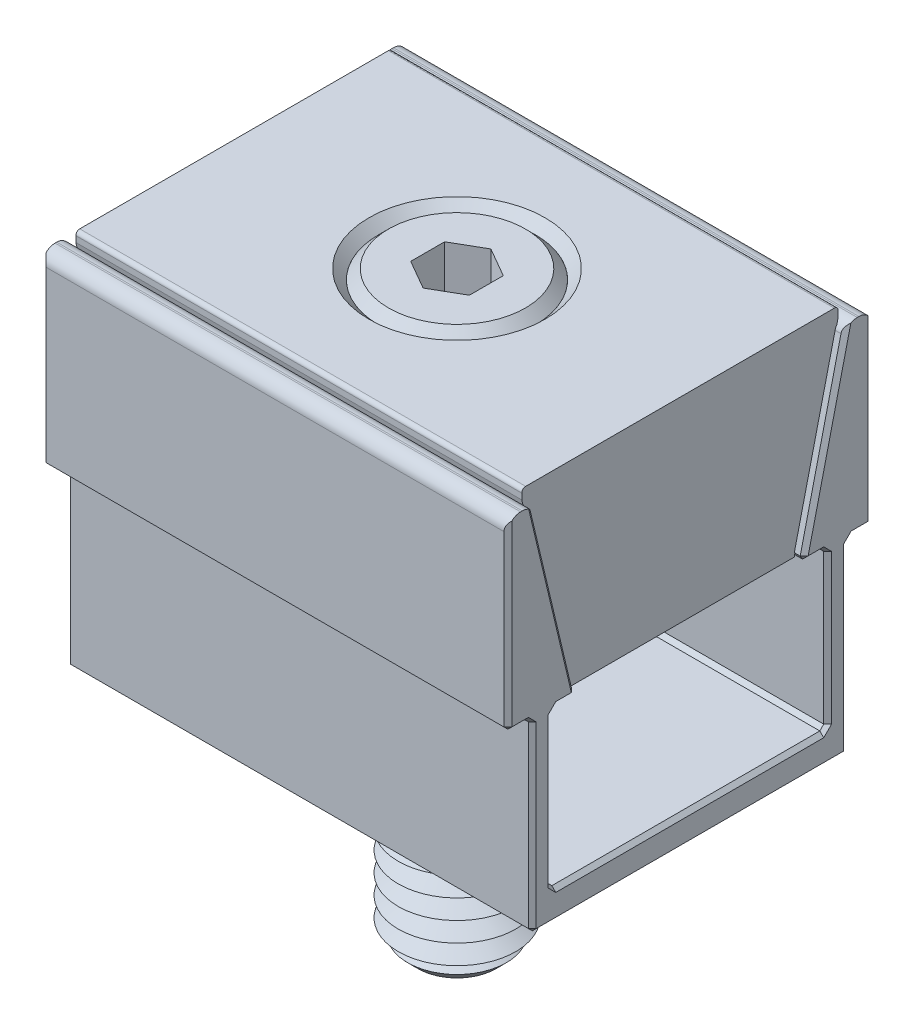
ISO-10303-21;
HEADER;
FILE_DESCRIPTION(('STEP AP214'),'2;1');
FILE_NAME('part.step','',(''),(''),'','','');
FILE_SCHEMA(('AUTOMOTIVE_DESIGN { 1 0 10303 214 1 1 1 1 }'));
ENDSEC;
DATA;
#1=APPLICATION_CONTEXT('core data for automotive mechanical design processes');
#2=APPLICATION_PROTOCOL_DEFINITION('international standard','automotive_design',2000,#1);
#3=PRODUCT_CONTEXT('',#1,'mechanical');
#4=PRODUCT('Part','Part','',(#3));
#5=PRODUCT_RELATED_PRODUCT_CATEGORY('part','',(#4));
#6=PRODUCT_DEFINITION_FORMATION('','',#4);
#7=PRODUCT_DEFINITION_CONTEXT('part definition',#1,'design');
#8=PRODUCT_DEFINITION('design','',#6,#7);
#9=PRODUCT_DEFINITION_SHAPE('','',#8);
#10=(LENGTH_UNIT() NAMED_UNIT(*) SI_UNIT(.MILLI.,.METRE.));
#11=(NAMED_UNIT(*) PLANE_ANGLE_UNIT() SI_UNIT($,.RADIAN.));
#12=(NAMED_UNIT(*) SI_UNIT($,.STERADIAN.) SOLID_ANGLE_UNIT());
#13=UNCERTAINTY_MEASURE_WITH_UNIT(LENGTH_MEASURE(1.E-05),#10,'distance_accuracy_value','');
#14=(GEOMETRIC_REPRESENTATION_CONTEXT(3) GLOBAL_UNCERTAINTY_ASSIGNED_CONTEXT((#13)) GLOBAL_UNIT_ASSIGNED_CONTEXT((#10,
#11,#12)) REPRESENTATION_CONTEXT('',''));
#15=CARTESIAN_POINT('',(0.,0.,0.));
#16=DIRECTION('',(0.,0.,1.));
#17=DIRECTION('',(1.,0.,0.));
#18=AXIS2_PLACEMENT_3D('',#15,#16,#17);
#19=CARTESIAN_POINT('',(0.,17.05,0.));
#20=DIRECTION('',(0.,1.,0.));
#21=DIRECTION('',(0.,0.,1.));
#22=AXIS2_PLACEMENT_3D('',#19,#20,#21);
#23=PLANE('',#22);
#24=CARTESIAN_POINT('',(0.,17.05,0.));
#25=DIRECTION('',(0.,1.,0.));
#26=DIRECTION('',(0.,0.,1.));
#27=AXIS2_PLACEMENT_3D('',#24,#25,#26);
#28=CIRCLE('',#27,1.5);
#29=CARTESIAN_POINT('',(0.75,17.05,1.29903810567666));
#30=VERTEX_POINT('',#29);
#31=CARTESIAN_POINT('',(1.5,17.05,0.));
#32=VERTEX_POINT('',#31);
#33=EDGE_CURVE('P0_E94',#30,#32,#28,.T.);
#34=ORIENTED_EDGE('',*,*,#33,.F.);
#35=DIRECTION('',(0.866025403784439,0.,-0.5));
#36=VECTOR('',#35,1.);
#37=CARTESIAN_POINT('',(0.,17.05,1.73205080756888));
#38=LINE('',#37,#36);
#39=CARTESIAN_POINT('',(1.5,17.05,0.866025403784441));
#40=VERTEX_POINT('',#39);
#41=EDGE_CURVE('P0_E117',#30,#40,#38,.T.);
#42=ORIENTED_EDGE('',*,*,#41,.T.);
#43=DIRECTION('',(0.,0.,-1.));
#44=VECTOR('',#43,1.);
#45=CARTESIAN_POINT('',(1.5,17.05,0.866025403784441));
#46=LINE('',#45,#44);
#47=EDGE_CURVE('P0_E113',#40,#32,#46,.T.);
#48=ORIENTED_EDGE('',*,*,#47,.T.);
#49=EDGE_LOOP('',(#34,#42,#48));
#50=FACE_BOUND('',#49,.T.);
#51=ADVANCED_FACE('P0_F16',(#50),#23,.T.);
#52=CARTESIAN_POINT('',(0.,17.05,0.));
#53=DIRECTION('',(0.,1.,0.));
#54=DIRECTION('',(0.,0.,1.));
#55=AXIS2_PLACEMENT_3D('',#52,#53,#54);
#56=CIRCLE('',#55,1.5);
#57=CARTESIAN_POINT('',(0.75,17.05,-1.29903810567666));
#58=VERTEX_POINT('',#57);
#59=EDGE_CURVE('P0_E11',#32,#58,#56,.T.);
#60=ORIENTED_EDGE('',*,*,#59,.F.);
#61=CARTESIAN_POINT('',(1.5,17.05,-0.866025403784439));
#62=VERTEX_POINT('',#61);
#63=EDGE_CURVE('P0_E105',#32,#62,#46,.T.);
#64=ORIENTED_EDGE('',*,*,#63,.T.);
#65=DIRECTION('',(-0.866025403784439,0.,-0.5));
#66=VECTOR('',#65,1.);
#67=CARTESIAN_POINT('',(1.5,17.05,-0.866025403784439));
#68=LINE('',#67,#66);
#69=EDGE_CURVE('P0_E108',#62,#58,#68,.T.);
#70=ORIENTED_EDGE('',*,*,#69,.T.);
#71=EDGE_LOOP('',(#60,#64,#70));
#72=FACE_BOUND('',#71,.T.);
#73=ADVANCED_FACE('P0_F104',(#72),#23,.T.);
#74=CARTESIAN_POINT('',(-0.75,17.05,-1.29903810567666));
#75=VERTEX_POINT('',#74);
#76=EDGE_CURVE('P0_E25',#58,#75,#56,.T.);
#77=ORIENTED_EDGE('',*,*,#76,.F.);
#78=CARTESIAN_POINT('',(0.,17.05,-1.73205080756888));
#79=VERTEX_POINT('',#78);
#80=EDGE_CURVE('P0_E140',#58,#79,#68,.T.);
#81=ORIENTED_EDGE('',*,*,#80,.T.);
#82=DIRECTION('',(-0.866025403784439,0.,0.5));
#83=VECTOR('',#82,1.);
#84=CARTESIAN_POINT('',(0.,17.05,-1.73205080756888));
#85=LINE('',#84,#83);
#86=EDGE_CURVE('P0_E330',#79,#75,#85,.T.);
#87=ORIENTED_EDGE('',*,*,#86,.T.);
#88=EDGE_LOOP('',(#77,#81,#87));
#89=FACE_BOUND('',#88,.T.);
#90=ADVANCED_FACE('P0_F332',(#89),#23,.T.);
#91=CARTESIAN_POINT('',(-1.5,17.05,0.));
#92=VERTEX_POINT('',#91);
#93=EDGE_CURVE('P0_E314',#75,#92,#56,.T.);
#94=ORIENTED_EDGE('',*,*,#93,.F.);
#95=CARTESIAN_POINT('',(-1.5,17.05,-0.866025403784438));
#96=VERTEX_POINT('',#95);
#97=EDGE_CURVE('P0_E323',#75,#96,#85,.T.);
#98=ORIENTED_EDGE('',*,*,#97,.T.);
#99=DIRECTION('',(0.,0.,1.));
#100=VECTOR('',#99,1.);
#101=CARTESIAN_POINT('',(-1.5,17.05,-0.866025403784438));
#102=LINE('',#101,#100);
#103=EDGE_CURVE('P0_E326',#96,#92,#102,.T.);
#104=ORIENTED_EDGE('',*,*,#103,.T.);
#105=EDGE_LOOP('',(#94,#98,#104));
#106=FACE_BOUND('',#105,.T.);
#107=ADVANCED_FACE('P0_F322',(#106),#23,.T.);
#108=CARTESIAN_POINT('',(-0.750000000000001,17.05,1.29903810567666));
#109=VERTEX_POINT('',#108);
#110=EDGE_CURVE('P0_E32',#92,#109,#56,.T.);
#111=ORIENTED_EDGE('',*,*,#110,.F.);
#112=CARTESIAN_POINT('',(-1.5,17.05,0.86602540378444));
#113=VERTEX_POINT('',#112);
#114=EDGE_CURVE('P0_E333',#92,#113,#102,.T.);
#115=ORIENTED_EDGE('',*,*,#114,.T.);
#116=DIRECTION('',(0.866025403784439,0.,0.5));
#117=VECTOR('',#116,1.);
#118=CARTESIAN_POINT('',(-1.5,17.05,0.86602540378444));
#119=LINE('',#118,#117);
#120=EDGE_CURVE('P0_E337',#113,#109,#119,.T.);
#121=ORIENTED_EDGE('',*,*,#120,.T.);
#122=EDGE_LOOP('',(#111,#115,#121));
#123=FACE_BOUND('',#122,.T.);
#124=ADVANCED_FACE('P0_F377',(#123),#23,.T.);
#125=CARTESIAN_POINT('',(0.,19.55,0.));
#126=DIRECTION('',(0.,1.,0.));
#127=DIRECTION('',(0.,0.,1.));
#128=AXIS2_PLACEMENT_3D('',#125,#126,#127);
#129=PLANE('',#128);
#130=DIRECTION('',(-0.866025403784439,0.,-0.5));
#131=VECTOR('',#130,1.);
#132=CARTESIAN_POINT('',(1.5,19.55,-0.866025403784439));
#133=LINE('',#132,#131);
#134=CARTESIAN_POINT('',(1.5,19.55,-0.866025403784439));
#135=VERTEX_POINT('',#134);
#136=CARTESIAN_POINT('',(0.,19.55,-1.73205080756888));
#137=VERTEX_POINT('',#136);
#138=EDGE_CURVE('P0_E40',#135,#137,#133,.T.);
#139=ORIENTED_EDGE('',*,*,#138,.F.);
#140=DIRECTION('',(0.,0.,-1.));
#141=VECTOR('',#140,1.);
#142=CARTESIAN_POINT('',(1.5,19.55,0.866025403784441));
#143=LINE('',#142,#141);
#144=CARTESIAN_POINT('',(1.5,19.55,0.866025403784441));
#145=VERTEX_POINT('',#144);
#146=EDGE_CURVE('P0_E138',#145,#135,#143,.T.);
#147=ORIENTED_EDGE('',*,*,#146,.F.);
#148=DIRECTION('',(0.866025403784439,0.,-0.5));
#149=VECTOR('',#148,1.);
#150=CARTESIAN_POINT('',(0.,19.55,1.73205080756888));
#151=LINE('',#150,#149);
#152=CARTESIAN_POINT('',(0.,19.55,1.73205080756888));
#153=VERTEX_POINT('',#152);
#154=EDGE_CURVE('P0_E135',#153,#145,#151,.T.);
#155=ORIENTED_EDGE('',*,*,#154,.F.);
#156=DIRECTION('',(0.866025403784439,0.,0.5));
#157=VECTOR('',#156,1.);
#158=CARTESIAN_POINT('',(-1.5,19.55,0.86602540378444));
#159=LINE('',#158,#157);
#160=CARTESIAN_POINT('',(-1.5,19.55,0.86602540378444));
#161=VERTEX_POINT('',#160);
#162=EDGE_CURVE('P0_E132',#161,#153,#159,.T.);
#163=ORIENTED_EDGE('',*,*,#162,.F.);
#164=DIRECTION('',(0.,0.,1.));
#165=VECTOR('',#164,1.);
#166=CARTESIAN_POINT('',(-1.5,19.55,-0.866025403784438));
#167=LINE('',#166,#165);
#168=CARTESIAN_POINT('',(-1.5,19.55,-0.866025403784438));
#169=VERTEX_POINT('',#168);
#170=EDGE_CURVE('P0_E129',#169,#161,#167,.T.);
#171=ORIENTED_EDGE('',*,*,#170,.F.);
#172=DIRECTION('',(-0.866025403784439,0.,0.5));
#173=VECTOR('',#172,1.);
#174=CARTESIAN_POINT('',(0.,19.55,-1.73205080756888));
#175=LINE('',#174,#173);
#176=EDGE_CURVE('P0_E126',#137,#169,#175,.T.);
#177=ORIENTED_EDGE('',*,*,#176,.F.);
#178=EDGE_LOOP('',(#139,#147,#155,#163,#171,#177));
#179=FACE_BOUND('',#178,.T.);
#180=CARTESIAN_POINT('',(0.,19.55,0.));
#181=DIRECTION('',(0.,1.,0.));
#182=DIRECTION('',(0.,0.,1.));
#183=AXIS2_PLACEMENT_3D('',#180,#181,#182);
#184=CIRCLE('',#183,3.49999999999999);
#185=CARTESIAN_POINT('',(0.,19.55,3.49999999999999));
#186=VERTEX_POINT('',#185);
#187=EDGE_CURVE('P0_E306',#186,#186,#184,.T.);
#188=ORIENTED_EDGE('',*,*,#187,.T.);
#189=EDGE_LOOP('',(#188));
#190=FACE_BOUND('',#189,.T.);
#191=ADVANCED_FACE('P0_F355',(#179,#190),#129,.T.);
#192=CARTESIAN_POINT('',(0.,79.7976336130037,0.));
#193=DIRECTION('',(0.,1.,0.));
#194=DIRECTION('',(0.,0.,1.));
#195=AXIS2_PLACEMENT_3D('',#192,#193,#194);
#196=CYLINDRICAL_SURFACE('',#195,4.);
#197=CARTESIAN_POINT('',(0.,19.05,0.));
#198=DIRECTION('',(0.,1.,0.));
#199=DIRECTION('',(0.,0.,1.));
#200=AXIS2_PLACEMENT_3D('',#197,#198,#199);
#201=CIRCLE('',#200,4.);
#202=CARTESIAN_POINT('',(0.,19.05,4.));
#203=VERTEX_POINT('',#202);
#204=EDGE_CURVE('P0_E310',#203,#203,#201,.F.);
#205=ORIENTED_EDGE('',*,*,#204,.T.);
#206=EDGE_LOOP('',(#205));
#207=FACE_BOUND('',#206,.T.);
#208=CARTESIAN_POINT('',(0.,14.8,0.));
#209=DIRECTION('',(0.,1.,0.));
#210=DIRECTION('',(0.,0.,1.));
#211=AXIS2_PLACEMENT_3D('',#208,#209,#210);
#212=CIRCLE('',#211,4.);
#213=CARTESIAN_POINT('',(0.,14.8,4.));
#214=VERTEX_POINT('',#213);
#215=EDGE_CURVE('P0_E300',#214,#214,#212,.T.);
#216=ORIENTED_EDGE('',*,*,#215,.T.);
#217=EDGE_LOOP('',(#216));
#218=FACE_BOUND('',#217,.T.);
#219=ADVANCED_FACE('P0_F387',(#207,#218),#196,.T.);
#220=CARTESIAN_POINT('',(0.,14.8,4.));
#221=DIRECTION('',(0.,-1.,0.));
#222=DIRECTION('',(0.,0.,-1.));
#223=AXIS2_PLACEMENT_3D('',#220,#221,#222);
#224=PLANE('',#223);
#225=CARTESIAN_POINT('',(0.,14.8,0.));
#226=DIRECTION('',(0.,1.,0.));
#227=DIRECTION('',(0.,0.,1.));
#228=AXIS2_PLACEMENT_3D('',#225,#226,#227);
#229=CIRCLE('',#228,3.);
#230=CARTESIAN_POINT('',(0.,14.8,3.));
#231=VERTEX_POINT('',#230);
#232=EDGE_CURVE('P0_E297',#231,#231,#229,.T.);
#233=ORIENTED_EDGE('',*,*,#232,.T.);
#234=EDGE_LOOP('',(#233));
#235=FACE_BOUND('',#234,.T.);
#236=ORIENTED_EDGE('',*,*,#215,.F.);
#237=EDGE_LOOP('',(#236));
#238=FACE_BOUND('',#237,.T.);
#239=ADVANCED_FACE('P0_F917',(#235,#238),#224,.T.);
#240=CARTESIAN_POINT('',(0.,14.3,0.));
#241=DIRECTION('',(0.,1.,0.));
#242=DIRECTION('',(0.,0.,1.));
#243=AXIS2_PLACEMENT_3D('',#240,#241,#242);
#244=CONICAL_SURFACE('',#243,2.13397459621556,1.0471975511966);
#245=ORIENTED_EDGE('',*,*,#232,.F.);
#246=EDGE_LOOP('',(#245));
#247=FACE_BOUND('',#246,.T.);
#248=CARTESIAN_POINT('',(0.,14.3,0.));
#249=DIRECTION('',(0.,1.,0.));
#250=DIRECTION('',(0.,0.,1.));
#251=AXIS2_PLACEMENT_3D('',#248,#249,#250);
#252=CIRCLE('',#251,2.13397459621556);
#253=CARTESIAN_POINT('',(0.,14.3,2.13397459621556));
#254=VERTEX_POINT('',#253);
#255=EDGE_CURVE('P0_E294',#254,#254,#252,.T.);
#256=ORIENTED_EDGE('',*,*,#255,.T.);
#257=EDGE_LOOP('',(#256));
#258=FACE_BOUND('',#257,.T.);
#259=ADVANCED_FACE('P0_F908',(#247,#258),#244,.T.);
#260=CARTESIAN_POINT('',(0.,13.8,0.));
#261=DIRECTION('',(0.,-1.,0.));
#262=DIRECTION('',(0.,0.,-1.));
#263=AXIS2_PLACEMENT_3D('',#260,#261,#262);
#264=CONICAL_SURFACE('',#263,3.,1.0471975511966);
#265=ORIENTED_EDGE('',*,*,#255,.F.);
#266=EDGE_LOOP('',(#265));
#267=FACE_BOUND('',#266,.T.);
#268=CARTESIAN_POINT('',(0.,13.8,0.));
#269=DIRECTION('',(0.,1.,0.));
#270=DIRECTION('',(0.,0.,1.));
#271=AXIS2_PLACEMENT_3D('',#268,#269,#270);
#272=CIRCLE('',#271,3.);
#273=CARTESIAN_POINT('',(0.,13.8,3.));
#274=VERTEX_POINT('',#273);
#275=EDGE_CURVE('P0_E291',#274,#274,#272,.T.);
#276=ORIENTED_EDGE('',*,*,#275,.T.);
#277=EDGE_LOOP('',(#276));
#278=FACE_BOUND('',#277,.T.);
#279=ADVANCED_FACE('P0_F899',(#267,#278),#264,.T.);
#280=CARTESIAN_POINT('',(0.,13.3,0.));
#281=DIRECTION('',(0.,1.,0.));
#282=DIRECTION('',(0.,0.,1.));
#283=AXIS2_PLACEMENT_3D('',#280,#281,#282);
#284=CONICAL_SURFACE('',#283,2.13397459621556,1.0471975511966);
#285=ORIENTED_EDGE('',*,*,#275,.F.);
#286=EDGE_LOOP('',(#285));
#287=FACE_BOUND('',#286,.T.);
#288=CARTESIAN_POINT('',(0.,13.3,0.));
#289=DIRECTION('',(0.,1.,0.));
#290=DIRECTION('',(0.,0.,1.));
#291=AXIS2_PLACEMENT_3D('',#288,#289,#290);
#292=CIRCLE('',#291,2.13397459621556);
#293=CARTESIAN_POINT('',(0.,13.3,2.13397459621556));
#294=VERTEX_POINT('',#293);
#295=EDGE_CURVE('P0_E288',#294,#294,#292,.T.);
#296=ORIENTED_EDGE('',*,*,#295,.T.);
#297=EDGE_LOOP('',(#296));
#298=FACE_BOUND('',#297,.T.);
#299=ADVANCED_FACE('P0_F890',(#287,#298),#284,.T.);
#300=CARTESIAN_POINT('',(0.,12.8,0.));
#301=DIRECTION('',(0.,-1.,0.));
#302=DIRECTION('',(0.,0.,-1.));
#303=AXIS2_PLACEMENT_3D('',#300,#301,#302);
#304=CONICAL_SURFACE('',#303,3.,1.0471975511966);
#305=ORIENTED_EDGE('',*,*,#295,.F.);
#306=EDGE_LOOP('',(#305));
#307=FACE_BOUND('',#306,.T.);
#308=CARTESIAN_POINT('',(0.,12.8,0.));
#309=DIRECTION('',(0.,1.,0.));
#310=DIRECTION('',(0.,0.,1.));
#311=AXIS2_PLACEMENT_3D('',#308,#309,#310);
#312=CIRCLE('',#311,3.);
#313=CARTESIAN_POINT('',(0.,12.8,3.));
#314=VERTEX_POINT('',#313);
#315=EDGE_CURVE('P0_E285',#314,#314,#312,.T.);
#316=ORIENTED_EDGE('',*,*,#315,.T.);
#317=EDGE_LOOP('',(#316));
#318=FACE_BOUND('',#317,.T.);
#319=ADVANCED_FACE('P0_F881',(#307,#318),#304,.T.);
#320=CARTESIAN_POINT('',(0.,12.3,0.));
#321=DIRECTION('',(0.,1.,0.));
#322=DIRECTION('',(0.,0.,1.));
#323=AXIS2_PLACEMENT_3D('',#320,#321,#322);
#324=CONICAL_SURFACE('',#323,2.13397459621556,1.0471975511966);
#325=ORIENTED_EDGE('',*,*,#315,.F.);
#326=EDGE_LOOP('',(#325));
#327=FACE_BOUND('',#326,.T.);
#328=CARTESIAN_POINT('',(0.,12.3,0.));
#329=DIRECTION('',(0.,1.,0.));
#330=DIRECTION('',(0.,0.,1.));
#331=AXIS2_PLACEMENT_3D('',#328,#329,#330);
#332=CIRCLE('',#331,2.13397459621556);
#333=CARTESIAN_POINT('',(0.,12.3,2.13397459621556));
#334=VERTEX_POINT('',#333);
#335=EDGE_CURVE('P0_E282',#334,#334,#332,.T.);
#336=ORIENTED_EDGE('',*,*,#335,.T.);
#337=EDGE_LOOP('',(#336));
#338=FACE_BOUND('',#337,.T.);
#339=ADVANCED_FACE('P0_F872',(#327,#338),#324,.T.);
#340=CARTESIAN_POINT('',(0.,11.8,0.));
#341=DIRECTION('',(0.,-1.,0.));
#342=DIRECTION('',(0.,0.,-1.));
#343=AXIS2_PLACEMENT_3D('',#340,#341,#342);
#344=CONICAL_SURFACE('',#343,3.,1.0471975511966);
#345=ORIENTED_EDGE('',*,*,#335,.F.);
#346=EDGE_LOOP('',(#345));
#347=FACE_BOUND('',#346,.T.);
#348=CARTESIAN_POINT('',(0.,11.8,0.));
#349=DIRECTION('',(0.,1.,0.));
#350=DIRECTION('',(0.,0.,1.));
#351=AXIS2_PLACEMENT_3D('',#348,#349,#350);
#352=CIRCLE('',#351,3.);
#353=CARTESIAN_POINT('',(0.,11.8,3.));
#354=VERTEX_POINT('',#353);
#355=EDGE_CURVE('P0_E279',#354,#354,#352,.T.);
#356=ORIENTED_EDGE('',*,*,#355,.T.);
#357=EDGE_LOOP('',(#356));
#358=FACE_BOUND('',#357,.T.);
#359=ADVANCED_FACE('P0_F863',(#347,#358),#344,.T.);
#360=CARTESIAN_POINT('',(0.,11.3,0.));
#361=DIRECTION('',(0.,1.,0.));
#362=DIRECTION('',(0.,0.,1.));
#363=AXIS2_PLACEMENT_3D('',#360,#361,#362);
#364=CONICAL_SURFACE('',#363,2.13397459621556,1.0471975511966);
#365=ORIENTED_EDGE('',*,*,#355,.F.);
#366=EDGE_LOOP('',(#365));
#367=FACE_BOUND('',#366,.T.);
#368=CARTESIAN_POINT('',(0.,11.3,0.));
#369=DIRECTION('',(0.,1.,0.));
#370=DIRECTION('',(0.,0.,1.));
#371=AXIS2_PLACEMENT_3D('',#368,#369,#370);
#372=CIRCLE('',#371,2.13397459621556);
#373=CARTESIAN_POINT('',(0.,11.3,2.13397459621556));
#374=VERTEX_POINT('',#373);
#375=EDGE_CURVE('P0_E276',#374,#374,#372,.T.);
#376=ORIENTED_EDGE('',*,*,#375,.T.);
#377=EDGE_LOOP('',(#376));
#378=FACE_BOUND('',#377,.T.);
#379=ADVANCED_FACE('P0_F854',(#367,#378),#364,.T.);
#380=CARTESIAN_POINT('',(0.,10.8,0.));
#381=DIRECTION('',(0.,-1.,0.));
#382=DIRECTION('',(0.,0.,-1.));
#383=AXIS2_PLACEMENT_3D('',#380,#381,#382);
#384=CONICAL_SURFACE('',#383,3.,1.0471975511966);
#385=ORIENTED_EDGE('',*,*,#375,.F.);
#386=EDGE_LOOP('',(#385));
#387=FACE_BOUND('',#386,.T.);
#388=CARTESIAN_POINT('',(0.,10.8,0.));
#389=DIRECTION('',(0.,1.,0.));
#390=DIRECTION('',(0.,0.,1.));
#391=AXIS2_PLACEMENT_3D('',#388,#389,#390);
#392=CIRCLE('',#391,3.);
#393=CARTESIAN_POINT('',(0.,10.8,3.));
#394=VERTEX_POINT('',#393);
#395=EDGE_CURVE('P0_E273',#394,#394,#392,.T.);
#396=ORIENTED_EDGE('',*,*,#395,.T.);
#397=EDGE_LOOP('',(#396));
#398=FACE_BOUND('',#397,.T.);
#399=ADVANCED_FACE('P0_F845',(#387,#398),#384,.T.);
#400=CARTESIAN_POINT('',(0.,10.3,0.));
#401=DIRECTION('',(0.,1.,0.));
#402=DIRECTION('',(0.,0.,1.));
#403=AXIS2_PLACEMENT_3D('',#400,#401,#402);
#404=CONICAL_SURFACE('',#403,2.13397459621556,1.0471975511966);
#405=ORIENTED_EDGE('',*,*,#395,.F.);
#406=EDGE_LOOP('',(#405));
#407=FACE_BOUND('',#406,.T.);
#408=CARTESIAN_POINT('',(0.,10.3,0.));
#409=DIRECTION('',(0.,1.,0.));
#410=DIRECTION('',(0.,0.,1.));
#411=AXIS2_PLACEMENT_3D('',#408,#409,#410);
#412=CIRCLE('',#411,2.13397459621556);
#413=CARTESIAN_POINT('',(0.,10.3,2.13397459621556));
#414=VERTEX_POINT('',#413);
#415=EDGE_CURVE('P0_E270',#414,#414,#412,.T.);
#416=ORIENTED_EDGE('',*,*,#415,.T.);
#417=EDGE_LOOP('',(#416));
#418=FACE_BOUND('',#417,.T.);
#419=ADVANCED_FACE('P0_F836',(#407,#418),#404,.T.);
#420=CARTESIAN_POINT('',(0.,9.79999999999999,0.));
#421=DIRECTION('',(0.,-1.,0.));
#422=DIRECTION('',(0.,0.,-1.));
#423=AXIS2_PLACEMENT_3D('',#420,#421,#422);
#424=CONICAL_SURFACE('',#423,3.,1.0471975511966);
#425=ORIENTED_EDGE('',*,*,#415,.F.);
#426=EDGE_LOOP('',(#425));
#427=FACE_BOUND('',#426,.T.);
#428=CARTESIAN_POINT('',(0.,9.79999999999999,0.));
#429=DIRECTION('',(0.,1.,0.));
#430=DIRECTION('',(0.,0.,1.));
#431=AXIS2_PLACEMENT_3D('',#428,#429,#430);
#432=CIRCLE('',#431,3.);
#433=CARTESIAN_POINT('',(0.,9.79999999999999,3.));
#434=VERTEX_POINT('',#433);
#435=EDGE_CURVE('P0_E267',#434,#434,#432,.T.);
#436=ORIENTED_EDGE('',*,*,#435,.T.);
#437=EDGE_LOOP('',(#436));
#438=FACE_BOUND('',#437,.T.);
#439=ADVANCED_FACE('P0_F827',(#427,#438),#424,.T.);
#440=CARTESIAN_POINT('',(0.,9.29999999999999,0.));
#441=DIRECTION('',(0.,1.,0.));
#442=DIRECTION('',(0.,0.,1.));
#443=AXIS2_PLACEMENT_3D('',#440,#441,#442);
#444=CONICAL_SURFACE('',#443,2.13397459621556,1.0471975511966);
#445=ORIENTED_EDGE('',*,*,#435,.F.);
#446=EDGE_LOOP('',(#445));
#447=FACE_BOUND('',#446,.T.);
#448=CARTESIAN_POINT('',(0.,9.29999999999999,0.));
#449=DIRECTION('',(0.,1.,0.));
#450=DIRECTION('',(0.,0.,1.));
#451=AXIS2_PLACEMENT_3D('',#448,#449,#450);
#452=CIRCLE('',#451,2.13397459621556);
#453=CARTESIAN_POINT('',(0.,9.29999999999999,2.13397459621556));
#454=VERTEX_POINT('',#453);
#455=EDGE_CURVE('P0_E264',#454,#454,#452,.T.);
#456=ORIENTED_EDGE('',*,*,#455,.T.);
#457=EDGE_LOOP('',(#456));
#458=FACE_BOUND('',#457,.T.);
#459=ADVANCED_FACE('P0_F818',(#447,#458),#444,.T.);
#460=CARTESIAN_POINT('',(0.,8.79999999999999,0.));
#461=DIRECTION('',(0.,-1.,0.));
#462=DIRECTION('',(0.,0.,-1.));
#463=AXIS2_PLACEMENT_3D('',#460,#461,#462);
#464=CONICAL_SURFACE('',#463,3.,1.0471975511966);
#465=ORIENTED_EDGE('',*,*,#455,.F.);
#466=EDGE_LOOP('',(#465));
#467=FACE_BOUND('',#466,.T.);
#468=CARTESIAN_POINT('',(0.,8.79999999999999,0.));
#469=DIRECTION('',(0.,1.,0.));
#470=DIRECTION('',(0.,0.,1.));
#471=AXIS2_PLACEMENT_3D('',#468,#469,#470);
#472=CIRCLE('',#471,3.);
#473=CARTESIAN_POINT('',(0.,8.79999999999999,3.));
#474=VERTEX_POINT('',#473);
#475=EDGE_CURVE('P0_E261',#474,#474,#472,.T.);
#476=ORIENTED_EDGE('',*,*,#475,.T.);
#477=EDGE_LOOP('',(#476));
#478=FACE_BOUND('',#477,.T.);
#479=ADVANCED_FACE('P0_F809',(#467,#478),#464,.T.);
#480=CARTESIAN_POINT('',(0.,8.29999999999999,0.));
#481=DIRECTION('',(0.,1.,0.));
#482=DIRECTION('',(0.,0.,1.));
#483=AXIS2_PLACEMENT_3D('',#480,#481,#482);
#484=CONICAL_SURFACE('',#483,2.13397459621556,1.0471975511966);
#485=ORIENTED_EDGE('',*,*,#475,.F.);
#486=EDGE_LOOP('',(#485));
#487=FACE_BOUND('',#486,.T.);
#488=CARTESIAN_POINT('',(0.,8.29999999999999,0.));
#489=DIRECTION('',(0.,1.,0.));
#490=DIRECTION('',(0.,0.,1.));
#491=AXIS2_PLACEMENT_3D('',#488,#489,#490);
#492=CIRCLE('',#491,2.13397459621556);
#493=CARTESIAN_POINT('',(0.,8.29999999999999,2.13397459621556));
#494=VERTEX_POINT('',#493);
#495=EDGE_CURVE('P0_E258',#494,#494,#492,.T.);
#496=ORIENTED_EDGE('',*,*,#495,.T.);
#497=EDGE_LOOP('',(#496));
#498=FACE_BOUND('',#497,.T.);
#499=ADVANCED_FACE('P0_F800',(#487,#498),#484,.T.);
#500=CARTESIAN_POINT('',(0.,7.79999999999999,0.));
#501=DIRECTION('',(0.,-1.,0.));
#502=DIRECTION('',(0.,0.,-1.));
#503=AXIS2_PLACEMENT_3D('',#500,#501,#502);
#504=CONICAL_SURFACE('',#503,3.,1.0471975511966);
#505=ORIENTED_EDGE('',*,*,#495,.F.);
#506=EDGE_LOOP('',(#505));
#507=FACE_BOUND('',#506,.T.);
#508=CARTESIAN_POINT('',(0.,7.79999999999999,0.));
#509=DIRECTION('',(0.,1.,0.));
#510=DIRECTION('',(0.,0.,1.));
#511=AXIS2_PLACEMENT_3D('',#508,#509,#510);
#512=CIRCLE('',#511,3.);
#513=CARTESIAN_POINT('',(0.,7.79999999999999,3.));
#514=VERTEX_POINT('',#513);
#515=EDGE_CURVE('P0_E255',#514,#514,#512,.T.);
#516=ORIENTED_EDGE('',*,*,#515,.T.);
#517=EDGE_LOOP('',(#516));
#518=FACE_BOUND('',#517,.T.);
#519=ADVANCED_FACE('P0_F791',(#507,#518),#504,.T.);
#520=CARTESIAN_POINT('',(0.,7.29999999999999,0.));
#521=DIRECTION('',(0.,1.,0.));
#522=DIRECTION('',(0.,0.,1.));
#523=AXIS2_PLACEMENT_3D('',#520,#521,#522);
#524=CONICAL_SURFACE('',#523,2.13397459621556,1.0471975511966);
#525=ORIENTED_EDGE('',*,*,#515,.F.);
#526=EDGE_LOOP('',(#525));
#527=FACE_BOUND('',#526,.T.);
#528=CARTESIAN_POINT('',(0.,7.29999999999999,0.));
#529=DIRECTION('',(0.,1.,0.));
#530=DIRECTION('',(0.,0.,1.));
#531=AXIS2_PLACEMENT_3D('',#528,#529,#530);
#532=CIRCLE('',#531,2.13397459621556);
#533=CARTESIAN_POINT('',(0.,7.29999999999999,2.13397459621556));
#534=VERTEX_POINT('',#533);
#535=EDGE_CURVE('P0_E252',#534,#534,#532,.T.);
#536=ORIENTED_EDGE('',*,*,#535,.T.);
#537=EDGE_LOOP('',(#536));
#538=FACE_BOUND('',#537,.T.);
#539=ADVANCED_FACE('P0_F782',(#527,#538),#524,.T.);
#540=CARTESIAN_POINT('',(0.,6.79999999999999,0.));
#541=DIRECTION('',(0.,-1.,0.));
#542=DIRECTION('',(0.,0.,-1.));
#543=AXIS2_PLACEMENT_3D('',#540,#541,#542);
#544=CONICAL_SURFACE('',#543,3.,1.0471975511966);
#545=ORIENTED_EDGE('',*,*,#535,.F.);
#546=EDGE_LOOP('',(#545));
#547=FACE_BOUND('',#546,.T.);
#548=CARTESIAN_POINT('',(0.,6.79999999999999,0.));
#549=DIRECTION('',(0.,1.,0.));
#550=DIRECTION('',(0.,0.,1.));
#551=AXIS2_PLACEMENT_3D('',#548,#549,#550);
#552=CIRCLE('',#551,3.);
#553=CARTESIAN_POINT('',(0.,6.79999999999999,3.));
#554=VERTEX_POINT('',#553);
#555=EDGE_CURVE('P0_E249',#554,#554,#552,.T.);
#556=ORIENTED_EDGE('',*,*,#555,.T.);
#557=EDGE_LOOP('',(#556));
#558=FACE_BOUND('',#557,.T.);
#559=ADVANCED_FACE('P0_F773',(#547,#558),#544,.T.);
#560=CARTESIAN_POINT('',(0.,6.29999999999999,0.));
#561=DIRECTION('',(0.,1.,0.));
#562=DIRECTION('',(0.,0.,1.));
#563=AXIS2_PLACEMENT_3D('',#560,#561,#562);
#564=CONICAL_SURFACE('',#563,2.13397459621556,1.0471975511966);
#565=ORIENTED_EDGE('',*,*,#555,.F.);
#566=EDGE_LOOP('',(#565));
#567=FACE_BOUND('',#566,.T.);
#568=CARTESIAN_POINT('',(0.,6.29999999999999,0.));
#569=DIRECTION('',(0.,1.,0.));
#570=DIRECTION('',(0.,0.,1.));
#571=AXIS2_PLACEMENT_3D('',#568,#569,#570);
#572=CIRCLE('',#571,2.13397459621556);
#573=CARTESIAN_POINT('',(0.,6.29999999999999,2.13397459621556));
#574=VERTEX_POINT('',#573);
#575=EDGE_CURVE('P0_E246',#574,#574,#572,.T.);
#576=ORIENTED_EDGE('',*,*,#575,.T.);
#577=EDGE_LOOP('',(#576));
#578=FACE_BOUND('',#577,.T.);
#579=ADVANCED_FACE('P0_F764',(#567,#578),#564,.T.);
#580=CARTESIAN_POINT('',(0.,5.79999999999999,0.));
#581=DIRECTION('',(0.,-1.,0.));
#582=DIRECTION('',(0.,0.,-1.));
#583=AXIS2_PLACEMENT_3D('',#580,#581,#582);
#584=CONICAL_SURFACE('',#583,3.,1.0471975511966);
#585=ORIENTED_EDGE('',*,*,#575,.F.);
#586=EDGE_LOOP('',(#585));
#587=FACE_BOUND('',#586,.T.);
#588=CARTESIAN_POINT('',(0.,5.79999999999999,0.));
#589=DIRECTION('',(0.,1.,0.));
#590=DIRECTION('',(0.,0.,1.));
#591=AXIS2_PLACEMENT_3D('',#588,#589,#590);
#592=CIRCLE('',#591,3.);
#593=CARTESIAN_POINT('',(0.,5.79999999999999,3.));
#594=VERTEX_POINT('',#593);
#595=EDGE_CURVE('P0_E243',#594,#594,#592,.T.);
#596=ORIENTED_EDGE('',*,*,#595,.T.);
#597=EDGE_LOOP('',(#596));
#598=FACE_BOUND('',#597,.T.);
#599=ADVANCED_FACE('P0_F755',(#587,#598),#584,.T.);
#600=CARTESIAN_POINT('',(0.,5.29999999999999,0.));
#601=DIRECTION('',(0.,1.,0.));
#602=DIRECTION('',(0.,0.,1.));
#603=AXIS2_PLACEMENT_3D('',#600,#601,#602);
#604=CONICAL_SURFACE('',#603,2.13397459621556,1.0471975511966);
#605=ORIENTED_EDGE('',*,*,#595,.F.);
#606=EDGE_LOOP('',(#605));
#607=FACE_BOUND('',#606,.T.);
#608=CARTESIAN_POINT('',(0.,5.29999999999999,0.));
#609=DIRECTION('',(0.,1.,0.));
#610=DIRECTION('',(0.,0.,1.));
#611=AXIS2_PLACEMENT_3D('',#608,#609,#610);
#612=CIRCLE('',#611,2.13397459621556);
#613=CARTESIAN_POINT('',(0.,5.29999999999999,2.13397459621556));
#614=VERTEX_POINT('',#613);
#615=EDGE_CURVE('P0_E240',#614,#614,#612,.T.);
#616=ORIENTED_EDGE('',*,*,#615,.T.);
#617=EDGE_LOOP('',(#616));
#618=FACE_BOUND('',#617,.T.);
#619=ADVANCED_FACE('P0_F746',(#607,#618),#604,.T.);
#620=CARTESIAN_POINT('',(0.,4.79999999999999,0.));
#621=DIRECTION('',(0.,-1.,0.));
#622=DIRECTION('',(0.,0.,-1.));
#623=AXIS2_PLACEMENT_3D('',#620,#621,#622);
#624=CONICAL_SURFACE('',#623,3.,1.0471975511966);
#625=ORIENTED_EDGE('',*,*,#615,.F.);
#626=EDGE_LOOP('',(#625));
#627=FACE_BOUND('',#626,.T.);
#628=CARTESIAN_POINT('',(0.,4.79999999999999,0.));
#629=DIRECTION('',(0.,1.,0.));
#630=DIRECTION('',(0.,0.,1.));
#631=AXIS2_PLACEMENT_3D('',#628,#629,#630);
#632=CIRCLE('',#631,3.);
#633=CARTESIAN_POINT('',(0.,4.79999999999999,3.));
#634=VERTEX_POINT('',#633);
#635=EDGE_CURVE('P0_E237',#634,#634,#632,.T.);
#636=ORIENTED_EDGE('',*,*,#635,.T.);
#637=EDGE_LOOP('',(#636));
#638=FACE_BOUND('',#637,.T.);
#639=ADVANCED_FACE('P0_F737',(#627,#638),#624,.T.);
#640=CARTESIAN_POINT('',(0.,4.29999999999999,0.));
#641=DIRECTION('',(0.,1.,0.));
#642=DIRECTION('',(0.,0.,1.));
#643=AXIS2_PLACEMENT_3D('',#640,#641,#642);
#644=CONICAL_SURFACE('',#643,2.13397459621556,1.0471975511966);
#645=ORIENTED_EDGE('',*,*,#635,.F.);
#646=EDGE_LOOP('',(#645));
#647=FACE_BOUND('',#646,.T.);
#648=CARTESIAN_POINT('',(0.,4.29999999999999,0.));
#649=DIRECTION('',(0.,1.,0.));
#650=DIRECTION('',(0.,0.,1.));
#651=AXIS2_PLACEMENT_3D('',#648,#649,#650);
#652=CIRCLE('',#651,2.13397459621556);
#653=CARTESIAN_POINT('',(0.,4.29999999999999,2.13397459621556));
#654=VERTEX_POINT('',#653);
#655=EDGE_CURVE('P0_E234',#654,#654,#652,.T.);
#656=ORIENTED_EDGE('',*,*,#655,.T.);
#657=EDGE_LOOP('',(#656));
#658=FACE_BOUND('',#657,.T.);
#659=ADVANCED_FACE('P0_F728',(#647,#658),#644,.T.);
#660=CARTESIAN_POINT('',(0.,3.79999999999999,0.));
#661=DIRECTION('',(0.,-1.,0.));
#662=DIRECTION('',(0.,0.,-1.));
#663=AXIS2_PLACEMENT_3D('',#660,#661,#662);
#664=CONICAL_SURFACE('',#663,3.,1.0471975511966);
#665=ORIENTED_EDGE('',*,*,#655,.F.);
#666=EDGE_LOOP('',(#665));
#667=FACE_BOUND('',#666,.T.);
#668=CARTESIAN_POINT('',(0.,3.79999999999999,0.));
#669=DIRECTION('',(0.,1.,0.));
#670=DIRECTION('',(0.,0.,1.));
#671=AXIS2_PLACEMENT_3D('',#668,#669,#670);
#672=CIRCLE('',#671,3.);
#673=CARTESIAN_POINT('',(0.,3.79999999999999,3.));
#674=VERTEX_POINT('',#673);
#675=EDGE_CURVE('P0_E231',#674,#674,#672,.T.);
#676=ORIENTED_EDGE('',*,*,#675,.T.);
#677=EDGE_LOOP('',(#676));
#678=FACE_BOUND('',#677,.T.);
#679=ADVANCED_FACE('P0_F719',(#667,#678),#664,.T.);
#680=CARTESIAN_POINT('',(0.,3.29999999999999,0.));
#681=DIRECTION('',(0.,1.,0.));
#682=DIRECTION('',(0.,0.,1.));
#683=AXIS2_PLACEMENT_3D('',#680,#681,#682);
#684=CONICAL_SURFACE('',#683,2.13397459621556,1.0471975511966);
#685=ORIENTED_EDGE('',*,*,#675,.F.);
#686=EDGE_LOOP('',(#685));
#687=FACE_BOUND('',#686,.T.);
#688=CARTESIAN_POINT('',(0.,3.29999999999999,0.));
#689=DIRECTION('',(0.,1.,0.));
#690=DIRECTION('',(0.,0.,1.));
#691=AXIS2_PLACEMENT_3D('',#688,#689,#690);
#692=CIRCLE('',#691,2.13397459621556);
#693=CARTESIAN_POINT('',(0.,3.29999999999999,2.13397459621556));
#694=VERTEX_POINT('',#693);
#695=EDGE_CURVE('P0_E228',#694,#694,#692,.T.);
#696=ORIENTED_EDGE('',*,*,#695,.T.);
#697=EDGE_LOOP('',(#696));
#698=FACE_BOUND('',#697,.T.);
#699=ADVANCED_FACE('P0_F710',(#687,#698),#684,.T.);
#700=CARTESIAN_POINT('',(0.,2.79999999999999,0.));
#701=DIRECTION('',(0.,-1.,0.));
#702=DIRECTION('',(0.,0.,-1.));
#703=AXIS2_PLACEMENT_3D('',#700,#701,#702);
#704=CONICAL_SURFACE('',#703,3.,1.0471975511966);
#705=ORIENTED_EDGE('',*,*,#695,.F.);
#706=EDGE_LOOP('',(#705));
#707=FACE_BOUND('',#706,.T.);
#708=CARTESIAN_POINT('',(0.,2.79999999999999,0.));
#709=DIRECTION('',(0.,1.,0.));
#710=DIRECTION('',(0.,0.,1.));
#711=AXIS2_PLACEMENT_3D('',#708,#709,#710);
#712=CIRCLE('',#711,3.);
#713=CARTESIAN_POINT('',(0.,2.79999999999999,3.));
#714=VERTEX_POINT('',#713);
#715=EDGE_CURVE('P0_E225',#714,#714,#712,.T.);
#716=ORIENTED_EDGE('',*,*,#715,.T.);
#717=EDGE_LOOP('',(#716));
#718=FACE_BOUND('',#717,.T.);
#719=ADVANCED_FACE('P0_F701',(#707,#718),#704,.T.);
#720=CARTESIAN_POINT('',(0.,2.29999999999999,0.));
#721=DIRECTION('',(0.,1.,0.));
#722=DIRECTION('',(0.,0.,1.));
#723=AXIS2_PLACEMENT_3D('',#720,#721,#722);
#724=CONICAL_SURFACE('',#723,2.13397459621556,1.0471975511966);
#725=ORIENTED_EDGE('',*,*,#715,.F.);
#726=EDGE_LOOP('',(#725));
#727=FACE_BOUND('',#726,.T.);
#728=CARTESIAN_POINT('',(0.,2.29999999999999,0.));
#729=DIRECTION('',(0.,1.,0.));
#730=DIRECTION('',(0.,0.,1.));
#731=AXIS2_PLACEMENT_3D('',#728,#729,#730);
#732=CIRCLE('',#731,2.13397459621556);
#733=CARTESIAN_POINT('',(0.,2.29999999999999,2.13397459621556));
#734=VERTEX_POINT('',#733);
#735=EDGE_CURVE('P0_E222',#734,#734,#732,.T.);
#736=ORIENTED_EDGE('',*,*,#735,.T.);
#737=EDGE_LOOP('',(#736));
#738=FACE_BOUND('',#737,.T.);
#739=ADVANCED_FACE('P0_F692',(#727,#738),#724,.T.);
#740=CARTESIAN_POINT('',(0.,1.79999999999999,0.));
#741=DIRECTION('',(0.,-1.,0.));
#742=DIRECTION('',(0.,0.,-1.));
#743=AXIS2_PLACEMENT_3D('',#740,#741,#742);
#744=CONICAL_SURFACE('',#743,3.,1.0471975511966);
#745=ORIENTED_EDGE('',*,*,#735,.F.);
#746=EDGE_LOOP('',(#745));
#747=FACE_BOUND('',#746,.T.);
#748=CARTESIAN_POINT('',(0.,1.79999999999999,0.));
#749=DIRECTION('',(0.,1.,0.));
#750=DIRECTION('',(0.,0.,1.));
#751=AXIS2_PLACEMENT_3D('',#748,#749,#750);
#752=CIRCLE('',#751,3.);
#753=CARTESIAN_POINT('',(0.,1.79999999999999,3.));
#754=VERTEX_POINT('',#753);
#755=EDGE_CURVE('P0_E219',#754,#754,#752,.T.);
#756=ORIENTED_EDGE('',*,*,#755,.T.);
#757=EDGE_LOOP('',(#756));
#758=FACE_BOUND('',#757,.T.);
#759=ADVANCED_FACE('P0_F683',(#747,#758),#744,.T.);
#760=CARTESIAN_POINT('',(0.,1.29999999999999,0.));
#761=DIRECTION('',(0.,1.,0.));
#762=DIRECTION('',(0.,0.,1.));
#763=AXIS2_PLACEMENT_3D('',#760,#761,#762);
#764=CONICAL_SURFACE('',#763,2.13397459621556,1.0471975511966);
#765=ORIENTED_EDGE('',*,*,#755,.F.);
#766=EDGE_LOOP('',(#765));
#767=FACE_BOUND('',#766,.T.);
#768=CARTESIAN_POINT('',(0.,1.29999999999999,0.));
#769=DIRECTION('',(0.,1.,0.));
#770=DIRECTION('',(0.,0.,1.));
#771=AXIS2_PLACEMENT_3D('',#768,#769,#770);
#772=CIRCLE('',#771,2.13397459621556);
#773=CARTESIAN_POINT('',(0.,1.29999999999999,2.13397459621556));
#774=VERTEX_POINT('',#773);
#775=EDGE_CURVE('P0_E216',#774,#774,#772,.T.);
#776=ORIENTED_EDGE('',*,*,#775,.T.);
#777=EDGE_LOOP('',(#776));
#778=FACE_BOUND('',#777,.T.);
#779=ADVANCED_FACE('P0_F674',(#767,#778),#764,.T.);
#780=CARTESIAN_POINT('',(0.,0.799999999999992,0.));
#781=DIRECTION('',(0.,-1.,0.));
#782=DIRECTION('',(0.,0.,-1.));
#783=AXIS2_PLACEMENT_3D('',#780,#781,#782);
#784=CONICAL_SURFACE('',#783,3.,1.0471975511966);
#785=ORIENTED_EDGE('',*,*,#775,.F.);
#786=EDGE_LOOP('',(#785));
#787=FACE_BOUND('',#786,.T.);
#788=CARTESIAN_POINT('',(0.,0.799999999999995,0.));
#789=DIRECTION('',(0.,1.,0.));
#790=DIRECTION('',(0.,0.,1.));
#791=AXIS2_PLACEMENT_3D('',#788,#789,#790);
#792=CIRCLE('',#791,3.);
#793=CARTESIAN_POINT('',(0.,0.799999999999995,3.));
#794=VERTEX_POINT('',#793);
#795=EDGE_CURVE('P0_E213',#794,#794,#792,.T.);
#796=ORIENTED_EDGE('',*,*,#795,.T.);
#797=EDGE_LOOP('',(#796));
#798=FACE_BOUND('',#797,.T.);
#799=ADVANCED_FACE('P0_F665',(#787,#798),#784,.T.);
#800=CARTESIAN_POINT('',(0.,0.299999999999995,0.));
#801=DIRECTION('',(0.,1.,0.));
#802=DIRECTION('',(0.,0.,1.));
#803=AXIS2_PLACEMENT_3D('',#800,#801,#802);
#804=CONICAL_SURFACE('',#803,2.13397459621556,1.0471975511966);
#805=ORIENTED_EDGE('',*,*,#795,.F.);
#806=EDGE_LOOP('',(#805));
#807=FACE_BOUND('',#806,.T.);
#808=CARTESIAN_POINT('',(0.,0.299999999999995,0.));
#809=DIRECTION('',(0.,1.,0.));
#810=DIRECTION('',(0.,0.,1.));
#811=AXIS2_PLACEMENT_3D('',#808,#809,#810);
#812=CIRCLE('',#811,2.13397459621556);
#813=CARTESIAN_POINT('',(0.,0.299999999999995,2.13397459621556));
#814=VERTEX_POINT('',#813);
#815=EDGE_CURVE('P0_E210',#814,#814,#812,.T.);
#816=ORIENTED_EDGE('',*,*,#815,.T.);
#817=EDGE_LOOP('',(#816));
#818=FACE_BOUND('',#817,.T.);
#819=ADVANCED_FACE('P0_F656',(#807,#818),#804,.T.);
#820=CARTESIAN_POINT('',(0.,-0.200000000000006,0.));
#821=DIRECTION('',(0.,-1.,0.));
#822=DIRECTION('',(0.,0.,-1.));
#823=AXIS2_PLACEMENT_3D('',#820,#821,#822);
#824=CONICAL_SURFACE('',#823,3.,1.0471975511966);
#825=ORIENTED_EDGE('',*,*,#815,.F.);
#826=EDGE_LOOP('',(#825));
#827=FACE_BOUND('',#826,.T.);
#828=CARTESIAN_POINT('',(0.,-0.200000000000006,0.));
#829=DIRECTION('',(0.,1.,0.));
#830=DIRECTION('',(0.,0.,1.));
#831=AXIS2_PLACEMENT_3D('',#828,#829,#830);
#832=CIRCLE('',#831,3.);
#833=CARTESIAN_POINT('',(0.,-0.200000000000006,3.));
#834=VERTEX_POINT('',#833);
#835=EDGE_CURVE('P0_E207',#834,#834,#832,.T.);
#836=ORIENTED_EDGE('',*,*,#835,.T.);
#837=EDGE_LOOP('',(#836));
#838=FACE_BOUND('',#837,.T.);
#839=ADVANCED_FACE('P0_F647',(#827,#838),#824,.T.);
#840=CARTESIAN_POINT('',(0.,-0.700000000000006,0.));
#841=DIRECTION('',(0.,1.,0.));
#842=DIRECTION('',(0.,0.,1.));
#843=AXIS2_PLACEMENT_3D('',#840,#841,#842);
#844=CONICAL_SURFACE('',#843,2.13397459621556,1.0471975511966);
#845=ORIENTED_EDGE('',*,*,#835,.F.);
#846=EDGE_LOOP('',(#845));
#847=FACE_BOUND('',#846,.T.);
#848=CARTESIAN_POINT('',(0.,-0.700000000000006,0.));
#849=DIRECTION('',(0.,1.,0.));
#850=DIRECTION('',(0.,0.,1.));
#851=AXIS2_PLACEMENT_3D('',#848,#849,#850);
#852=CIRCLE('',#851,2.13397459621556);
#853=CARTESIAN_POINT('',(0.,-0.700000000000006,2.13397459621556));
#854=VERTEX_POINT('',#853);
#855=EDGE_CURVE('P0_E204',#854,#854,#852,.T.);
#856=ORIENTED_EDGE('',*,*,#855,.T.);
#857=EDGE_LOOP('',(#856));
#858=FACE_BOUND('',#857,.T.);
#859=ADVANCED_FACE('P0_F638',(#847,#858),#844,.T.);
#860=CARTESIAN_POINT('',(0.,-1.20000000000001,0.));
#861=DIRECTION('',(0.,-1.,0.));
#862=DIRECTION('',(0.,0.,-1.));
#863=AXIS2_PLACEMENT_3D('',#860,#861,#862);
#864=CONICAL_SURFACE('',#863,3.,1.0471975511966);
#865=ORIENTED_EDGE('',*,*,#855,.F.);
#866=EDGE_LOOP('',(#865));
#867=FACE_BOUND('',#866,.T.);
#868=CARTESIAN_POINT('',(0.,-1.20000000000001,0.));
#869=DIRECTION('',(0.,1.,0.));
#870=DIRECTION('',(0.,0.,1.));
#871=AXIS2_PLACEMENT_3D('',#868,#869,#870);
#872=CIRCLE('',#871,3.);
#873=CARTESIAN_POINT('',(0.,-1.20000000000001,3.));
#874=VERTEX_POINT('',#873);
#875=EDGE_CURVE('P0_E201',#874,#874,#872,.T.);
#876=ORIENTED_EDGE('',*,*,#875,.T.);
#877=EDGE_LOOP('',(#876));
#878=FACE_BOUND('',#877,.T.);
#879=ADVANCED_FACE('P0_F629',(#867,#878),#864,.T.);
#880=CARTESIAN_POINT('',(0.,-1.70000000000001,0.));
#881=DIRECTION('',(0.,1.,0.));
#882=DIRECTION('',(0.,0.,1.));
#883=AXIS2_PLACEMENT_3D('',#880,#881,#882);
#884=CONICAL_SURFACE('',#883,2.13397459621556,1.0471975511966);
#885=ORIENTED_EDGE('',*,*,#875,.F.);
#886=EDGE_LOOP('',(#885));
#887=FACE_BOUND('',#886,.T.);
#888=CARTESIAN_POINT('',(0.,-1.70000000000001,0.));
#889=DIRECTION('',(0.,1.,0.));
#890=DIRECTION('',(0.,0.,1.));
#891=AXIS2_PLACEMENT_3D('',#888,#889,#890);
#892=CIRCLE('',#891,2.13397459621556);
#893=CARTESIAN_POINT('',(0.,-1.70000000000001,2.13397459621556));
#894=VERTEX_POINT('',#893);
#895=EDGE_CURVE('P0_E198',#894,#894,#892,.T.);
#896=ORIENTED_EDGE('',*,*,#895,.T.);
#897=EDGE_LOOP('',(#896));
#898=FACE_BOUND('',#897,.T.);
#899=ADVANCED_FACE('P0_F620',(#887,#898),#884,.T.);
#900=CARTESIAN_POINT('',(0.,-2.20000000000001,0.));
#901=DIRECTION('',(0.,-1.,0.));
#902=DIRECTION('',(0.,0.,-1.));
#903=AXIS2_PLACEMENT_3D('',#900,#901,#902);
#904=CONICAL_SURFACE('',#903,3.,1.0471975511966);
#905=ORIENTED_EDGE('',*,*,#895,.F.);
#906=EDGE_LOOP('',(#905));
#907=FACE_BOUND('',#906,.T.);
#908=CARTESIAN_POINT('',(0.,-2.20000000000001,0.));
#909=DIRECTION('',(0.,1.,0.));
#910=DIRECTION('',(0.,0.,1.));
#911=AXIS2_PLACEMENT_3D('',#908,#909,#910);
#912=CIRCLE('',#911,3.);
#913=CARTESIAN_POINT('',(0.,-2.20000000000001,3.));
#914=VERTEX_POINT('',#913);
#915=EDGE_CURVE('P0_E195',#914,#914,#912,.T.);
#916=ORIENTED_EDGE('',*,*,#915,.T.);
#917=EDGE_LOOP('',(#916));
#918=FACE_BOUND('',#917,.T.);
#919=ADVANCED_FACE('P0_F611',(#907,#918),#904,.T.);
#920=CARTESIAN_POINT('',(0.,-2.70000000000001,0.));
#921=DIRECTION('',(0.,1.,0.));
#922=DIRECTION('',(0.,0.,1.));
#923=AXIS2_PLACEMENT_3D('',#920,#921,#922);
#924=CONICAL_SURFACE('',#923,2.13397459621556,1.0471975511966);
#925=ORIENTED_EDGE('',*,*,#915,.F.);
#926=EDGE_LOOP('',(#925));
#927=FACE_BOUND('',#926,.T.);
#928=CARTESIAN_POINT('',(0.,-2.70000000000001,0.));
#929=DIRECTION('',(0.,1.,0.));
#930=DIRECTION('',(0.,0.,1.));
#931=AXIS2_PLACEMENT_3D('',#928,#929,#930);
#932=CIRCLE('',#931,2.13397459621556);
#933=CARTESIAN_POINT('',(0.,-2.70000000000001,2.13397459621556));
#934=VERTEX_POINT('',#933);
#935=EDGE_CURVE('P0_E192',#934,#934,#932,.T.);
#936=ORIENTED_EDGE('',*,*,#935,.T.);
#937=EDGE_LOOP('',(#936));
#938=FACE_BOUND('',#937,.T.);
#939=ADVANCED_FACE('P0_F602',(#927,#938),#924,.T.);
#940=CARTESIAN_POINT('',(0.,-3.20000000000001,0.));
#941=DIRECTION('',(0.,-1.,0.));
#942=DIRECTION('',(0.,0.,-1.));
#943=AXIS2_PLACEMENT_3D('',#940,#941,#942);
#944=CONICAL_SURFACE('',#943,3.,1.0471975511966);
#945=ORIENTED_EDGE('',*,*,#935,.F.);
#946=EDGE_LOOP('',(#945));
#947=FACE_BOUND('',#946,.T.);
#948=CARTESIAN_POINT('',(0.,-3.20000000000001,0.));
#949=DIRECTION('',(0.,1.,0.));
#950=DIRECTION('',(0.,0.,1.));
#951=AXIS2_PLACEMENT_3D('',#948,#949,#950);
#952=CIRCLE('',#951,3.);
#953=CARTESIAN_POINT('',(0.,-3.20000000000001,3.));
#954=VERTEX_POINT('',#953);
#955=EDGE_CURVE('P0_E189',#954,#954,#952,.T.);
#956=ORIENTED_EDGE('',*,*,#955,.T.);
#957=EDGE_LOOP('',(#956));
#958=FACE_BOUND('',#957,.T.);
#959=ADVANCED_FACE('P0_F593',(#947,#958),#944,.T.);
#960=CARTESIAN_POINT('',(0.,-3.70000000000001,0.));
#961=DIRECTION('',(0.,1.,0.));
#962=DIRECTION('',(0.,0.,1.));
#963=AXIS2_PLACEMENT_3D('',#960,#961,#962);
#964=CONICAL_SURFACE('',#963,2.13397459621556,1.0471975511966);
#965=ORIENTED_EDGE('',*,*,#955,.F.);
#966=EDGE_LOOP('',(#965));
#967=FACE_BOUND('',#966,.T.);
#968=CARTESIAN_POINT('',(0.,-3.70000000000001,0.));
#969=DIRECTION('',(0.,1.,0.));
#970=DIRECTION('',(0.,0.,1.));
#971=AXIS2_PLACEMENT_3D('',#968,#969,#970);
#972=CIRCLE('',#971,2.13397459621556);
#973=CARTESIAN_POINT('',(0.,-3.70000000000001,2.13397459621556));
#974=VERTEX_POINT('',#973);
#975=EDGE_CURVE('P0_E186',#974,#974,#972,.T.);
#976=ORIENTED_EDGE('',*,*,#975,.T.);
#977=EDGE_LOOP('',(#976));
#978=FACE_BOUND('',#977,.T.);
#979=ADVANCED_FACE('P0_F584',(#967,#978),#964,.T.);
#980=CARTESIAN_POINT('',(0.,-4.20000000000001,0.));
#981=DIRECTION('',(0.,-1.,0.));
#982=DIRECTION('',(0.,0.,-1.));
#983=AXIS2_PLACEMENT_3D('',#980,#981,#982);
#984=CONICAL_SURFACE('',#983,3.,1.0471975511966);
#985=ORIENTED_EDGE('',*,*,#975,.F.);
#986=EDGE_LOOP('',(#985));
#987=FACE_BOUND('',#986,.T.);
#988=CARTESIAN_POINT('',(0.,-4.20000000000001,0.));
#989=DIRECTION('',(0.,1.,0.));
#990=DIRECTION('',(0.,0.,1.));
#991=AXIS2_PLACEMENT_3D('',#988,#989,#990);
#992=CIRCLE('',#991,3.);
#993=CARTESIAN_POINT('',(0.,-4.20000000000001,3.));
#994=VERTEX_POINT('',#993);
#995=EDGE_CURVE('P0_E183',#994,#994,#992,.T.);
#996=ORIENTED_EDGE('',*,*,#995,.T.);
#997=EDGE_LOOP('',(#996));
#998=FACE_BOUND('',#997,.T.);
#999=ADVANCED_FACE('P0_F575',(#987,#998),#984,.T.);
#1000=CARTESIAN_POINT('',(0.,-4.70000000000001,0.));
#1001=DIRECTION('',(0.,1.,0.));
#1002=DIRECTION('',(0.,0.,1.));
#1003=AXIS2_PLACEMENT_3D('',#1000,#1001,#1002);
#1004=CONICAL_SURFACE('',#1003,2.13397459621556,1.0471975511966);
#1005=ORIENTED_EDGE('',*,*,#995,.F.);
#1006=EDGE_LOOP('',(#1005));
#1007=FACE_BOUND('',#1006,.T.);
#1008=CARTESIAN_POINT('',(0.,-4.70000000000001,0.));
#1009=DIRECTION('',(0.,1.,0.));
#1010=DIRECTION('',(0.,0.,1.));
#1011=AXIS2_PLACEMENT_3D('',#1008,#1009,#1010);
#1012=CIRCLE('',#1011,2.13397459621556);
#1013=CARTESIAN_POINT('',(0.,-4.70000000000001,2.13397459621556));
#1014=VERTEX_POINT('',#1013);
#1015=EDGE_CURVE('P0_E180',#1014,#1014,#1012,.T.);
#1016=ORIENTED_EDGE('',*,*,#1015,.T.);
#1017=EDGE_LOOP('',(#1016));
#1018=FACE_BOUND('',#1017,.T.);
#1019=ADVANCED_FACE('P0_F566',(#1007,#1018),#1004,.T.);
#1020=CARTESIAN_POINT('',(0.,-5.20000000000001,0.));
#1021=DIRECTION('',(0.,-1.,0.));
#1022=DIRECTION('',(0.,0.,-1.));
#1023=AXIS2_PLACEMENT_3D('',#1020,#1021,#1022);
#1024=CONICAL_SURFACE('',#1023,3.,1.0471975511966);
#1025=ORIENTED_EDGE('',*,*,#1015,.F.);
#1026=EDGE_LOOP('',(#1025));
#1027=FACE_BOUND('',#1026,.T.);
#1028=CARTESIAN_POINT('',(0.,-5.20000000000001,0.));
#1029=DIRECTION('',(0.,1.,0.));
#1030=DIRECTION('',(0.,0.,1.));
#1031=AXIS2_PLACEMENT_3D('',#1028,#1029,#1030);
#1032=CIRCLE('',#1031,3.);
#1033=CARTESIAN_POINT('',(0.,-5.20000000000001,3.));
#1034=VERTEX_POINT('',#1033);
#1035=EDGE_CURVE('P0_E177',#1034,#1034,#1032,.T.);
#1036=ORIENTED_EDGE('',*,*,#1035,.T.);
#1037=EDGE_LOOP('',(#1036));
#1038=FACE_BOUND('',#1037,.T.);
#1039=ADVANCED_FACE('P0_F557',(#1027,#1038),#1024,.T.);
#1040=CARTESIAN_POINT('',(0.,-5.70000000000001,0.));
#1041=DIRECTION('',(0.,1.,0.));
#1042=DIRECTION('',(0.,0.,1.));
#1043=AXIS2_PLACEMENT_3D('',#1040,#1041,#1042);
#1044=CONICAL_SURFACE('',#1043,2.13397459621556,1.0471975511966);
#1045=ORIENTED_EDGE('',*,*,#1035,.F.);
#1046=EDGE_LOOP('',(#1045));
#1047=FACE_BOUND('',#1046,.T.);
#1048=CARTESIAN_POINT('',(0.,-5.70000000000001,0.));
#1049=DIRECTION('',(0.,1.,0.));
#1050=DIRECTION('',(0.,0.,1.));
#1051=AXIS2_PLACEMENT_3D('',#1048,#1049,#1050);
#1052=CIRCLE('',#1051,2.13397459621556);
#1053=CARTESIAN_POINT('',(0.,-5.70000000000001,2.13397459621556));
#1054=VERTEX_POINT('',#1053);
#1055=EDGE_CURVE('P0_E174',#1054,#1054,#1052,.T.);
#1056=ORIENTED_EDGE('',*,*,#1055,.T.);
#1057=EDGE_LOOP('',(#1056));
#1058=FACE_BOUND('',#1057,.T.);
#1059=ADVANCED_FACE('P0_F548',(#1047,#1058),#1044,.T.);
#1060=CARTESIAN_POINT('',(0.,-6.20000000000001,0.));
#1061=DIRECTION('',(0.,-1.,0.));
#1062=DIRECTION('',(0.,0.,-1.));
#1063=AXIS2_PLACEMENT_3D('',#1060,#1061,#1062);
#1064=CONICAL_SURFACE('',#1063,3.,1.0471975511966);
#1065=ORIENTED_EDGE('',*,*,#1055,.F.);
#1066=EDGE_LOOP('',(#1065));
#1067=FACE_BOUND('',#1066,.T.);
#1068=CARTESIAN_POINT('',(0.,-6.20000000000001,0.));
#1069=DIRECTION('',(0.,1.,0.));
#1070=DIRECTION('',(0.,0.,1.));
#1071=AXIS2_PLACEMENT_3D('',#1068,#1069,#1070);
#1072=CIRCLE('',#1071,3.);
#1073=CARTESIAN_POINT('',(0.,-6.20000000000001,3.));
#1074=VERTEX_POINT('',#1073);
#1075=EDGE_CURVE('P0_E171',#1074,#1074,#1072,.T.);
#1076=ORIENTED_EDGE('',*,*,#1075,.T.);
#1077=EDGE_LOOP('',(#1076));
#1078=FACE_BOUND('',#1077,.T.);
#1079=ADVANCED_FACE('P0_F539',(#1067,#1078),#1064,.T.);
#1080=CARTESIAN_POINT('',(0.,-6.70000000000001,0.));
#1081=DIRECTION('',(0.,1.,0.));
#1082=DIRECTION('',(0.,0.,1.));
#1083=AXIS2_PLACEMENT_3D('',#1080,#1081,#1082);
#1084=CONICAL_SURFACE('',#1083,2.13397459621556,1.0471975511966);
#1085=ORIENTED_EDGE('',*,*,#1075,.F.);
#1086=EDGE_LOOP('',(#1085));
#1087=FACE_BOUND('',#1086,.T.);
#1088=CARTESIAN_POINT('',(0.,-6.70000000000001,0.));
#1089=DIRECTION('',(0.,1.,0.));
#1090=DIRECTION('',(0.,0.,1.));
#1091=AXIS2_PLACEMENT_3D('',#1088,#1089,#1090);
#1092=CIRCLE('',#1091,2.13397459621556);
#1093=CARTESIAN_POINT('',(0.,-6.70000000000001,2.13397459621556));
#1094=VERTEX_POINT('',#1093);
#1095=EDGE_CURVE('P0_E168',#1094,#1094,#1092,.T.);
#1096=ORIENTED_EDGE('',*,*,#1095,.T.);
#1097=EDGE_LOOP('',(#1096));
#1098=FACE_BOUND('',#1097,.T.);
#1099=ADVANCED_FACE('P0_F530',(#1087,#1098),#1084,.T.);
#1100=CARTESIAN_POINT('',(0.,-7.20000000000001,0.));
#1101=DIRECTION('',(0.,-1.,0.));
#1102=DIRECTION('',(0.,0.,-1.));
#1103=AXIS2_PLACEMENT_3D('',#1100,#1101,#1102);
#1104=CONICAL_SURFACE('',#1103,3.,1.0471975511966);
#1105=ORIENTED_EDGE('',*,*,#1095,.F.);
#1106=EDGE_LOOP('',(#1105));
#1107=FACE_BOUND('',#1106,.T.);
#1108=CARTESIAN_POINT('',(0.,-7.2,0.));
#1109=DIRECTION('',(0.,1.,0.));
#1110=DIRECTION('',(0.,0.,1.));
#1111=AXIS2_PLACEMENT_3D('',#1108,#1109,#1110);
#1112=CIRCLE('',#1111,3.);
#1113=CARTESIAN_POINT('',(0.,-7.2,3.));
#1114=VERTEX_POINT('',#1113);
#1115=EDGE_CURVE('P0_E165',#1114,#1114,#1112,.T.);
#1116=ORIENTED_EDGE('',*,*,#1115,.T.);
#1117=EDGE_LOOP('',(#1116));
#1118=FACE_BOUND('',#1117,.T.);
#1119=ADVANCED_FACE('P0_F521',(#1107,#1118),#1104,.T.);
#1120=CARTESIAN_POINT('',(0.,-7.70000000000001,0.));
#1121=DIRECTION('',(0.,1.,0.));
#1122=DIRECTION('',(0.,0.,1.));
#1123=AXIS2_PLACEMENT_3D('',#1120,#1121,#1122);
#1124=CONICAL_SURFACE('',#1123,2.13397459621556,1.0471975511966);
#1125=ORIENTED_EDGE('',*,*,#1115,.F.);
#1126=EDGE_LOOP('',(#1125));
#1127=FACE_BOUND('',#1126,.T.);
#1128=CARTESIAN_POINT('',(0.,-7.70000000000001,0.));
#1129=DIRECTION('',(0.,1.,0.));
#1130=DIRECTION('',(0.,0.,1.));
#1131=AXIS2_PLACEMENT_3D('',#1128,#1129,#1130);
#1132=CIRCLE('',#1131,2.13397459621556);
#1133=CARTESIAN_POINT('',(0.,-7.70000000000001,2.13397459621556));
#1134=VERTEX_POINT('',#1133);
#1135=EDGE_CURVE('P0_E162',#1134,#1134,#1132,.T.);
#1136=ORIENTED_EDGE('',*,*,#1135,.T.);
#1137=EDGE_LOOP('',(#1136));
#1138=FACE_BOUND('',#1137,.T.);
#1139=ADVANCED_FACE('P0_F512',(#1127,#1138),#1124,.T.);
#1140=CARTESIAN_POINT('',(0.,-8.20000000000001,0.));
#1141=DIRECTION('',(0.,-1.,0.));
#1142=DIRECTION('',(0.,0.,-1.));
#1143=AXIS2_PLACEMENT_3D('',#1140,#1141,#1142);
#1144=CONICAL_SURFACE('',#1143,3.,1.0471975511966);
#1145=ORIENTED_EDGE('',*,*,#1135,.F.);
#1146=EDGE_LOOP('',(#1145));
#1147=FACE_BOUND('',#1146,.T.);
#1148=CARTESIAN_POINT('',(0.,-8.20000000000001,0.));
#1149=DIRECTION('',(0.,1.,0.));
#1150=DIRECTION('',(0.,0.,1.));
#1151=AXIS2_PLACEMENT_3D('',#1148,#1149,#1150);
#1152=CIRCLE('',#1151,3.);
#1153=CARTESIAN_POINT('',(0.,-8.20000000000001,3.));
#1154=VERTEX_POINT('',#1153);
#1155=EDGE_CURVE('P0_E159',#1154,#1154,#1152,.T.);
#1156=ORIENTED_EDGE('',*,*,#1155,.T.);
#1157=EDGE_LOOP('',(#1156));
#1158=FACE_BOUND('',#1157,.T.);
#1159=ADVANCED_FACE('P0_F503',(#1147,#1158),#1144,.T.);
#1160=CARTESIAN_POINT('',(0.,-8.70000000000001,0.));
#1161=DIRECTION('',(0.,1.,0.));
#1162=DIRECTION('',(0.,0.,1.));
#1163=AXIS2_PLACEMENT_3D('',#1160,#1161,#1162);
#1164=CONICAL_SURFACE('',#1163,2.13397459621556,1.0471975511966);
#1165=ORIENTED_EDGE('',*,*,#1155,.F.);
#1166=EDGE_LOOP('',(#1165));
#1167=FACE_BOUND('',#1166,.T.);
#1168=CARTESIAN_POINT('',(0.,-8.70000000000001,0.));
#1169=DIRECTION('',(0.,1.,0.));
#1170=DIRECTION('',(0.,0.,1.));
#1171=AXIS2_PLACEMENT_3D('',#1168,#1169,#1170);
#1172=CIRCLE('',#1171,2.13397459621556);
#1173=CARTESIAN_POINT('',(0.,-8.70000000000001,2.13397459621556));
#1174=VERTEX_POINT('',#1173);
#1175=EDGE_CURVE('P0_E156',#1174,#1174,#1172,.T.);
#1176=ORIENTED_EDGE('',*,*,#1175,.T.);
#1177=EDGE_LOOP('',(#1176));
#1178=FACE_BOUND('',#1177,.T.);
#1179=ADVANCED_FACE('P0_F494',(#1167,#1178),#1164,.T.);
#1180=CARTESIAN_POINT('',(0.,-9.20000000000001,0.));
#1181=DIRECTION('',(0.,-1.,0.));
#1182=DIRECTION('',(0.,0.,-1.));
#1183=AXIS2_PLACEMENT_3D('',#1180,#1181,#1182);
#1184=CONICAL_SURFACE('',#1183,3.,1.0471975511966);
#1185=ORIENTED_EDGE('',*,*,#1175,.F.);
#1186=EDGE_LOOP('',(#1185));
#1187=FACE_BOUND('',#1186,.T.);
#1188=CARTESIAN_POINT('',(0.,-9.20000000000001,0.));
#1189=DIRECTION('',(0.,1.,0.));
#1190=DIRECTION('',(0.,0.,1.));
#1191=AXIS2_PLACEMENT_3D('',#1188,#1189,#1190);
#1192=CIRCLE('',#1191,3.);
#1193=CARTESIAN_POINT('',(0.,-9.20000000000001,3.));
#1194=VERTEX_POINT('',#1193);
#1195=EDGE_CURVE('P0_E152',#1194,#1194,#1192,.T.);
#1196=ORIENTED_EDGE('',*,*,#1195,.T.);
#1197=EDGE_LOOP('',(#1196));
#1198=FACE_BOUND('',#1197,.T.);
#1199=ADVANCED_FACE('P0_F485',(#1187,#1198),#1184,.T.);
#1200=CARTESIAN_POINT('',(0.,-9.70000000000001,0.));
#1201=DIRECTION('',(0.,1.,0.));
#1202=DIRECTION('',(0.,0.,1.));
#1203=AXIS2_PLACEMENT_3D('',#1200,#1201,#1202);
#1204=CONICAL_SURFACE('',#1203,2.13397459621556,1.0471975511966);
#1205=ORIENTED_EDGE('',*,*,#1195,.F.);
#1206=EDGE_LOOP('',(#1205));
#1207=FACE_BOUND('',#1206,.T.);
#1208=CARTESIAN_POINT('',(0.,-9.70000000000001,0.));
#1209=DIRECTION('',(0.,1.,0.));
#1210=DIRECTION('',(0.,0.,1.));
#1211=AXIS2_PLACEMENT_3D('',#1208,#1209,#1210);
#1212=CIRCLE('',#1211,2.13397459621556);
#1213=CARTESIAN_POINT('',(0.,-9.70000000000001,2.13397459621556));
#1214=VERTEX_POINT('',#1213);
#1215=EDGE_CURVE('P0_E142',#1214,#1214,#1212,.T.);
#1216=ORIENTED_EDGE('',*,*,#1215,.T.);
#1217=EDGE_LOOP('',(#1216));
#1218=FACE_BOUND('',#1217,.T.);
#1219=ADVANCED_FACE('P0_F477',(#1207,#1218),#1204,.T.);
#1220=CARTESIAN_POINT('',(0.,-10.2,0.));
#1221=DIRECTION('',(0.,-1.,0.));
#1222=DIRECTION('',(0.,0.,-1.));
#1223=AXIS2_PLACEMENT_3D('',#1220,#1221,#1222);
#1224=CONICAL_SURFACE('',#1223,3.,1.0471975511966);
#1225=CARTESIAN_POINT('',(0.,-9.92548094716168,0.));
#1226=DIRECTION('',(0.,-1.,0.));
#1227=DIRECTION('',(0.,0.,-1.));
#1228=AXIS2_PLACEMENT_3D('',#1225,#1226,#1227);
#1229=CIRCLE('',#1228,2.52451905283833);
#1230=CARTESIAN_POINT('',(0.,-9.92548094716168,-2.52451905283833));
#1231=VERTEX_POINT('',#1230);
#1232=EDGE_CURVE('P0_E155',#1231,#1231,#1229,.F.);
#1233=ORIENTED_EDGE('',*,*,#1232,.T.);
#1234=EDGE_LOOP('',(#1233));
#1235=FACE_BOUND('',#1234,.T.);
#1236=ORIENTED_EDGE('',*,*,#1215,.F.);
#1237=EDGE_LOOP('',(#1236));
#1238=FACE_BOUND('',#1237,.T.);
#1239=ADVANCED_FACE('P0_F468',(#1235,#1238),#1224,.T.);
#1240=CARTESIAN_POINT('',(0.,-10.45,3.));
#1241=DIRECTION('',(0.,-1.,0.));
#1242=DIRECTION('',(0.,0.,-1.));
#1243=AXIS2_PLACEMENT_3D('',#1240,#1241,#1242);
#1244=PLANE('',#1243);
#1245=CARTESIAN_POINT('',(0.,-10.45,0.));
#1246=DIRECTION('',(0.,-1.,0.));
#1247=DIRECTION('',(0.,0.,-1.));
#1248=AXIS2_PLACEMENT_3D('',#1245,#1246,#1247);
#1249=CIRCLE('',#1248,2.);
#1250=CARTESIAN_POINT('',(0.,-10.45,-2.));
#1251=VERTEX_POINT('',#1250);
#1252=EDGE_CURVE('P0_E303',#1251,#1251,#1249,.T.);
#1253=ORIENTED_EDGE('',*,*,#1252,.T.);
#1254=EDGE_LOOP('',(#1253));
#1255=FACE_BOUND('',#1254,.T.);
#1256=ADVANCED_FACE('P0_F460',(#1255),#1244,.T.);
#1257=CARTESIAN_POINT('',(0.,-9.45000000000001,0.));
#1258=DIRECTION('',(0.,1.,0.));
#1259=DIRECTION('',(0.,0.,1.));
#1260=AXIS2_PLACEMENT_3D('',#1257,#1258,#1259);
#1261=CONICAL_SURFACE('',#1260,3.,0.785398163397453);
#1262=ORIENTED_EDGE('',*,*,#1232,.F.);
#1263=EDGE_LOOP('',(#1262));
#1264=FACE_BOUND('',#1263,.T.);
#1265=ORIENTED_EDGE('',*,*,#1252,.F.);
#1266=EDGE_LOOP('',(#1265));
#1267=FACE_BOUND('',#1266,.T.);
#1268=ADVANCED_FACE('P0_F367',(#1264,#1267),#1261,.T.);
#1269=CARTESIAN_POINT('',(0.,19.55,0.));
#1270=DIRECTION('',(0.,-1.,0.));
#1271=DIRECTION('',(0.,0.,-1.));
#1272=AXIS2_PLACEMENT_3D('',#1269,#1270,#1271);
#1273=CONICAL_SURFACE('',#1272,3.49999999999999,0.785398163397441);
#1274=ORIENTED_EDGE('',*,*,#204,.F.);
#1275=EDGE_LOOP('',(#1274));
#1276=FACE_BOUND('',#1275,.T.);
#1277=ORIENTED_EDGE('',*,*,#187,.F.);
#1278=EDGE_LOOP('',(#1277));
#1279=FACE_BOUND('',#1278,.T.);
#1280=ADVANCED_FACE('P0_F18',(#1276,#1279),#1273,.T.);
#1281=CARTESIAN_POINT('',(1.5,17.05,-0.866025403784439));
#1282=DIRECTION('',(0.5,0.,-0.866025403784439));
#1283=DIRECTION('',(-0.866025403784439,0.,-0.5));
#1284=AXIS2_PLACEMENT_3D('',#1281,#1282,#1283);
#1285=PLANE('',#1284);
#1286=ORIENTED_EDGE('',*,*,#138,.T.);
#1287=DIRECTION('',(0.,1.,0.));
#1288=VECTOR('',#1287,1.);
#1289=CARTESIAN_POINT('',(0.,17.05,-1.73205080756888));
#1290=LINE('',#1289,#1288);
#1291=EDGE_CURVE('P0_E119',#79,#137,#1290,.T.);
#1292=ORIENTED_EDGE('',*,*,#1291,.F.);
#1293=ORIENTED_EDGE('',*,*,#80,.F.);
#1294=ORIENTED_EDGE('',*,*,#69,.F.);
#1295=DIRECTION('',(0.,1.,0.));
#1296=VECTOR('',#1295,1.);
#1297=CARTESIAN_POINT('',(1.5,17.05,-0.866025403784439));
#1298=LINE('',#1297,#1296);
#1299=EDGE_CURVE('P0_E114',#62,#135,#1298,.T.);
#1300=ORIENTED_EDGE('',*,*,#1299,.T.);
#1301=EDGE_LOOP('',(#1286,#1292,#1293,#1294,#1300));
#1302=FACE_BOUND('',#1301,.T.);
#1303=ADVANCED_FACE('P0_F358',(#1302),#1285,.F.);
#1304=CARTESIAN_POINT('',(1.5,17.05,0.866025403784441));
#1305=DIRECTION('',(1.,0.,0.));
#1306=DIRECTION('',(0.,0.,-1.));
#1307=AXIS2_PLACEMENT_3D('',#1304,#1305,#1306);
#1308=PLANE('',#1307);
#1309=ORIENTED_EDGE('',*,*,#146,.T.);
#1310=ORIENTED_EDGE('',*,*,#1299,.F.);
#1311=ORIENTED_EDGE('',*,*,#63,.F.);
#1312=ORIENTED_EDGE('',*,*,#47,.F.);
#1313=DIRECTION('',(0.,1.,0.));
#1314=VECTOR('',#1313,1.);
#1315=CARTESIAN_POINT('',(1.5,17.05,0.866025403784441));
#1316=LINE('',#1315,#1314);
#1317=EDGE_CURVE('P0_E143',#40,#145,#1316,.T.);
#1318=ORIENTED_EDGE('',*,*,#1317,.T.);
#1319=EDGE_LOOP('',(#1309,#1310,#1311,#1312,#1318));
#1320=FACE_BOUND('',#1319,.T.);
#1321=ADVANCED_FACE('P0_F112',(#1320),#1308,.F.);
#1322=CARTESIAN_POINT('',(0.,17.05,1.73205080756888));
#1323=DIRECTION('',(0.5,0.,0.866025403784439));
#1324=DIRECTION('',(0.866025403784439,0.,-0.5));
#1325=AXIS2_PLACEMENT_3D('',#1322,#1323,#1324);
#1326=PLANE('',#1325);
#1327=ORIENTED_EDGE('',*,*,#154,.T.);
#1328=ORIENTED_EDGE('',*,*,#1317,.F.);
#1329=ORIENTED_EDGE('',*,*,#41,.F.);
#1330=CARTESIAN_POINT('',(0.,17.05,1.73205080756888));
#1331=VERTEX_POINT('',#1330);
#1332=EDGE_CURVE('P0_E115',#1331,#30,#38,.T.);
#1333=ORIENTED_EDGE('',*,*,#1332,.F.);
#1334=DIRECTION('',(0.,1.,0.));
#1335=VECTOR('',#1334,1.);
#1336=CARTESIAN_POINT('',(0.,17.05,1.73205080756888));
#1337=LINE('',#1336,#1335);
#1338=EDGE_CURVE('P0_E145',#1331,#153,#1337,.T.);
#1339=ORIENTED_EDGE('',*,*,#1338,.T.);
#1340=EDGE_LOOP('',(#1327,#1328,#1329,#1333,#1339));
#1341=FACE_BOUND('',#1340,.T.);
#1342=ADVANCED_FACE('P0_F351',(#1341),#1326,.F.);
#1343=CARTESIAN_POINT('',(-1.5,17.05,0.86602540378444));
#1344=DIRECTION('',(-0.5,0.,0.866025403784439));
#1345=DIRECTION('',(0.866025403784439,0.,0.5));
#1346=AXIS2_PLACEMENT_3D('',#1343,#1344,#1345);
#1347=PLANE('',#1346);
#1348=ORIENTED_EDGE('',*,*,#162,.T.);
#1349=ORIENTED_EDGE('',*,*,#1338,.F.);
#1350=EDGE_CURVE('P0_E336',#109,#1331,#119,.T.);
#1351=ORIENTED_EDGE('',*,*,#1350,.F.);
#1352=ORIENTED_EDGE('',*,*,#120,.F.);
#1353=DIRECTION('',(0.,1.,0.));
#1354=VECTOR('',#1353,1.);
#1355=CARTESIAN_POINT('',(-1.5,17.05,0.86602540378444));
#1356=LINE('',#1355,#1354);
#1357=EDGE_CURVE('P0_E147',#113,#161,#1356,.T.);
#1358=ORIENTED_EDGE('',*,*,#1357,.T.);
#1359=EDGE_LOOP('',(#1348,#1349,#1351,#1352,#1358));
#1360=FACE_BOUND('',#1359,.T.);
#1361=ADVANCED_FACE('P0_F347',(#1360),#1347,.F.);
#1362=CARTESIAN_POINT('',(-1.5,17.05,-0.866025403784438));
#1363=DIRECTION('',(-1.,0.,0.));
#1364=DIRECTION('',(0.,0.,1.));
#1365=AXIS2_PLACEMENT_3D('',#1362,#1363,#1364);
#1366=PLANE('',#1365);
#1367=ORIENTED_EDGE('',*,*,#170,.T.);
#1368=ORIENTED_EDGE('',*,*,#1357,.F.);
#1369=ORIENTED_EDGE('',*,*,#114,.F.);
#1370=ORIENTED_EDGE('',*,*,#103,.F.);
#1371=DIRECTION('',(0.,1.,0.));
#1372=VECTOR('',#1371,1.);
#1373=CARTESIAN_POINT('',(-1.5,17.05,-0.866025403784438));
#1374=LINE('',#1373,#1372);
#1375=EDGE_CURVE('P0_E120',#96,#169,#1374,.T.);
#1376=ORIENTED_EDGE('',*,*,#1375,.T.);
#1377=EDGE_LOOP('',(#1367,#1368,#1369,#1370,#1376));
#1378=FACE_BOUND('',#1377,.T.);
#1379=ADVANCED_FACE('P0_F381',(#1378),#1366,.F.);
#1380=CARTESIAN_POINT('',(0.,17.05,-1.73205080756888));
#1381=DIRECTION('',(-0.5,0.,-0.866025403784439));
#1382=DIRECTION('',(-0.866025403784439,0.,0.5));
#1383=AXIS2_PLACEMENT_3D('',#1380,#1381,#1382);
#1384=PLANE('',#1383);
#1385=ORIENTED_EDGE('',*,*,#176,.T.);
#1386=ORIENTED_EDGE('',*,*,#1375,.F.);
#1387=ORIENTED_EDGE('',*,*,#97,.F.);
#1388=ORIENTED_EDGE('',*,*,#86,.F.);
#1389=ORIENTED_EDGE('',*,*,#1291,.T.);
#1390=EDGE_LOOP('',(#1385,#1386,#1387,#1388,#1389));
#1391=FACE_BOUND('',#1390,.T.);
#1392=ADVANCED_FACE('P0_F329',(#1391),#1384,.F.);
#1393=EDGE_CURVE('P0_E20',#109,#30,#56,.T.);
#1394=ORIENTED_EDGE('',*,*,#1393,.F.);
#1395=ORIENTED_EDGE('',*,*,#1350,.T.);
#1396=ORIENTED_EDGE('',*,*,#1332,.T.);
#1397=EDGE_LOOP('',(#1394,#1395,#1396));
#1398=FACE_BOUND('',#1397,.T.);
#1399=ADVANCED_FACE('P0_F91',(#1398),#23,.T.);
#1400=CARTESIAN_POINT('',(0.,17.05,0.));
#1401=DIRECTION('',(0.,1.,0.));
#1402=DIRECTION('',(0.,0.,1.));
#1403=AXIS2_PLACEMENT_3D('',#1400,#1401,#1402);
#1404=CONICAL_SURFACE('',#1403,1.5,1.0471975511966);
#1405=CARTESIAN_POINT('',(0.,16.1839745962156,0.));
#1406=VERTEX_POINT('',#1405);
#1407=VERTEX_LOOP('',#1406);
#1408=FACE_BOUND('',#1407,.T.);
#1409=ORIENTED_EDGE('',*,*,#33,.T.);
#1410=ORIENTED_EDGE('',*,*,#59,.T.);
#1411=ORIENTED_EDGE('',*,*,#76,.T.);
#1412=ORIENTED_EDGE('',*,*,#93,.T.);
#1413=ORIENTED_EDGE('',*,*,#110,.T.);
#1414=ORIENTED_EDGE('',*,*,#1393,.T.);
#1415=EDGE_LOOP('',(#1409,#1410,#1411,#1412,#1413,#1414));
#1416=FACE_BOUND('',#1415,.T.);
#1417=ADVANCED_FACE('P0_F89',(#1408,#1416),#1404,.F.);
#1418=CLOSED_SHELL('',(#51,#73,#90,#107,#124,#191,#219,#239,#259,#279,#299,#319,#339,#359,#379,
#399,#419,#439,#459,#479,#499,#519,#539,#559,#579,#599,#619,#639,#659,#679,#699,#719,#739,#759,
#779,#799,#819,#839,#859,#879,#899,#919,#939,#959,#979,#999,#1019,#1039,#1059,#1079,#1099,#1119,
#1139,#1159,#1179,#1199,#1219,#1239,#1256,#1268,#1280,#1303,#1321,#1342,#1361,#1379,#1392,#1399,#1417));
#1419=MANIFOLD_SOLID_BREP('P0_B1',#1418);
#1420=CARTESIAN_POINT('',(11.4,19.55,0.));
#1421=DIRECTION('',(0.,-1.,0.));
#1422=DIRECTION('',(0.,0.,-1.));
#1423=AXIS2_PLACEMENT_3D('',#1420,#1421,#1422);
#1424=PLANE('',#1423);
#1425=CARTESIAN_POINT('',(0.,19.55,0.));
#1426=DIRECTION('',(0.,-1.,0.));
#1427=DIRECTION('',(0.,0.,-1.));
#1428=AXIS2_PLACEMENT_3D('',#1425,#1426,#1427);
#1429=CIRCLE('',#1428,4.50000000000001);
#1430=CARTESIAN_POINT('',(0.,19.55,-4.50000000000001));
#1431=VERTEX_POINT('',#1430);
#1432=EDGE_CURVE('P1_E11',#1431,#1431,#1429,.T.);
#1433=ORIENTED_EDGE('',*,*,#1432,.T.);
#1434=EDGE_LOOP('',(#1433));
#1435=FACE_BOUND('',#1434,.T.);
#1436=DIRECTION('',(0.,0.,1.));
#1437=VECTOR('',#1436,1.);
#1438=CARTESIAN_POINT('',(-11.4,19.55,0.));
#1439=LINE('',#1438,#1437);
#1440=CARTESIAN_POINT('',(-11.4,19.55,-7.88920655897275));
#1441=VERTEX_POINT('',#1440);
#1442=CARTESIAN_POINT('',(-11.4,19.55,7.88920655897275));
#1443=VERTEX_POINT('',#1442);
#1444=EDGE_CURVE('P1_E104',#1441,#1443,#1439,.T.);
#1445=ORIENTED_EDGE('',*,*,#1444,.T.);
#1446=DIRECTION('',(-1.,0.,0.));
#1447=VECTOR('',#1446,1.);
#1448=CARTESIAN_POINT('',(11.4,19.55,7.88920655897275));
#1449=LINE('',#1448,#1447);
#1450=CARTESIAN_POINT('',(11.4,19.55,7.88920655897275));
#1451=VERTEX_POINT('',#1450);
#1452=EDGE_CURVE('P1_E39',#1443,#1451,#1449,.F.);
#1453=ORIENTED_EDGE('',*,*,#1452,.T.);
#1454=DIRECTION('',(0.,0.,1.));
#1455=VECTOR('',#1454,1.);
#1456=CARTESIAN_POINT('',(11.4,19.55,0.));
#1457=LINE('',#1456,#1455);
#1458=CARTESIAN_POINT('',(11.4,19.55,-7.88920655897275));
#1459=VERTEX_POINT('',#1458);
#1460=EDGE_CURVE('P1_E122',#1459,#1451,#1457,.T.);
#1461=ORIENTED_EDGE('',*,*,#1460,.F.);
#1462=DIRECTION('',(-1.,0.,0.));
#1463=VECTOR('',#1462,1.);
#1464=CARTESIAN_POINT('',(-11.4,19.55,-7.88920655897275));
#1465=LINE('',#1464,#1463);
#1466=EDGE_CURVE('P1_E144',#1459,#1441,#1465,.T.);
#1467=ORIENTED_EDGE('',*,*,#1466,.T.);
#1468=EDGE_LOOP('',(#1445,#1453,#1461,#1467));
#1469=FACE_BOUND('',#1468,.T.);
#1470=ADVANCED_FACE('P1_F16',(#1435,#1469),#1424,.F.);
#1471=CARTESIAN_POINT('',(11.4,19.55,8.08920655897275));
#1472=DIRECTION('',(0.,0.,-1.));
#1473=DIRECTION('',(-1.,0.,0.));
#1474=AXIS2_PLACEMENT_3D('',#1471,#1472,#1473);
#1475=PLANE('',#1474);
#1476=DIRECTION('',(0.,-1.,0.));
#1477=VECTOR('',#1476,1.);
#1478=CARTESIAN_POINT('',(11.4,19.55,8.08920655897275));
#1479=LINE('',#1478,#1477);
#1480=CARTESIAN_POINT('',(11.4,19.35,8.08920655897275));
#1481=VERTEX_POINT('',#1480);
#1482=CARTESIAN_POINT('',(11.4,19.05,8.08920655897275));
#1483=VERTEX_POINT('',#1482);
#1484=EDGE_CURVE('P1_E124',#1481,#1483,#1479,.T.);
#1485=ORIENTED_EDGE('',*,*,#1484,.F.);
#1486=DIRECTION('',(-1.,0.,0.));
#1487=VECTOR('',#1486,1.);
#1488=CARTESIAN_POINT('',(11.4,19.35,8.08920655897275));
#1489=LINE('',#1488,#1487);
#1490=CARTESIAN_POINT('',(-11.4,19.35,8.08920655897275));
#1491=VERTEX_POINT('',#1490);
#1492=EDGE_CURVE('P1_E137',#1481,#1491,#1489,.T.);
#1493=ORIENTED_EDGE('',*,*,#1492,.T.);
#1494=DIRECTION('',(0.,-1.,0.));
#1495=VECTOR('',#1494,1.);
#1496=CARTESIAN_POINT('',(-11.4,19.55,8.08920655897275));
#1497=LINE('',#1496,#1495);
#1498=CARTESIAN_POINT('',(-11.4,19.05,8.08920655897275));
#1499=VERTEX_POINT('',#1498);
#1500=EDGE_CURVE('P1_E128',#1491,#1499,#1497,.T.);
#1501=ORIENTED_EDGE('',*,*,#1500,.T.);
#1502=DIRECTION('',(-1.,0.,0.));
#1503=VECTOR('',#1502,1.);
#1504=CARTESIAN_POINT('',(11.4,19.05,8.08920655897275));
#1505=LINE('',#1504,#1503);
#1506=EDGE_CURVE('P1_E134',#1483,#1499,#1505,.T.);
#1507=ORIENTED_EDGE('',*,*,#1506,.F.);
#1508=EDGE_LOOP('',(#1485,#1493,#1501,#1507));
#1509=FACE_BOUND('',#1508,.T.);
#1510=ADVANCED_FACE('P1_F170',(#1509),#1475,.F.);
#1511=CARTESIAN_POINT('',(11.4,19.05,8.08920655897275));
#1512=DIRECTION('',(0.,0.230389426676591,-0.973098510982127));
#1513=DIRECTION('',(0.,0.973098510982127,0.230389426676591));
#1514=AXIS2_PLACEMENT_3D('',#1511,#1512,#1513);
#1515=PLANE('',#1514);
#1516=DIRECTION('',(0.,-0.973098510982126,-0.230389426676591));
#1517=VECTOR('',#1516,1.);
#1518=CARTESIAN_POINT('',(-11.4,19.05,8.08920655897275));
#1519=LINE('',#1518,#1517);
#1520=CARTESIAN_POINT('',(-11.4,9.55,5.84));
#1521=VERTEX_POINT('',#1520);
#1522=EDGE_CURVE('P1_E130',#1499,#1521,#1519,.T.);
#1523=ORIENTED_EDGE('',*,*,#1522,.T.);
#1524=DIRECTION('',(-1.,0.,0.));
#1525=VECTOR('',#1524,1.);
#1526=CARTESIAN_POINT('',(11.4,9.55,5.84));
#1527=LINE('',#1526,#1525);
#1528=CARTESIAN_POINT('',(11.4,9.55,5.84));
#1529=VERTEX_POINT('',#1528);
#1530=EDGE_CURVE('P1_E94',#1529,#1521,#1527,.T.);
#1531=ORIENTED_EDGE('',*,*,#1530,.F.);
#1532=DIRECTION('',(0.,-0.973098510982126,-0.230389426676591));
#1533=VECTOR('',#1532,1.);
#1534=CARTESIAN_POINT('',(11.4,19.05,8.08920655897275));
#1535=LINE('',#1534,#1533);
#1536=EDGE_CURVE('P1_E90',#1483,#1529,#1535,.T.);
#1537=ORIENTED_EDGE('',*,*,#1536,.F.);
#1538=ORIENTED_EDGE('',*,*,#1506,.T.);
#1539=EDGE_LOOP('',(#1523,#1531,#1537,#1538));
#1540=FACE_BOUND('',#1539,.T.);
#1541=ADVANCED_FACE('P1_F176',(#1540),#1515,.F.);
#1542=CARTESIAN_POINT('',(11.4,9.55,5.84));
#1543=DIRECTION('',(0.,1.,0.));
#1544=DIRECTION('',(0.,0.,1.));
#1545=AXIS2_PLACEMENT_3D('',#1542,#1543,#1544);
#1546=PLANE('',#1545);
#1547=CARTESIAN_POINT('',(0.,9.55,0.));
#1548=DIRECTION('',(0.,1.,0.));
#1549=DIRECTION('',(0.,0.,1.));
#1550=AXIS2_PLACEMENT_3D('',#1547,#1548,#1549);
#1551=CIRCLE('',#1550,3.);
#1552=CARTESIAN_POINT('',(0.,9.55,3.));
#1553=VERTEX_POINT('',#1552);
#1554=EDGE_CURVE('P1_E294',#1553,#1553,#1551,.F.);
#1555=ORIENTED_EDGE('',*,*,#1554,.F.);
#1556=EDGE_LOOP('',(#1555));
#1557=FACE_BOUND('',#1556,.T.);
#1558=DIRECTION('',(0.,0.,-1.));
#1559=VECTOR('',#1558,1.);
#1560=CARTESIAN_POINT('',(-11.4,9.55,5.84));
#1561=LINE('',#1560,#1559);
#1562=CARTESIAN_POINT('',(-11.4,9.55,-5.84));
#1563=VERTEX_POINT('',#1562);
#1564=EDGE_CURVE('P1_E100',#1521,#1563,#1561,.T.);
#1565=ORIENTED_EDGE('',*,*,#1564,.T.);
#1566=DIRECTION('',(-1.,0.,0.));
#1567=VECTOR('',#1566,1.);
#1568=CARTESIAN_POINT('',(11.4,9.55,-5.84));
#1569=LINE('',#1568,#1567);
#1570=CARTESIAN_POINT('',(11.4,9.55,-5.84));
#1571=VERTEX_POINT('',#1570);
#1572=EDGE_CURVE('P1_E97',#1571,#1563,#1569,.T.);
#1573=ORIENTED_EDGE('',*,*,#1572,.F.);
#1574=DIRECTION('',(0.,0.,-1.));
#1575=VECTOR('',#1574,1.);
#1576=CARTESIAN_POINT('',(11.4,9.55,5.84));
#1577=LINE('',#1576,#1575);
#1578=EDGE_CURVE('P1_E84',#1529,#1571,#1577,.T.);
#1579=ORIENTED_EDGE('',*,*,#1578,.F.);
#1580=ORIENTED_EDGE('',*,*,#1530,.T.);
#1581=EDGE_LOOP('',(#1565,#1573,#1579,#1580));
#1582=FACE_BOUND('',#1581,.T.);
#1583=ADVANCED_FACE('P1_F98',(#1557,#1582),#1546,.F.);
#1584=CARTESIAN_POINT('',(11.4,19.55,0.));
#1585=DIRECTION('',(1.,0.,0.));
#1586=DIRECTION('',(0.,0.,-1.));
#1587=AXIS2_PLACEMENT_3D('',#1584,#1585,#1586);
#1588=PLANE('',#1587);
#1589=ORIENTED_EDGE('',*,*,#1460,.T.);
#1590=CARTESIAN_POINT('',(11.4,19.35,7.88920655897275));
#1591=DIRECTION('',(1.,0.,0.));
#1592=DIRECTION('',(0.,0.,-1.));
#1593=AXIS2_PLACEMENT_3D('',#1590,#1591,#1592);
#1594=CIRCLE('',#1593,0.2);
#1595=EDGE_CURVE('P1_E150',#1451,#1481,#1594,.T.);
#1596=ORIENTED_EDGE('',*,*,#1595,.T.);
#1597=ORIENTED_EDGE('',*,*,#1484,.T.);
#1598=ORIENTED_EDGE('',*,*,#1536,.T.);
#1599=ORIENTED_EDGE('',*,*,#1578,.T.);
#1600=DIRECTION('',(0.,-0.973098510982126,0.230389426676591));
#1601=VECTOR('',#1600,1.);
#1602=CARTESIAN_POINT('',(11.4,19.05,-8.08920655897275));
#1603=LINE('',#1602,#1601);
#1604=CARTESIAN_POINT('',(11.4,19.05,-8.08920655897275));
#1605=VERTEX_POINT('',#1604);
#1606=EDGE_CURVE('P1_E88',#1605,#1571,#1603,.T.);
#1607=ORIENTED_EDGE('',*,*,#1606,.F.);
#1608=DIRECTION('',(0.,-1.,0.));
#1609=VECTOR('',#1608,1.);
#1610=CARTESIAN_POINT('',(11.4,19.55,-8.08920655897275));
#1611=LINE('',#1610,#1609);
#1612=CARTESIAN_POINT('',(11.4,19.35,-8.08920655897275));
#1613=VERTEX_POINT('',#1612);
#1614=EDGE_CURVE('P1_E110',#1613,#1605,#1611,.T.);
#1615=ORIENTED_EDGE('',*,*,#1614,.F.);
#1616=CARTESIAN_POINT('',(11.4,19.35,-7.88920655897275));
#1617=DIRECTION('',(1.,0.,0.));
#1618=DIRECTION('',(0.,0.,-1.));
#1619=AXIS2_PLACEMENT_3D('',#1616,#1617,#1618);
#1620=CIRCLE('',#1619,0.2);
#1621=EDGE_CURVE('P1_E148',#1613,#1459,#1620,.T.);
#1622=ORIENTED_EDGE('',*,*,#1621,.T.);
#1623=EDGE_LOOP('',(#1589,#1596,#1597,#1598,#1599,#1607,#1615,#1622));
#1624=FACE_BOUND('',#1623,.T.);
#1625=ADVANCED_FACE('P1_F86',(#1624),#1588,.T.);
#1626=CARTESIAN_POINT('',(-11.4,19.55,0.));
#1627=DIRECTION('',(1.,0.,0.));
#1628=DIRECTION('',(0.,0.,-1.));
#1629=AXIS2_PLACEMENT_3D('',#1626,#1627,#1628);
#1630=PLANE('',#1629);
#1631=ORIENTED_EDGE('',*,*,#1500,.F.);
#1632=CARTESIAN_POINT('',(-11.4,19.35,7.88920655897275));
#1633=DIRECTION('',(1.,0.,0.));
#1634=DIRECTION('',(0.,0.,-1.));
#1635=AXIS2_PLACEMENT_3D('',#1632,#1633,#1634);
#1636=CIRCLE('',#1635,0.2);
#1637=EDGE_CURVE('P1_E142',#1491,#1443,#1636,.F.);
#1638=ORIENTED_EDGE('',*,*,#1637,.T.);
#1639=ORIENTED_EDGE('',*,*,#1444,.F.);
#1640=CARTESIAN_POINT('',(-11.4,19.35,-7.88920655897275));
#1641=DIRECTION('',(1.,0.,0.));
#1642=DIRECTION('',(0.,0.,-1.));
#1643=AXIS2_PLACEMENT_3D('',#1640,#1641,#1642);
#1644=CIRCLE('',#1643,0.2);
#1645=CARTESIAN_POINT('',(-11.4,19.35,-8.08920655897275));
#1646=VERTEX_POINT('',#1645);
#1647=EDGE_CURVE('P1_E140',#1441,#1646,#1644,.F.);
#1648=ORIENTED_EDGE('',*,*,#1647,.T.);
#1649=DIRECTION('',(0.,-1.,0.));
#1650=VECTOR('',#1649,1.);
#1651=CARTESIAN_POINT('',(-11.4,19.55,-8.08920655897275));
#1652=LINE('',#1651,#1650);
#1653=CARTESIAN_POINT('',(-11.4,19.05,-8.08920655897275));
#1654=VERTEX_POINT('',#1653);
#1655=EDGE_CURVE('P1_E111',#1646,#1654,#1652,.T.);
#1656=ORIENTED_EDGE('',*,*,#1655,.T.);
#1657=DIRECTION('',(0.,-0.973098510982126,0.230389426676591));
#1658=VECTOR('',#1657,1.);
#1659=CARTESIAN_POINT('',(-11.4,19.05,-8.08920655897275));
#1660=LINE('',#1659,#1658);
#1661=EDGE_CURVE('P1_E114',#1654,#1563,#1660,.T.);
#1662=ORIENTED_EDGE('',*,*,#1661,.T.);
#1663=ORIENTED_EDGE('',*,*,#1564,.F.);
#1664=ORIENTED_EDGE('',*,*,#1522,.F.);
#1665=EDGE_LOOP('',(#1631,#1638,#1639,#1648,#1656,#1662,#1663,#1664));
#1666=FACE_BOUND('',#1665,.T.);
#1667=ADVANCED_FACE('P1_F198',(#1666),#1630,.F.);
#1668=CARTESIAN_POINT('',(11.4,19.05,-8.08920655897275));
#1669=DIRECTION('',(0.,-0.230389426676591,-0.973098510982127));
#1670=DIRECTION('',(0.,0.973098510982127,-0.230389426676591));
#1671=AXIS2_PLACEMENT_3D('',#1668,#1669,#1670);
#1672=PLANE('',#1671);
#1673=ORIENTED_EDGE('',*,*,#1661,.F.);
#1674=DIRECTION('',(-1.,0.,0.));
#1675=VECTOR('',#1674,1.);
#1676=CARTESIAN_POINT('',(11.4,19.05,-8.08920655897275));
#1677=LINE('',#1676,#1675);
#1678=EDGE_CURVE('P1_E105',#1605,#1654,#1677,.T.);
#1679=ORIENTED_EDGE('',*,*,#1678,.F.);
#1680=ORIENTED_EDGE('',*,*,#1606,.T.);
#1681=ORIENTED_EDGE('',*,*,#1572,.T.);
#1682=EDGE_LOOP('',(#1673,#1679,#1680,#1681));
#1683=FACE_BOUND('',#1682,.T.);
#1684=ADVANCED_FACE('P1_F108',(#1683),#1672,.T.);
#1685=CARTESIAN_POINT('',(11.4,19.55,-8.08920655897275));
#1686=DIRECTION('',(0.,0.,-1.));
#1687=DIRECTION('',(-1.,0.,0.));
#1688=AXIS2_PLACEMENT_3D('',#1685,#1686,#1687);
#1689=PLANE('',#1688);
#1690=ORIENTED_EDGE('',*,*,#1655,.F.);
#1691=DIRECTION('',(-1.,0.,0.));
#1692=VECTOR('',#1691,1.);
#1693=CARTESIAN_POINT('',(11.4,19.35,-8.08920655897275));
#1694=LINE('',#1693,#1692);
#1695=EDGE_CURVE('P1_E31',#1646,#1613,#1694,.F.);
#1696=ORIENTED_EDGE('',*,*,#1695,.T.);
#1697=ORIENTED_EDGE('',*,*,#1614,.T.);
#1698=ORIENTED_EDGE('',*,*,#1678,.T.);
#1699=EDGE_LOOP('',(#1690,#1696,#1697,#1698));
#1700=FACE_BOUND('',#1699,.T.);
#1701=ADVANCED_FACE('P1_F184',(#1700),#1689,.T.);
#1702=CARTESIAN_POINT('',(11.4,19.35,7.88920655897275));
#1703=DIRECTION('',(-1.,0.,0.));
#1704=DIRECTION('',(0.,0.,1.));
#1705=AXIS2_PLACEMENT_3D('',#1702,#1703,#1704);
#1706=CYLINDRICAL_SURFACE('',#1705,0.2);
#1707=ORIENTED_EDGE('',*,*,#1595,.F.);
#1708=ORIENTED_EDGE('',*,*,#1452,.F.);
#1709=ORIENTED_EDGE('',*,*,#1637,.F.);
#1710=ORIENTED_EDGE('',*,*,#1492,.F.);
#1711=EDGE_LOOP('',(#1707,#1708,#1709,#1710));
#1712=FACE_BOUND('',#1711,.T.);
#1713=ADVANCED_FACE('P1_F181',(#1712),#1706,.T.);
#1714=CARTESIAN_POINT('',(11.4,19.35,-7.88920655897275));
#1715=DIRECTION('',(1.,0.,0.));
#1716=DIRECTION('',(0.,0.,-1.));
#1717=AXIS2_PLACEMENT_3D('',#1714,#1715,#1716);
#1718=CYLINDRICAL_SURFACE('',#1717,0.2);
#1719=ORIENTED_EDGE('',*,*,#1621,.F.);
#1720=ORIENTED_EDGE('',*,*,#1695,.F.);
#1721=ORIENTED_EDGE('',*,*,#1647,.F.);
#1722=ORIENTED_EDGE('',*,*,#1466,.F.);
#1723=EDGE_LOOP('',(#1719,#1720,#1721,#1722));
#1724=FACE_BOUND('',#1723,.T.);
#1725=ADVANCED_FACE('P1_F183',(#1724),#1718,.T.);
#1726=CARTESIAN_POINT('',(0.,14.8,0.));
#1727=DIRECTION('',(0.,1.,0.));
#1728=DIRECTION('',(0.,0.,1.));
#1729=AXIS2_PLACEMENT_3D('',#1726,#1727,#1728);
#1730=CYLINDRICAL_SURFACE('',#1729,4.);
#1731=CARTESIAN_POINT('',(0.,19.05,0.));
#1732=DIRECTION('',(0.,-1.,0.));
#1733=DIRECTION('',(0.,0.,-1.));
#1734=AXIS2_PLACEMENT_3D('',#1731,#1732,#1733);
#1735=CIRCLE('',#1734,4.);
#1736=CARTESIAN_POINT('',(0.,19.05,-4.));
#1737=VERTEX_POINT('',#1736);
#1738=EDGE_CURVE('P1_E24',#1737,#1737,#1735,.F.);
#1739=ORIENTED_EDGE('',*,*,#1738,.T.);
#1740=EDGE_LOOP('',(#1739));
#1741=FACE_BOUND('',#1740,.T.);
#1742=CARTESIAN_POINT('',(0.,14.8,0.));
#1743=DIRECTION('',(0.,1.,0.));
#1744=DIRECTION('',(0.,0.,1.));
#1745=AXIS2_PLACEMENT_3D('',#1742,#1743,#1744);
#1746=CIRCLE('',#1745,4.);
#1747=CARTESIAN_POINT('',(0.,14.8,4.));
#1748=VERTEX_POINT('',#1747);
#1749=EDGE_CURVE('P1_E117',#1748,#1748,#1746,.T.);
#1750=ORIENTED_EDGE('',*,*,#1749,.F.);
#1751=EDGE_LOOP('',(#1750));
#1752=FACE_BOUND('',#1751,.T.);
#1753=ADVANCED_FACE('P1_F155',(#1741,#1752),#1730,.F.);
#1754=CARTESIAN_POINT('',(0.,14.8,0.));
#1755=DIRECTION('',(0.,1.,0.));
#1756=DIRECTION('',(0.,0.,1.));
#1757=AXIS2_PLACEMENT_3D('',#1754,#1755,#1756);
#1758=PLANE('',#1757);
#1759=CARTESIAN_POINT('',(0.,14.8,0.));
#1760=DIRECTION('',(0.,1.,0.));
#1761=DIRECTION('',(0.,0.,1.));
#1762=AXIS2_PLACEMENT_3D('',#1759,#1760,#1761);
#1763=CIRCLE('',#1762,3.);
#1764=CARTESIAN_POINT('',(0.,14.8,3.));
#1765=VERTEX_POINT('',#1764);
#1766=EDGE_CURVE('P1_E291',#1765,#1765,#1763,.T.);
#1767=ORIENTED_EDGE('',*,*,#1766,.F.);
#1768=EDGE_LOOP('',(#1767));
#1769=FACE_BOUND('',#1768,.T.);
#1770=ORIENTED_EDGE('',*,*,#1749,.T.);
#1771=EDGE_LOOP('',(#1770));
#1772=FACE_BOUND('',#1771,.T.);
#1773=ADVANCED_FACE('P1_F165',(#1769,#1772),#1758,.T.);
#1774=CARTESIAN_POINT('',(0.,1.06471862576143,0.));
#1775=DIRECTION('',(0.,1.,0.));
#1776=DIRECTION('',(0.,0.,1.));
#1777=AXIS2_PLACEMENT_3D('',#1774,#1775,#1776);
#1778=CYLINDRICAL_SURFACE('',#1777,3.);
#1779=ORIENTED_EDGE('',*,*,#1554,.T.);
#1780=EDGE_LOOP('',(#1779));
#1781=FACE_BOUND('',#1780,.T.);
#1782=ORIENTED_EDGE('',*,*,#1766,.T.);
#1783=EDGE_LOOP('',(#1782));
#1784=FACE_BOUND('',#1783,.T.);
#1785=ADVANCED_FACE('P1_F159',(#1781,#1784),#1778,.F.);
#1786=CARTESIAN_POINT('',(0.,19.05,0.));
#1787=DIRECTION('',(0.,1.,0.));
#1788=DIRECTION('',(0.,0.,1.));
#1789=AXIS2_PLACEMENT_3D('',#1786,#1787,#1788);
#1790=CONICAL_SURFACE('',#1789,4.,0.785398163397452);
#1791=ORIENTED_EDGE('',*,*,#1432,.F.);
#1792=EDGE_LOOP('',(#1791));
#1793=FACE_BOUND('',#1792,.T.);
#1794=ORIENTED_EDGE('',*,*,#1738,.F.);
#1795=EDGE_LOOP('',(#1794));
#1796=FACE_BOUND('',#1795,.T.);
#1797=ADVANCED_FACE('P1_F18',(#1793,#1796),#1790,.F.);
#1798=CLOSED_SHELL('',(#1470,#1510,#1541,#1583,#1625,#1667,#1684,#1701,#1713,#1725,#1753,#1773,
#1785,#1797));
#1799=MANIFOLD_SOLID_BREP('P1_B1',#1798);
#1800=CARTESIAN_POINT('',(-11.9,0.,0.));
#1801=DIRECTION('',(-1.,0.,0.));
#1802=DIRECTION('',(0.,0.,1.));
#1803=AXIS2_PLACEMENT_3D('',#1800,#1801,#1802);
#1804=PLANE('',#1803);
#1805=DIRECTION('',(0.,0.,-1.));
#1806=VECTOR('',#1805,1.);
#1807=CARTESIAN_POINT('',(-11.9,19.05,-9.3));
#1808=LINE('',#1807,#1806);
#1809=CARTESIAN_POINT('',(-11.9,19.05,-8.56403451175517));
#1810=VERTEX_POINT('',#1809);
#1811=CARTESIAN_POINT('',(-11.9,19.05,-8.65));
#1812=VERTEX_POINT('',#1811);
#1813=EDGE_CURVE('P2_E722',#1810,#1812,#1808,.T.);
#1814=ORIENTED_EDGE('',*,*,#1813,.T.);
#1815=CARTESIAN_POINT('',(-11.9,18.4,-8.65));
#1816=DIRECTION('',(-1.,0.,0.));
#1817=DIRECTION('',(0.,0.,1.));
#1818=AXIS2_PLACEMENT_3D('',#1815,#1816,#1817);
#1819=CIRCLE('',#1818,0.65);
#1820=CARTESIAN_POINT('',(-11.9,18.8690415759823,-9.1));
#1821=VERTEX_POINT('',#1820);
#1822=EDGE_CURVE('P2_E831',#1812,#1821,#1819,.T.);
#1823=ORIENTED_EDGE('',*,*,#1822,.T.);
#1824=DIRECTION('',(0.,-1.,0.));
#1825=VECTOR('',#1824,1.);
#1826=CARTESIAN_POINT('',(-11.9,0.,-9.1));
#1827=LINE('',#1826,#1825);
#1828=CARTESIAN_POINT('',(-11.9,9.75,-9.1));
#1829=VERTEX_POINT('',#1828);
#1830=EDGE_CURVE('P2_E498',#1821,#1829,#1827,.T.);
#1831=ORIENTED_EDGE('',*,*,#1830,.T.);
#1832=DIRECTION('',(0.,0.,1.));
#1833=VECTOR('',#1832,1.);
#1834=CARTESIAN_POINT('',(-11.9,9.75,0.));
#1835=LINE('',#1834,#1833);
#1836=CARTESIAN_POINT('',(-11.9,9.75,-8.25));
#1837=VERTEX_POINT('',#1836);
#1838=EDGE_CURVE('P2_E496',#1829,#1837,#1835,.T.);
#1839=ORIENTED_EDGE('',*,*,#1838,.T.);
#1840=DIRECTION('',(0.,0.707106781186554,-0.707106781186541));
#1841=VECTOR('',#1840,1.);
#1842=CARTESIAN_POINT('',(-11.9,0.749999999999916,0.749999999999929));
#1843=LINE('',#1842,#1841);
#1844=CARTESIAN_POINT('',(-11.9,9.55,-8.05));
#1845=VERTEX_POINT('',#1844);
#1846=EDGE_CURVE('P2_E493',#1845,#1837,#1843,.T.);
#1847=ORIENTED_EDGE('',*,*,#1846,.F.);
#1848=DIRECTION('',(0.,0.707106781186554,-0.707106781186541));
#1849=VECTOR('',#1848,1.);
#1850=CARTESIAN_POINT('',(-11.9,0.749999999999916,0.749999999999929));
#1851=LINE('',#1850,#1849);
#1852=CARTESIAN_POINT('',(-11.9,9.35,-7.85));
#1853=VERTEX_POINT('',#1852);
#1854=EDGE_CURVE('P2_E490',#1853,#1845,#1851,.T.);
#1855=ORIENTED_EDGE('',*,*,#1854,.F.);
#1856=DIRECTION('',(0.,-1.,0.));
#1857=VECTOR('',#1856,1.);
#1858=CARTESIAN_POINT('',(-11.9,0.,-7.85));
#1859=LINE('',#1858,#1857);
#1860=CARTESIAN_POINT('',(-11.9,0.200000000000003,-7.85));
#1861=VERTEX_POINT('',#1860);
#1862=EDGE_CURVE('P2_E488',#1853,#1861,#1859,.T.);
#1863=ORIENTED_EDGE('',*,*,#1862,.T.);
#1864=DIRECTION('',(0.,0.,1.));
#1865=VECTOR('',#1864,1.);
#1866=CARTESIAN_POINT('',(-11.9,0.200000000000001,8.05));
#1867=LINE('',#1866,#1865);
#1868=CARTESIAN_POINT('',(-11.9,0.200000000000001,7.85));
#1869=VERTEX_POINT('',#1868);
#1870=EDGE_CURVE('P2_E486',#1861,#1869,#1867,.T.);
#1871=ORIENTED_EDGE('',*,*,#1870,.T.);
#1872=DIRECTION('',(0.,1.,0.));
#1873=VECTOR('',#1872,1.);
#1874=CARTESIAN_POINT('',(-11.9,9.55,7.85));
#1875=LINE('',#1874,#1873);
#1876=CARTESIAN_POINT('',(-11.9,9.35,7.85));
#1877=VERTEX_POINT('',#1876);
#1878=EDGE_CURVE('P2_E484',#1869,#1877,#1875,.T.);
#1879=ORIENTED_EDGE('',*,*,#1878,.T.);
#1880=DIRECTION('',(0.,-0.707106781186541,-0.707106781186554));
#1881=VECTOR('',#1880,1.);
#1882=CARTESIAN_POINT('',(-11.9,0.750000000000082,-0.750000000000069));
#1883=LINE('',#1882,#1881);
#1884=CARTESIAN_POINT('',(-11.9,9.55,8.05));
#1885=VERTEX_POINT('',#1884);
#1886=EDGE_CURVE('P2_E481',#1885,#1877,#1883,.T.);
#1887=ORIENTED_EDGE('',*,*,#1886,.F.);
#1888=DIRECTION('',(0.,-0.707106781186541,-0.707106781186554));
#1889=VECTOR('',#1888,1.);
#1890=CARTESIAN_POINT('',(-11.9,0.750000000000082,-0.750000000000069));
#1891=LINE('',#1890,#1889);
#1892=CARTESIAN_POINT('',(-11.9,9.75,8.25));
#1893=VERTEX_POINT('',#1892);
#1894=EDGE_CURVE('P2_E478',#1893,#1885,#1891,.T.);
#1895=ORIENTED_EDGE('',*,*,#1894,.F.);
#1896=DIRECTION('',(0.,0.,1.));
#1897=VECTOR('',#1896,1.);
#1898=CARTESIAN_POINT('',(-11.9,9.75,9.3));
#1899=LINE('',#1898,#1897);
#1900=CARTESIAN_POINT('',(-11.9,9.75,9.1));
#1901=VERTEX_POINT('',#1900);
#1902=EDGE_CURVE('P2_E476',#1893,#1901,#1899,.T.);
#1903=ORIENTED_EDGE('',*,*,#1902,.T.);
#1904=DIRECTION('',(0.,1.,0.));
#1905=VECTOR('',#1904,1.);
#1906=CARTESIAN_POINT('',(-11.9,19.05,9.1));
#1907=LINE('',#1906,#1905);
#1908=CARTESIAN_POINT('',(-11.9,18.8690415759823,9.1));
#1909=VERTEX_POINT('',#1908);
#1910=EDGE_CURVE('P2_E473',#1901,#1909,#1907,.T.);
#1911=ORIENTED_EDGE('',*,*,#1910,.T.);
#1912=CARTESIAN_POINT('',(-11.9,18.4,8.65));
#1913=DIRECTION('',(-1.,0.,0.));
#1914=DIRECTION('',(0.,0.,1.));
#1915=AXIS2_PLACEMENT_3D('',#1912,#1913,#1914);
#1916=CIRCLE('',#1915,0.65);
#1917=CARTESIAN_POINT('',(-11.9,19.05,8.65));
#1918=VERTEX_POINT('',#1917);
#1919=EDGE_CURVE('P2_E827',#1909,#1918,#1916,.T.);
#1920=ORIENTED_EDGE('',*,*,#1919,.T.);
#1921=DIRECTION('',(0.,0.,1.));
#1922=VECTOR('',#1921,1.);
#1923=CARTESIAN_POINT('',(-11.9,19.05,9.3));
#1924=LINE('',#1923,#1922);
#1925=CARTESIAN_POINT('',(-11.9,19.05,8.56403451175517));
#1926=VERTEX_POINT('',#1925);
#1927=EDGE_CURVE('P2_E1327',#1926,#1918,#1924,.T.);
#1928=ORIENTED_EDGE('',*,*,#1927,.F.);
#1929=CARTESIAN_POINT('',(-11.9,18.4,8.56403451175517));
#1930=DIRECTION('',(-1.,0.,0.));
#1931=DIRECTION('',(0.,0.,1.));
#1932=AXIS2_PLACEMENT_3D('',#1929,#1930,#1931);
#1933=CIRCLE('',#1932,0.65);
#1934=CARTESIAN_POINT('',(-11.9,18.9601249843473,8.23424669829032));
#1935=VERTEX_POINT('',#1934);
#1936=EDGE_CURVE('P2_E825',#1926,#1935,#1933,.T.);
#1937=ORIENTED_EDGE('',*,*,#1936,.T.);
#1938=DIRECTION('',(0.,-0.97308028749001,-0.230466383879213));
#1939=VECTOR('',#1938,1.);
#1940=CARTESIAN_POINT('',(-11.9,9.50390672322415,5.994616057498));
#1941=LINE('',#1940,#1939);
#1942=CARTESIAN_POINT('',(-11.9,9.74999999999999,6.0529013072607));
#1943=VERTEX_POINT('',#1942);
#1944=EDGE_CURVE('P2_E500',#1935,#1943,#1941,.T.);
#1945=ORIENTED_EDGE('',*,*,#1944,.T.);
#1946=DIRECTION('',(0.,0.,1.));
#1947=VECTOR('',#1946,1.);
#1948=CARTESIAN_POINT('',(-11.9,9.74999999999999,7.05));
#1949=LINE('',#1948,#1947);
#1950=CARTESIAN_POINT('',(-11.9,9.74999999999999,6.85000000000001));
#1951=VERTEX_POINT('',#1950);
#1952=EDGE_CURVE('P2_E502',#1943,#1951,#1949,.T.);
#1953=ORIENTED_EDGE('',*,*,#1952,.T.);
#1954=DIRECTION('',(0.,0.707106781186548,-0.707106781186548));
#1955=VECTOR('',#1954,1.);
#1956=CARTESIAN_POINT('',(-11.9,8.3,8.3));
#1957=LINE('',#1956,#1955);
#1958=CARTESIAN_POINT('',(-11.9,9.55,7.05));
#1959=VERTEX_POINT('',#1958);
#1960=EDGE_CURVE('P2_E504',#1959,#1951,#1957,.T.);
#1961=ORIENTED_EDGE('',*,*,#1960,.F.);
#1962=DIRECTION('',(0.,0.707106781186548,-0.707106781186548));
#1963=VECTOR('',#1962,1.);
#1964=CARTESIAN_POINT('',(-11.9,8.3,8.3));
#1965=LINE('',#1964,#1963);
#1966=CARTESIAN_POINT('',(-11.9,9.35,7.25));
#1967=VERTEX_POINT('',#1966);
#1968=EDGE_CURVE('P2_E507',#1967,#1959,#1965,.T.);
#1969=ORIENTED_EDGE('',*,*,#1968,.F.);
#1970=DIRECTION('',(0.,-1.,0.));
#1971=VECTOR('',#1970,1.);
#1972=CARTESIAN_POINT('',(-11.9,1.5,7.25));
#1973=LINE('',#1972,#1971);
#1974=CARTESIAN_POINT('',(-11.9,1.69999999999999,7.25));
#1975=VERTEX_POINT('',#1974);
#1976=EDGE_CURVE('P2_E510',#1967,#1975,#1973,.T.);
#1977=ORIENTED_EDGE('',*,*,#1976,.T.);
#1978=DIRECTION('',(0.,0.707106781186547,0.707106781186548));
#1979=VECTOR('',#1978,1.);
#1980=CARTESIAN_POINT('',(-11.9,-2.775,2.77499999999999));
#1981=LINE('',#1980,#1979);
#1982=CARTESIAN_POINT('',(-11.9,1.5,7.05));
#1983=VERTEX_POINT('',#1982);
#1984=EDGE_CURVE('P2_E512',#1983,#1975,#1981,.T.);
#1985=ORIENTED_EDGE('',*,*,#1984,.F.);
#1986=DIRECTION('',(0.,0.707106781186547,0.707106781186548));
#1987=VECTOR('',#1986,1.);
#1988=CARTESIAN_POINT('',(-11.9,-2.775,2.77499999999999));
#1989=LINE('',#1988,#1987);
#1990=CARTESIAN_POINT('',(-11.9,1.3,6.85));
#1991=VERTEX_POINT('',#1990);
#1992=EDGE_CURVE('P2_E515',#1991,#1983,#1989,.T.);
#1993=ORIENTED_EDGE('',*,*,#1992,.F.);
#1994=DIRECTION('',(0.,0.,-1.));
#1995=VECTOR('',#1994,1.);
#1996=CARTESIAN_POINT('',(-11.9,1.3,-7.05));
#1997=LINE('',#1996,#1995);
#1998=CARTESIAN_POINT('',(-11.9,1.3,-6.85));
#1999=VERTEX_POINT('',#1998);
#2000=EDGE_CURVE('P2_E518',#1991,#1999,#1997,.T.);
#2001=ORIENTED_EDGE('',*,*,#2000,.T.);
#2002=DIRECTION('',(0.,-0.707106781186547,0.707106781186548));
#2003=VECTOR('',#2002,1.);
#2004=CARTESIAN_POINT('',(-11.9,-2.775,-2.77499999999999));
#2005=LINE('',#2004,#2003);
#2006=CARTESIAN_POINT('',(-11.9,1.5,-7.05));
#2007=VERTEX_POINT('',#2006);
#2008=EDGE_CURVE('P2_E520',#2007,#1999,#2005,.T.);
#2009=ORIENTED_EDGE('',*,*,#2008,.F.);
#2010=DIRECTION('',(0.,-0.707106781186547,0.707106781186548));
#2011=VECTOR('',#2010,1.);
#2012=CARTESIAN_POINT('',(-11.9,-2.775,-2.77499999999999));
#2013=LINE('',#2012,#2011);
#2014=CARTESIAN_POINT('',(-11.9,1.69999999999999,-7.25));
#2015=VERTEX_POINT('',#2014);
#2016=EDGE_CURVE('P2_E523',#2015,#2007,#2013,.T.);
#2017=ORIENTED_EDGE('',*,*,#2016,.F.);
#2018=DIRECTION('',(0.,1.,0.));
#2019=VECTOR('',#2018,1.);
#2020=CARTESIAN_POINT('',(-11.9,0.,-7.25));
#2021=LINE('',#2020,#2019);
#2022=CARTESIAN_POINT('',(-11.9,9.35,-7.25));
#2023=VERTEX_POINT('',#2022);
#2024=EDGE_CURVE('P2_E526',#2015,#2023,#2021,.T.);
#2025=ORIENTED_EDGE('',*,*,#2024,.T.);
#2026=DIRECTION('',(0.,-0.707106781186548,-0.707106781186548));
#2027=VECTOR('',#2026,1.);
#2028=CARTESIAN_POINT('',(-11.9,8.3,-8.3));
#2029=LINE('',#2028,#2027);
#2030=CARTESIAN_POINT('',(-11.9,9.55,-7.05));
#2031=VERTEX_POINT('',#2030);
#2032=EDGE_CURVE('P2_E528',#2031,#2023,#2029,.T.);
#2033=ORIENTED_EDGE('',*,*,#2032,.F.);
#2034=DIRECTION('',(0.,-0.707106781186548,-0.707106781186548));
#2035=VECTOR('',#2034,1.);
#2036=CARTESIAN_POINT('',(-11.9,8.3,-8.3));
#2037=LINE('',#2036,#2035);
#2038=CARTESIAN_POINT('',(-11.9,9.74999999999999,-6.85000000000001));
#2039=VERTEX_POINT('',#2038);
#2040=EDGE_CURVE('P2_E531',#2039,#2031,#2037,.T.);
#2041=ORIENTED_EDGE('',*,*,#2040,.F.);
#2042=DIRECTION('',(0.,0.,1.));
#2043=VECTOR('',#2042,1.);
#2044=CARTESIAN_POINT('',(-11.9,9.74999999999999,0.));
#2045=LINE('',#2044,#2043);
#2046=CARTESIAN_POINT('',(-11.9,9.74999999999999,-6.0529013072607));
#2047=VERTEX_POINT('',#2046);
#2048=EDGE_CURVE('P2_E534',#2039,#2047,#2045,.T.);
#2049=ORIENTED_EDGE('',*,*,#2048,.T.);
#2050=DIRECTION('',(0.,0.97308028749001,-0.230466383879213));
#2051=VECTOR('',#2050,1.);
#2052=CARTESIAN_POINT('',(-11.9,-0.839568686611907,-3.54484556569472));
#2053=LINE('',#2052,#2051);
#2054=CARTESIAN_POINT('',(-11.9,18.9601249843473,-8.23424669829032));
#2055=VERTEX_POINT('',#2054);
#2056=EDGE_CURVE('P2_E536',#2047,#2055,#2053,.T.);
#2057=ORIENTED_EDGE('',*,*,#2056,.T.);
#2058=CARTESIAN_POINT('',(-11.9,18.4,-8.56403451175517));
#2059=DIRECTION('',(-1.,0.,0.));
#2060=DIRECTION('',(0.,0.,1.));
#2061=AXIS2_PLACEMENT_3D('',#2058,#2059,#2060);
#2062=CIRCLE('',#2061,0.65);
#2063=EDGE_CURVE('P2_E829',#2055,#1810,#2062,.T.);
#2064=ORIENTED_EDGE('',*,*,#2063,.T.);
#2065=EDGE_LOOP('',(#1814,#1823,#1831,#1839,#1847,#1855,#1863,#1871,#1879,#1887,#1895,#1903,
#1911,#1920,#1928,#1937,#1945,#1953,#1961,#1969,#1977,#1985,#1993,#2001,#2009,#2017,#2025,#2033,
#2041,#2049,#2057,#2064));
#2066=FACE_BOUND('',#2065,.T.);
#2067=ADVANCED_FACE('P2_F15',(#2066),#1804,.T.);
#2068=CARTESIAN_POINT('',(11.9,0.,0.));
#2069=DIRECTION('',(-1.,0.,0.));
#2070=DIRECTION('',(0.,0.,1.));
#2071=AXIS2_PLACEMENT_3D('',#2068,#2069,#2070);
#2072=PLANE('',#2071);
#2073=DIRECTION('',(0.,1.,0.));
#2074=VECTOR('',#2073,1.);
#2075=CARTESIAN_POINT('',(11.9,19.05,-9.1));
#2076=LINE('',#2075,#2074);
#2077=CARTESIAN_POINT('',(11.9,9.75,-9.1));
#2078=VERTEX_POINT('',#2077);
#2079=CARTESIAN_POINT('',(11.9,18.8690415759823,-9.1));
#2080=VERTEX_POINT('',#2079);
#2081=EDGE_CURVE('P2_E411',#2078,#2080,#2076,.T.);
#2082=ORIENTED_EDGE('',*,*,#2081,.T.);
#2083=CARTESIAN_POINT('',(11.9,18.4,-8.65));
#2084=DIRECTION('',(-1.,0.,0.));
#2085=DIRECTION('',(0.,0.,1.));
#2086=AXIS2_PLACEMENT_3D('',#2083,#2084,#2085);
#2087=CIRCLE('',#2086,0.65);
#2088=CARTESIAN_POINT('',(11.9,19.05,-8.65));
#2089=VERTEX_POINT('',#2088);
#2090=EDGE_CURVE('P2_E845',#2080,#2089,#2087,.F.);
#2091=ORIENTED_EDGE('',*,*,#2090,.T.);
#2092=DIRECTION('',(0.,0.,-1.));
#2093=VECTOR('',#2092,1.);
#2094=CARTESIAN_POINT('',(11.9,19.05,-9.3));
#2095=LINE('',#2094,#2093);
#2096=CARTESIAN_POINT('',(11.9,19.05,-8.56403451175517));
#2097=VERTEX_POINT('',#2096);
#2098=EDGE_CURVE('P2_E1321',#2097,#2089,#2095,.T.);
#2099=ORIENTED_EDGE('',*,*,#2098,.F.);
#2100=CARTESIAN_POINT('',(11.9,18.4,-8.56403451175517));
#2101=DIRECTION('',(-1.,0.,0.));
#2102=DIRECTION('',(0.,0.,1.));
#2103=AXIS2_PLACEMENT_3D('',#2100,#2101,#2102);
#2104=CIRCLE('',#2103,0.65);
#2105=CARTESIAN_POINT('',(11.9,18.9601249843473,-8.23424669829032));
#2106=VERTEX_POINT('',#2105);
#2107=EDGE_CURVE('P2_E843',#2097,#2106,#2104,.F.);
#2108=ORIENTED_EDGE('',*,*,#2107,.T.);
#2109=DIRECTION('',(0.,-0.97308028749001,0.230466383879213));
#2110=VECTOR('',#2109,1.);
#2111=CARTESIAN_POINT('',(11.9,9.50390672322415,-5.994616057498));
#2112=LINE('',#2111,#2110);
#2113=CARTESIAN_POINT('',(11.9,9.74999999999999,-6.0529013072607));
#2114=VERTEX_POINT('',#2113);
#2115=EDGE_CURVE('P2_E442',#2106,#2114,#2112,.T.);
#2116=ORIENTED_EDGE('',*,*,#2115,.T.);
#2117=DIRECTION('',(0.,0.,-1.));
#2118=VECTOR('',#2117,1.);
#2119=CARTESIAN_POINT('',(11.9,9.74999999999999,-7.05));
#2120=LINE('',#2119,#2118);
#2121=CARTESIAN_POINT('',(11.9,9.74999999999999,-6.85000000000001));
#2122=VERTEX_POINT('',#2121);
#2123=EDGE_CURVE('P2_E438',#2114,#2122,#2120,.T.);
#2124=ORIENTED_EDGE('',*,*,#2123,.T.);
#2125=DIRECTION('',(0.,0.707106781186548,0.707106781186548));
#2126=VECTOR('',#2125,1.);
#2127=CARTESIAN_POINT('',(11.9,9.74999999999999,-6.85000000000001));
#2128=LINE('',#2127,#2126);
#2129=CARTESIAN_POINT('',(11.9,9.55,-7.05));
#2130=VERTEX_POINT('',#2129);
#2131=EDGE_CURVE('P2_E435',#2130,#2122,#2128,.T.);
#2132=ORIENTED_EDGE('',*,*,#2131,.F.);
#2133=DIRECTION('',(0.,0.707106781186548,0.707106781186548));
#2134=VECTOR('',#2133,1.);
#2135=CARTESIAN_POINT('',(11.9,9.74999999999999,-6.85000000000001));
#2136=LINE('',#2135,#2134);
#2137=CARTESIAN_POINT('',(11.9,9.35,-7.25));
#2138=VERTEX_POINT('',#2137);
#2139=EDGE_CURVE('P2_E426',#2138,#2130,#2136,.T.);
#2140=ORIENTED_EDGE('',*,*,#2139,.F.);
#2141=DIRECTION('',(0.,-1.,0.));
#2142=VECTOR('',#2141,1.);
#2143=CARTESIAN_POINT('',(11.9,1.5,-7.25));
#2144=LINE('',#2143,#2142);
#2145=CARTESIAN_POINT('',(11.9,1.69999999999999,-7.25));
#2146=VERTEX_POINT('',#2145);
#2147=EDGE_CURVE('P2_E422',#2138,#2146,#2144,.T.);
#2148=ORIENTED_EDGE('',*,*,#2147,.T.);
#2149=DIRECTION('',(0.,0.707106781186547,-0.707106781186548));
#2150=VECTOR('',#2149,1.);
#2151=CARTESIAN_POINT('',(11.9,1.69999999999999,-7.25));
#2152=LINE('',#2151,#2150);
#2153=CARTESIAN_POINT('',(11.9,1.5,-7.05));
#2154=VERTEX_POINT('',#2153);
#2155=EDGE_CURVE('P2_E416',#2154,#2146,#2152,.T.);
#2156=ORIENTED_EDGE('',*,*,#2155,.F.);
#2157=DIRECTION('',(0.,0.707106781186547,-0.707106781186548));
#2158=VECTOR('',#2157,1.);
#2159=CARTESIAN_POINT('',(11.9,1.69999999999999,-7.25));
#2160=LINE('',#2159,#2158);
#2161=CARTESIAN_POINT('',(11.9,1.3,-6.85));
#2162=VERTEX_POINT('',#2161);
#2163=EDGE_CURVE('P2_E419',#2162,#2154,#2160,.T.);
#2164=ORIENTED_EDGE('',*,*,#2163,.F.);
#2165=DIRECTION('',(0.,0.,1.));
#2166=VECTOR('',#2165,1.);
#2167=CARTESIAN_POINT('',(11.9,1.3,0.));
#2168=LINE('',#2167,#2166);
#2169=CARTESIAN_POINT('',(11.9,1.3,6.85));
#2170=VERTEX_POINT('',#2169);
#2171=EDGE_CURVE('P2_E424',#2162,#2170,#2168,.T.);
#2172=ORIENTED_EDGE('',*,*,#2171,.T.);
#2173=DIRECTION('',(0.,-0.707106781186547,-0.707106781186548));
#2174=VECTOR('',#2173,1.);
#2175=CARTESIAN_POINT('',(11.9,1.3,6.85));
#2176=LINE('',#2175,#2174);
#2177=CARTESIAN_POINT('',(11.9,1.5,7.05));
#2178=VERTEX_POINT('',#2177);
#2179=EDGE_CURVE('P2_E429',#2178,#2170,#2176,.T.);
#2180=ORIENTED_EDGE('',*,*,#2179,.F.);
#2181=DIRECTION('',(0.,-0.707106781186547,-0.707106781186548));
#2182=VECTOR('',#2181,1.);
#2183=CARTESIAN_POINT('',(11.9,1.3,6.85));
#2184=LINE('',#2183,#2182);
#2185=CARTESIAN_POINT('',(11.9,1.69999999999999,7.25));
#2186=VERTEX_POINT('',#2185);
#2187=EDGE_CURVE('P2_E432',#2186,#2178,#2184,.T.);
#2188=ORIENTED_EDGE('',*,*,#2187,.F.);
#2189=DIRECTION('',(0.,1.,0.));
#2190=VECTOR('',#2189,1.);
#2191=CARTESIAN_POINT('',(11.9,0.,7.25));
#2192=LINE('',#2191,#2190);
#2193=CARTESIAN_POINT('',(11.9,9.35,7.25));
#2194=VERTEX_POINT('',#2193);
#2195=EDGE_CURVE('P2_E440',#2186,#2194,#2192,.T.);
#2196=ORIENTED_EDGE('',*,*,#2195,.T.);
#2197=DIRECTION('',(0.,-0.707106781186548,0.707106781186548));
#2198=VECTOR('',#2197,1.);
#2199=CARTESIAN_POINT('',(11.9,9.35,7.25));
#2200=LINE('',#2199,#2198);
#2201=CARTESIAN_POINT('',(11.9,9.55,7.05));
#2202=VERTEX_POINT('',#2201);
#2203=EDGE_CURVE('P2_E444',#2202,#2194,#2200,.T.);
#2204=ORIENTED_EDGE('',*,*,#2203,.F.);
#2205=DIRECTION('',(0.,-0.707106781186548,0.707106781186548));
#2206=VECTOR('',#2205,1.);
#2207=CARTESIAN_POINT('',(11.9,9.35,7.25));
#2208=LINE('',#2207,#2206);
#2209=CARTESIAN_POINT('',(11.9,9.74999999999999,6.85000000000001));
#2210=VERTEX_POINT('',#2209);
#2211=EDGE_CURVE('P2_E447',#2210,#2202,#2208,.T.);
#2212=ORIENTED_EDGE('',*,*,#2211,.F.);
#2213=DIRECTION('',(0.,0.,-1.));
#2214=VECTOR('',#2213,1.);
#2215=CARTESIAN_POINT('',(11.9,9.74999999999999,0.));
#2216=LINE('',#2215,#2214);
#2217=CARTESIAN_POINT('',(11.9,9.74999999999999,6.0529013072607));
#2218=VERTEX_POINT('',#2217);
#2219=EDGE_CURVE('P2_E450',#2210,#2218,#2216,.T.);
#2220=ORIENTED_EDGE('',*,*,#2219,.T.);
#2221=DIRECTION('',(0.,0.97308028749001,0.230466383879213));
#2222=VECTOR('',#2221,1.);
#2223=CARTESIAN_POINT('',(11.9,-0.839568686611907,3.54484556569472));
#2224=LINE('',#2223,#2222);
#2225=CARTESIAN_POINT('',(11.9,18.9601249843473,8.23424669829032));
#2226=VERTEX_POINT('',#2225);
#2227=EDGE_CURVE('P2_E452',#2218,#2226,#2224,.T.);
#2228=ORIENTED_EDGE('',*,*,#2227,.T.);
#2229=CARTESIAN_POINT('',(11.9,18.4,8.56403451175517));
#2230=DIRECTION('',(-1.,0.,0.));
#2231=DIRECTION('',(0.,0.,1.));
#2232=AXIS2_PLACEMENT_3D('',#2229,#2230,#2231);
#2233=CIRCLE('',#2232,0.65);
#2234=CARTESIAN_POINT('',(11.9,19.05,8.56403451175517));
#2235=VERTEX_POINT('',#2234);
#2236=EDGE_CURVE('P2_E839',#2226,#2235,#2233,.F.);
#2237=ORIENTED_EDGE('',*,*,#2236,.T.);
#2238=DIRECTION('',(0.,0.,1.));
#2239=VECTOR('',#2238,1.);
#2240=CARTESIAN_POINT('',(11.9,19.05,9.3));
#2241=LINE('',#2240,#2239);
#2242=CARTESIAN_POINT('',(11.9,19.05,8.65));
#2243=VERTEX_POINT('',#2242);
#2244=EDGE_CURVE('P2_E1237',#2235,#2243,#2241,.T.);
#2245=ORIENTED_EDGE('',*,*,#2244,.T.);
#2246=CARTESIAN_POINT('',(11.9,18.4,8.65));
#2247=DIRECTION('',(-1.,0.,0.));
#2248=DIRECTION('',(0.,0.,1.));
#2249=AXIS2_PLACEMENT_3D('',#2246,#2247,#2248);
#2250=CIRCLE('',#2249,0.65);
#2251=CARTESIAN_POINT('',(11.9,18.8690415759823,9.1));
#2252=VERTEX_POINT('',#2251);
#2253=EDGE_CURVE('P2_E841',#2243,#2252,#2250,.F.);
#2254=ORIENTED_EDGE('',*,*,#2253,.T.);
#2255=DIRECTION('',(0.,-1.,0.));
#2256=VECTOR('',#2255,1.);
#2257=CARTESIAN_POINT('',(11.9,0.,9.1));
#2258=LINE('',#2257,#2256);
#2259=CARTESIAN_POINT('',(11.9,9.75,9.1));
#2260=VERTEX_POINT('',#2259);
#2261=EDGE_CURVE('P2_E1254',#2252,#2260,#2258,.T.);
#2262=ORIENTED_EDGE('',*,*,#2261,.T.);
#2263=DIRECTION('',(0.,0.,-1.));
#2264=VECTOR('',#2263,1.);
#2265=CARTESIAN_POINT('',(11.9,9.75,0.));
#2266=LINE('',#2265,#2264);
#2267=CARTESIAN_POINT('',(11.9,9.75,8.25));
#2268=VERTEX_POINT('',#2267);
#2269=EDGE_CURVE('P2_E1256',#2260,#2268,#2266,.T.);
#2270=ORIENTED_EDGE('',*,*,#2269,.T.);
#2271=DIRECTION('',(0.,0.707106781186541,0.707106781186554));
#2272=VECTOR('',#2271,1.);
#2273=CARTESIAN_POINT('',(11.9,9.75,8.25));
#2274=LINE('',#2273,#2272);
#2275=CARTESIAN_POINT('',(11.9,9.55,8.05));
#2276=VERTEX_POINT('',#2275);
#2277=EDGE_CURVE('P2_E1259',#2276,#2268,#2274,.T.);
#2278=ORIENTED_EDGE('',*,*,#2277,.F.);
#2279=DIRECTION('',(0.,0.707106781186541,0.707106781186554));
#2280=VECTOR('',#2279,1.);
#2281=CARTESIAN_POINT('',(11.9,9.75,8.25));
#2282=LINE('',#2281,#2280);
#2283=CARTESIAN_POINT('',(11.9,9.35,7.85));
#2284=VERTEX_POINT('',#2283);
#2285=EDGE_CURVE('P2_E1262',#2284,#2276,#2282,.T.);
#2286=ORIENTED_EDGE('',*,*,#2285,.F.);
#2287=DIRECTION('',(0.,-1.,0.));
#2288=VECTOR('',#2287,1.);
#2289=CARTESIAN_POINT('',(11.9,0.,7.85));
#2290=LINE('',#2289,#2288);
#2291=CARTESIAN_POINT('',(11.9,0.199999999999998,7.85));
#2292=VERTEX_POINT('',#2291);
#2293=EDGE_CURVE('P2_E1265',#2284,#2292,#2290,.T.);
#2294=ORIENTED_EDGE('',*,*,#2293,.T.);
#2295=DIRECTION('',(0.,0.,-1.));
#2296=VECTOR('',#2295,1.);
#2297=CARTESIAN_POINT('',(11.9,0.199999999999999,0.));
#2298=LINE('',#2297,#2296);
#2299=CARTESIAN_POINT('',(11.9,0.2,-7.85));
#2300=VERTEX_POINT('',#2299);
#2301=EDGE_CURVE('P2_E1267',#2292,#2300,#2298,.T.);
#2302=ORIENTED_EDGE('',*,*,#2301,.T.);
#2303=DIRECTION('',(0.,1.,0.));
#2304=VECTOR('',#2303,1.);
#2305=CARTESIAN_POINT('',(11.9,9.55,-7.85));
#2306=LINE('',#2305,#2304);
#2307=CARTESIAN_POINT('',(11.9,9.35,-7.85));
#2308=VERTEX_POINT('',#2307);
#2309=EDGE_CURVE('P2_E400',#2300,#2308,#2306,.T.);
#2310=ORIENTED_EDGE('',*,*,#2309,.T.);
#2311=DIRECTION('',(0.,-0.707106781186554,0.707106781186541));
#2312=VECTOR('',#2311,1.);
#2313=CARTESIAN_POINT('',(11.9,9.35,-7.85));
#2314=LINE('',#2313,#2312);
#2315=CARTESIAN_POINT('',(11.9,9.55,-8.05));
#2316=VERTEX_POINT('',#2315);
#2317=EDGE_CURVE('P2_E393',#2316,#2308,#2314,.T.);
#2318=ORIENTED_EDGE('',*,*,#2317,.F.);
#2319=DIRECTION('',(0.,-0.707106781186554,0.707106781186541));
#2320=VECTOR('',#2319,1.);
#2321=CARTESIAN_POINT('',(11.9,9.35,-7.85));
#2322=LINE('',#2321,#2320);
#2323=CARTESIAN_POINT('',(11.9,9.75,-8.25));
#2324=VERTEX_POINT('',#2323);
#2325=EDGE_CURVE('P2_E397',#2324,#2316,#2322,.T.);
#2326=ORIENTED_EDGE('',*,*,#2325,.F.);
#2327=DIRECTION('',(0.,0.,-1.));
#2328=VECTOR('',#2327,1.);
#2329=CARTESIAN_POINT('',(11.9,9.75,-9.3));
#2330=LINE('',#2329,#2328);
#2331=EDGE_CURVE('P2_E409',#2324,#2078,#2330,.T.);
#2332=ORIENTED_EDGE('',*,*,#2331,.T.);
#2333=EDGE_LOOP('',(#2082,#2091,#2099,#2108,#2116,#2124,#2132,#2140,#2148,#2156,#2164,#2172,
#2180,#2188,#2196,#2204,#2212,#2220,#2228,#2237,#2245,#2254,#2262,#2270,#2278,#2286,#2294,#2302,
#2310,#2318,#2326,#2332));
#2334=FACE_BOUND('',#2333,.T.);
#2335=ADVANCED_FACE('P2_F396',(#2334),#2072,.F.);
#2336=CARTESIAN_POINT('',(11.9,1.5,7.05));
#2337=DIRECTION('',(0.,-1.,0.));
#2338=DIRECTION('',(0.,0.,-1.));
#2339=AXIS2_PLACEMENT_3D('',#2336,#2337,#2338);
#2340=PLANE('',#2339);
#2341=CARTESIAN_POINT('',(0.,1.5,0.));
#2342=DIRECTION('',(0.,-1.,0.));
#2343=DIRECTION('',(0.,0.,-1.));
#2344=AXIS2_PLACEMENT_3D('',#2341,#2342,#2343);
#2345=CIRCLE('',#2344,3.50000000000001);
#2346=CARTESIAN_POINT('',(0.,1.5,-3.50000000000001));
#2347=VERTEX_POINT('',#2346);
#2348=EDGE_CURVE('P2_E10',#2347,#2347,#2345,.T.);
#2349=ORIENTED_EDGE('',*,*,#2348,.T.);
#2350=EDGE_LOOP('',(#2349));
#2351=FACE_BOUND('',#2350,.T.);
#2352=DIRECTION('',(1.,0.,0.));
#2353=VECTOR('',#2352,1.);
#2354=CARTESIAN_POINT('',(11.9,1.5,6.85));
#2355=LINE('',#2354,#2353);
#2356=CARTESIAN_POINT('',(-11.7,1.5,6.85));
#2357=VERTEX_POINT('',#2356);
#2358=CARTESIAN_POINT('',(11.7,1.5,6.85));
#2359=VERTEX_POINT('',#2358);
#2360=EDGE_CURVE('P2_E595',#2357,#2359,#2355,.T.);
#2361=ORIENTED_EDGE('',*,*,#2360,.T.);
#2362=DIRECTION('',(0.,0.,-1.));
#2363=VECTOR('',#2362,1.);
#2364=CARTESIAN_POINT('',(11.7,1.5,7.05));
#2365=LINE('',#2364,#2363);
#2366=CARTESIAN_POINT('',(11.7,1.5,-6.85));
#2367=VERTEX_POINT('',#2366);
#2368=EDGE_CURVE('P2_E597',#2359,#2367,#2365,.T.);
#2369=ORIENTED_EDGE('',*,*,#2368,.T.);
#2370=DIRECTION('',(-1.,0.,0.));
#2371=VECTOR('',#2370,1.);
#2372=CARTESIAN_POINT('',(11.9,1.5,-6.85));
#2373=LINE('',#2372,#2371);
#2374=CARTESIAN_POINT('',(-11.7,1.5,-6.85));
#2375=VERTEX_POINT('',#2374);
#2376=EDGE_CURVE('P2_E593',#2367,#2375,#2373,.T.);
#2377=ORIENTED_EDGE('',*,*,#2376,.T.);
#2378=DIRECTION('',(0.,0.,1.));
#2379=VECTOR('',#2378,1.);
#2380=CARTESIAN_POINT('',(-11.7,1.5,7.05));
#2381=LINE('',#2380,#2379);
#2382=EDGE_CURVE('P2_E591',#2375,#2357,#2381,.T.);
#2383=ORIENTED_EDGE('',*,*,#2382,.T.);
#2384=EDGE_LOOP('',(#2361,#2369,#2377,#2383));
#2385=FACE_BOUND('',#2384,.T.);
#2386=ADVANCED_FACE('P2_F905',(#2351,#2385),#2340,.F.);
#2387=CARTESIAN_POINT('',(11.9,9.55,7.05));
#2388=DIRECTION('',(0.,0.,1.));
#2389=DIRECTION('',(0.,-1.,0.));
#2390=AXIS2_PLACEMENT_3D('',#2387,#2388,#2389);
#2391=PLANE('',#2390);
#2392=DIRECTION('',(1.,0.,0.));
#2393=VECTOR('',#2392,1.);
#2394=CARTESIAN_POINT('',(11.9,9.35,7.05));
#2395=LINE('',#2394,#2393);
#2396=CARTESIAN_POINT('',(-11.7,9.35,7.05));
#2397=VERTEX_POINT('',#2396);
#2398=CARTESIAN_POINT('',(11.7,9.35,7.05));
#2399=VERTEX_POINT('',#2398);
#2400=EDGE_CURVE('P2_E586',#2397,#2399,#2395,.T.);
#2401=ORIENTED_EDGE('',*,*,#2400,.T.);
#2402=DIRECTION('',(0.,-1.,0.));
#2403=VECTOR('',#2402,1.);
#2404=CARTESIAN_POINT('',(11.7,9.55,7.05));
#2405=LINE('',#2404,#2403);
#2406=CARTESIAN_POINT('',(11.7,1.69999999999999,7.05));
#2407=VERTEX_POINT('',#2406);
#2408=EDGE_CURVE('P2_E588',#2399,#2407,#2405,.T.);
#2409=ORIENTED_EDGE('',*,*,#2408,.T.);
#2410=DIRECTION('',(-1.,0.,0.));
#2411=VECTOR('',#2410,1.);
#2412=CARTESIAN_POINT('',(-11.9,1.69999999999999,7.05));
#2413=LINE('',#2412,#2411);
#2414=CARTESIAN_POINT('',(-11.7,1.69999999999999,7.05));
#2415=VERTEX_POINT('',#2414);
#2416=EDGE_CURVE('P2_E584',#2407,#2415,#2413,.T.);
#2417=ORIENTED_EDGE('',*,*,#2416,.T.);
#2418=DIRECTION('',(0.,1.,0.));
#2419=VECTOR('',#2418,1.);
#2420=CARTESIAN_POINT('',(-11.7,9.55,7.05));
#2421=LINE('',#2420,#2419);
#2422=EDGE_CURVE('P2_E582',#2415,#2397,#2421,.T.);
#2423=ORIENTED_EDGE('',*,*,#2422,.T.);
#2424=EDGE_LOOP('',(#2401,#2409,#2417,#2423));
#2425=FACE_BOUND('',#2424,.T.);
#2426=ADVANCED_FACE('P2_F935',(#2425),#2391,.F.);
#2427=CARTESIAN_POINT('',(11.9,9.55,5.8));
#2428=DIRECTION('',(0.,1.,0.));
#2429=DIRECTION('',(0.,0.,1.));
#2430=AXIS2_PLACEMENT_3D('',#2427,#2428,#2429);
#2431=PLANE('',#2430);
#2432=DIRECTION('',(0.,0.,-1.));
#2433=VECTOR('',#2432,1.);
#2434=CARTESIAN_POINT('',(-11.7,9.55,5.8));
#2435=LINE('',#2434,#2433);
#2436=CARTESIAN_POINT('',(-11.7,9.55,6.85000000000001));
#2437=VERTEX_POINT('',#2436);
#2438=CARTESIAN_POINT('',(-11.7,9.55,5.99999999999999));
#2439=VERTEX_POINT('',#2438);
#2440=EDGE_CURVE('P2_E1235',#2437,#2439,#2435,.T.);
#2441=ORIENTED_EDGE('',*,*,#2440,.T.);
#2442=DIRECTION('',(1.,0.,0.));
#2443=VECTOR('',#2442,1.);
#2444=CARTESIAN_POINT('',(11.9,9.55,5.99999999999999));
#2445=LINE('',#2444,#2443);
#2446=CARTESIAN_POINT('',(11.7,9.55,5.99999999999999));
#2447=VERTEX_POINT('',#2446);
#2448=EDGE_CURVE('P2_E1245',#2439,#2447,#2445,.T.);
#2449=ORIENTED_EDGE('',*,*,#2448,.T.);
#2450=DIRECTION('',(0.,0.,1.));
#2451=VECTOR('',#2450,1.);
#2452=CARTESIAN_POINT('',(11.7,9.55,5.8));
#2453=LINE('',#2452,#2451);
#2454=CARTESIAN_POINT('',(11.7,9.55,6.85000000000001));
#2455=VERTEX_POINT('',#2454);
#2456=EDGE_CURVE('P2_E1225',#2447,#2455,#2453,.T.);
#2457=ORIENTED_EDGE('',*,*,#2456,.T.);
#2458=DIRECTION('',(-1.,0.,0.));
#2459=VECTOR('',#2458,1.);
#2460=CARTESIAN_POINT('',(-11.9,9.55,6.85000000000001));
#2461=LINE('',#2460,#2459);
#2462=EDGE_CURVE('P2_E1242',#2455,#2437,#2461,.T.);
#2463=ORIENTED_EDGE('',*,*,#2462,.T.);
#2464=EDGE_LOOP('',(#2441,#2449,#2457,#2463));
#2465=FACE_BOUND('',#2464,.T.);
#2466=ADVANCED_FACE('P2_F932',(#2465),#2431,.F.);
#2467=CARTESIAN_POINT('',(11.9,19.05,8.05));
#2468=DIRECTION('',(0.,-0.230466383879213,0.973080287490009));
#2469=DIRECTION('',(0.,-0.973080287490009,-0.230466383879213));
#2470=AXIS2_PLACEMENT_3D('',#2467,#2468,#2469);
#2471=PLANE('',#2470);
#2472=DIRECTION('',(0.,0.973080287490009,0.230466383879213));
#2473=VECTOR('',#2472,1.);
#2474=CARTESIAN_POINT('',(-11.7,19.05,8.05));
#2475=LINE('',#2474,#2473);
#2476=CARTESIAN_POINT('',(-11.7,9.71170212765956,5.83829787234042));
#2477=VERTEX_POINT('',#2476);
#2478=CARTESIAN_POINT('',(-11.7,18.5498031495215,7.93153232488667));
#2479=VERTEX_POINT('',#2478);
#2480=EDGE_CURVE('P2_E1233',#2477,#2479,#2475,.T.);
#2481=ORIENTED_EDGE('',*,*,#2480,.T.);
#2482=DIRECTION('',(-1.,0.,0.));
#2483=VECTOR('',#2482,1.);
#2484=CARTESIAN_POINT('',(11.9,18.5498031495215,7.93153232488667));
#2485=LINE('',#2484,#2483);
#2486=CARTESIAN_POINT('',(11.7,18.5498031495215,7.93153232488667));
#2487=VERTEX_POINT('',#2486);
#2488=EDGE_CURVE('P2_E30',#2479,#2487,#2485,.F.);
#2489=ORIENTED_EDGE('',*,*,#2488,.T.);
#2490=DIRECTION('',(0.,-0.973080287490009,-0.230466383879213));
#2491=VECTOR('',#2490,1.);
#2492=CARTESIAN_POINT('',(11.7,19.05,8.05));
#2493=LINE('',#2492,#2491);
#2494=CARTESIAN_POINT('',(11.7,9.71170212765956,5.83829787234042));
#2495=VERTEX_POINT('',#2494);
#2496=EDGE_CURVE('P2_E1219',#2487,#2495,#2493,.T.);
#2497=ORIENTED_EDGE('',*,*,#2496,.T.);
#2498=DIRECTION('',(-1.,0.,0.));
#2499=VECTOR('',#2498,1.);
#2500=CARTESIAN_POINT('',(11.9,9.71170212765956,5.83829787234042));
#2501=LINE('',#2500,#2499);
#2502=EDGE_CURVE('P2_E1231',#2495,#2477,#2501,.T.);
#2503=ORIENTED_EDGE('',*,*,#2502,.T.);
#2504=EDGE_LOOP('',(#2481,#2489,#2497,#2503));
#2505=FACE_BOUND('',#2504,.T.);
#2506=ADVANCED_FACE('P2_F928',(#2505),#2471,.F.);
#2507=CARTESIAN_POINT('',(11.9,19.05,9.3));
#2508=DIRECTION('',(0.,-1.,0.));
#2509=DIRECTION('',(0.,0.,-1.));
#2510=AXIS2_PLACEMENT_3D('',#2507,#2508,#2509);
#2511=PLANE('',#2510);
#2512=ORIENTED_EDGE('',*,*,#1927,.T.);
#2513=DIRECTION('',(-1.,0.,0.));
#2514=VECTOR('',#2513,1.);
#2515=CARTESIAN_POINT('',(11.9,19.05,8.65));
#2516=LINE('',#2515,#2514);
#2517=EDGE_CURVE('P2_E862',#1918,#2243,#2516,.F.);
#2518=ORIENTED_EDGE('',*,*,#2517,.T.);
#2519=ORIENTED_EDGE('',*,*,#2244,.F.);
#2520=DIRECTION('',(-1.,0.,0.));
#2521=VECTOR('',#2520,1.);
#2522=CARTESIAN_POINT('',(11.9,19.05,8.56403451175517));
#2523=LINE('',#2522,#2521);
#2524=EDGE_CURVE('P2_E859',#2235,#1926,#2523,.T.);
#2525=ORIENTED_EDGE('',*,*,#2524,.T.);
#2526=EDGE_LOOP('',(#2512,#2518,#2519,#2525));
#2527=FACE_BOUND('',#2526,.T.);
#2528=ADVANCED_FACE('P2_F924',(#2527),#2511,.F.);
#2529=CARTESIAN_POINT('',(11.9,9.55,9.3));
#2530=DIRECTION('',(0.,0.,-1.));
#2531=DIRECTION('',(-1.,0.,0.));
#2532=AXIS2_PLACEMENT_3D('',#2529,#2530,#2531);
#2533=PLANE('',#2532);
#2534=DIRECTION('',(0.,1.,0.));
#2535=VECTOR('',#2534,1.);
#2536=CARTESIAN_POINT('',(11.7,9.55,9.3));
#2537=LINE('',#2536,#2535);
#2538=CARTESIAN_POINT('',(11.7,9.75,9.3));
#2539=VERTEX_POINT('',#2538);
#2540=CARTESIAN_POINT('',(11.7,18.4,9.3));
#2541=VERTEX_POINT('',#2540);
#2542=EDGE_CURVE('P2_E613',#2539,#2541,#2537,.T.);
#2543=ORIENTED_EDGE('',*,*,#2542,.T.);
#2544=DIRECTION('',(-1.,0.,0.));
#2545=VECTOR('',#2544,1.);
#2546=CARTESIAN_POINT('',(11.9,18.4,9.3));
#2547=LINE('',#2546,#2545);
#2548=CARTESIAN_POINT('',(-11.7,18.4,9.3));
#2549=VERTEX_POINT('',#2548);
#2550=EDGE_CURVE('P2_E854',#2541,#2549,#2547,.T.);
#2551=ORIENTED_EDGE('',*,*,#2550,.T.);
#2552=DIRECTION('',(0.,-1.,0.));
#2553=VECTOR('',#2552,1.);
#2554=CARTESIAN_POINT('',(-11.7,9.55,9.3));
#2555=LINE('',#2554,#2553);
#2556=CARTESIAN_POINT('',(-11.7,9.75,9.3));
#2557=VERTEX_POINT('',#2556);
#2558=EDGE_CURVE('P2_E609',#2549,#2557,#2555,.T.);
#2559=ORIENTED_EDGE('',*,*,#2558,.T.);
#2560=DIRECTION('',(1.,0.,0.));
#2561=VECTOR('',#2560,1.);
#2562=CARTESIAN_POINT('',(11.9,9.75,9.3));
#2563=LINE('',#2562,#2561);
#2564=EDGE_CURVE('P2_E611',#2557,#2539,#2563,.T.);
#2565=ORIENTED_EDGE('',*,*,#2564,.T.);
#2566=EDGE_LOOP('',(#2543,#2551,#2559,#2565));
#2567=FACE_BOUND('',#2566,.T.);
#2568=ADVANCED_FACE('P2_F920',(#2567),#2533,.F.);
#2569=CARTESIAN_POINT('',(11.9,9.55,8.05));
#2570=DIRECTION('',(0.,1.,0.));
#2571=DIRECTION('',(0.,0.,1.));
#2572=AXIS2_PLACEMENT_3D('',#2569,#2570,#2571);
#2573=PLANE('',#2572);
#2574=DIRECTION('',(0.,0.,-1.));
#2575=VECTOR('',#2574,1.);
#2576=CARTESIAN_POINT('',(-11.7,9.55,8.05));
#2577=LINE('',#2576,#2575);
#2578=CARTESIAN_POINT('',(-11.7,9.55,9.1));
#2579=VERTEX_POINT('',#2578);
#2580=CARTESIAN_POINT('',(-11.7,9.55,8.25));
#2581=VERTEX_POINT('',#2580);
#2582=EDGE_CURVE('P2_E466',#2579,#2581,#2577,.T.);
#2583=ORIENTED_EDGE('',*,*,#2582,.T.);
#2584=DIRECTION('',(1.,0.,0.));
#2585=VECTOR('',#2584,1.);
#2586=CARTESIAN_POINT('',(11.9,9.55,8.25));
#2587=LINE('',#2586,#2585);
#2588=CARTESIAN_POINT('',(11.7,9.55,8.25));
#2589=VERTEX_POINT('',#2588);
#2590=EDGE_CURVE('P2_E471',#2581,#2589,#2587,.T.);
#2591=ORIENTED_EDGE('',*,*,#2590,.T.);
#2592=DIRECTION('',(0.,0.,1.));
#2593=VECTOR('',#2592,1.);
#2594=CARTESIAN_POINT('',(11.7,9.55,8.05));
#2595=LINE('',#2594,#2593);
#2596=CARTESIAN_POINT('',(11.7,9.55,9.1));
#2597=VERTEX_POINT('',#2596);
#2598=EDGE_CURVE('P2_E468',#2589,#2597,#2595,.T.);
#2599=ORIENTED_EDGE('',*,*,#2598,.T.);
#2600=DIRECTION('',(-1.,0.,0.));
#2601=VECTOR('',#2600,1.);
#2602=CARTESIAN_POINT('',(11.9,9.55,9.1));
#2603=LINE('',#2602,#2601);
#2604=EDGE_CURVE('P2_E464',#2597,#2579,#2603,.T.);
#2605=ORIENTED_EDGE('',*,*,#2604,.T.);
#2606=EDGE_LOOP('',(#2583,#2591,#2599,#2605));
#2607=FACE_BOUND('',#2606,.T.);
#2608=ADVANCED_FACE('P2_F916',(#2607),#2573,.F.);
#2609=CARTESIAN_POINT('',(11.9,0.,8.05));
#2610=DIRECTION('',(0.,0.,-1.));
#2611=DIRECTION('',(-1.,0.,0.));
#2612=AXIS2_PLACEMENT_3D('',#2609,#2610,#2611);
#2613=PLANE('',#2612);
#2614=DIRECTION('',(1.,0.,0.));
#2615=VECTOR('',#2614,1.);
#2616=CARTESIAN_POINT('',(11.9,0.199999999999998,8.05));
#2617=LINE('',#2616,#2615);
#2618=CARTESIAN_POINT('',(-11.7,0.199999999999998,8.05));
#2619=VERTEX_POINT('',#2618);
#2620=CARTESIAN_POINT('',(11.7,0.199999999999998,8.05));
#2621=VERTEX_POINT('',#2620);
#2622=EDGE_CURVE('P2_E550',#2619,#2621,#2617,.T.);
#2623=ORIENTED_EDGE('',*,*,#2622,.T.);
#2624=DIRECTION('',(0.,1.,0.));
#2625=VECTOR('',#2624,1.);
#2626=CARTESIAN_POINT('',(11.7,0.,8.05));
#2627=LINE('',#2626,#2625);
#2628=CARTESIAN_POINT('',(11.7,9.35,8.05));
#2629=VERTEX_POINT('',#2628);
#2630=EDGE_CURVE('P2_E554',#2621,#2629,#2627,.T.);
#2631=ORIENTED_EDGE('',*,*,#2630,.T.);
#2632=DIRECTION('',(-1.,0.,0.));
#2633=VECTOR('',#2632,1.);
#2634=CARTESIAN_POINT('',(-11.9,9.35,8.05));
#2635=LINE('',#2634,#2633);
#2636=CARTESIAN_POINT('',(-11.7,9.35,8.05));
#2637=VERTEX_POINT('',#2636);
#2638=EDGE_CURVE('P2_E552',#2629,#2637,#2635,.T.);
#2639=ORIENTED_EDGE('',*,*,#2638,.T.);
#2640=DIRECTION('',(0.,-1.,0.));
#2641=VECTOR('',#2640,1.);
#2642=CARTESIAN_POINT('',(-11.7,0.,8.05));
#2643=LINE('',#2642,#2641);
#2644=EDGE_CURVE('P2_E548',#2637,#2619,#2643,.T.);
#2645=ORIENTED_EDGE('',*,*,#2644,.T.);
#2646=EDGE_LOOP('',(#2623,#2631,#2639,#2645));
#2647=FACE_BOUND('',#2646,.T.);
#2648=ADVANCED_FACE('P2_F913',(#2647),#2613,.F.);
#2649=CARTESIAN_POINT('',(11.9,0.,0.));
#2650=DIRECTION('',(0.,1.,0.));
#2651=DIRECTION('',(0.,0.,1.));
#2652=AXIS2_PLACEMENT_3D('',#2649,#2650,#2651);
#2653=PLANE('',#2652);
#2654=CARTESIAN_POINT('',(0.,0.,0.));
#2655=DIRECTION('',(0.,1.,0.));
#2656=DIRECTION('',(0.,0.,1.));
#2657=AXIS2_PLACEMENT_3D('',#2654,#2655,#2656);
#2658=CIRCLE('',#2657,3.50000000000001);
#2659=CARTESIAN_POINT('',(0.,0.,3.50000000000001));
#2660=VERTEX_POINT('',#2659);
#2661=EDGE_CURVE('P2_E23',#2660,#2660,#2658,.T.);
#2662=ORIENTED_EDGE('',*,*,#2661,.T.);
#2663=EDGE_LOOP('',(#2662));
#2664=FACE_BOUND('',#2663,.T.);
#2665=DIRECTION('',(0.,0.,1.));
#2666=VECTOR('',#2665,1.);
#2667=CARTESIAN_POINT('',(11.7,0.,0.));
#2668=LINE('',#2667,#2666);
#2669=CARTESIAN_POINT('',(11.7,0.,-7.85));
#2670=VERTEX_POINT('',#2669);
#2671=CARTESIAN_POINT('',(11.7,0.,7.85));
#2672=VERTEX_POINT('',#2671);
#2673=EDGE_CURVE('P2_E568',#2670,#2672,#2668,.T.);
#2674=ORIENTED_EDGE('',*,*,#2673,.T.);
#2675=DIRECTION('',(-1.,0.,0.));
#2676=VECTOR('',#2675,1.);
#2677=CARTESIAN_POINT('',(11.9,0.,7.85));
#2678=LINE('',#2677,#2676);
#2679=CARTESIAN_POINT('',(-11.7,0.,7.85));
#2680=VERTEX_POINT('',#2679);
#2681=EDGE_CURVE('P2_E570',#2672,#2680,#2678,.T.);
#2682=ORIENTED_EDGE('',*,*,#2681,.T.);
#2683=DIRECTION('',(0.,0.,-1.));
#2684=VECTOR('',#2683,1.);
#2685=CARTESIAN_POINT('',(-11.7,0.,-8.05));
#2686=LINE('',#2685,#2684);
#2687=CARTESIAN_POINT('',(-11.7,0.,-7.85));
#2688=VERTEX_POINT('',#2687);
#2689=EDGE_CURVE('P2_E564',#2680,#2688,#2686,.T.);
#2690=ORIENTED_EDGE('',*,*,#2689,.T.);
#2691=DIRECTION('',(1.,0.,0.));
#2692=VECTOR('',#2691,1.);
#2693=CARTESIAN_POINT('',(11.9,0.,-7.85));
#2694=LINE('',#2693,#2692);
#2695=EDGE_CURVE('P2_E566',#2688,#2670,#2694,.T.);
#2696=ORIENTED_EDGE('',*,*,#2695,.T.);
#2697=EDGE_LOOP('',(#2674,#2682,#2690,#2696));
#2698=FACE_BOUND('',#2697,.T.);
#2699=ADVANCED_FACE('P2_F878',(#2664,#2698),#2653,.F.);
#2700=CARTESIAN_POINT('',(11.9,0.,-8.05));
#2701=DIRECTION('',(0.,0.,-1.));
#2702=DIRECTION('',(-1.,0.,0.));
#2703=AXIS2_PLACEMENT_3D('',#2700,#2701,#2702);
#2704=PLANE('',#2703);
#2705=DIRECTION('',(1.,0.,0.));
#2706=VECTOR('',#2705,1.);
#2707=CARTESIAN_POINT('',(11.9,9.35,-8.05));
#2708=LINE('',#2707,#2706);
#2709=CARTESIAN_POINT('',(-11.7,9.35,-8.05));
#2710=VERTEX_POINT('',#2709);
#2711=CARTESIAN_POINT('',(11.7,9.35,-8.05));
#2712=VERTEX_POINT('',#2711);
#2713=EDGE_CURVE('P2_E575',#2710,#2712,#2708,.T.);
#2714=ORIENTED_EDGE('',*,*,#2713,.T.);
#2715=DIRECTION('',(0.,-1.,0.));
#2716=VECTOR('',#2715,1.);
#2717=CARTESIAN_POINT('',(11.7,0.,-8.05));
#2718=LINE('',#2717,#2716);
#2719=CARTESIAN_POINT('',(11.7,0.2,-8.05));
#2720=VERTEX_POINT('',#2719);
#2721=EDGE_CURVE('P2_E579',#2712,#2720,#2718,.T.);
#2722=ORIENTED_EDGE('',*,*,#2721,.T.);
#2723=DIRECTION('',(-1.,0.,0.));
#2724=VECTOR('',#2723,1.);
#2725=CARTESIAN_POINT('',(-11.9,0.2,-8.05));
#2726=LINE('',#2725,#2724);
#2727=CARTESIAN_POINT('',(-11.7,0.2,-8.05));
#2728=VERTEX_POINT('',#2727);
#2729=EDGE_CURVE('P2_E577',#2720,#2728,#2726,.T.);
#2730=ORIENTED_EDGE('',*,*,#2729,.T.);
#2731=DIRECTION('',(0.,1.,0.));
#2732=VECTOR('',#2731,1.);
#2733=CARTESIAN_POINT('',(-11.7,0.,-8.05));
#2734=LINE('',#2733,#2732);
#2735=EDGE_CURVE('P2_E573',#2728,#2710,#2734,.T.);
#2736=ORIENTED_EDGE('',*,*,#2735,.T.);
#2737=EDGE_LOOP('',(#2714,#2722,#2730,#2736));
#2738=FACE_BOUND('',#2737,.T.);
#2739=ADVANCED_FACE('P2_F912',(#2738),#2704,.T.);
#2740=CARTESIAN_POINT('',(11.9,9.55,-8.05));
#2741=DIRECTION('',(0.,-1.,0.));
#2742=DIRECTION('',(0.,0.,-1.));
#2743=AXIS2_PLACEMENT_3D('',#2740,#2741,#2742);
#2744=PLANE('',#2743);
#2745=DIRECTION('',(1.,0.,0.));
#2746=VECTOR('',#2745,1.);
#2747=CARTESIAN_POINT('',(11.9,9.55,-9.1));
#2748=LINE('',#2747,#2746);
#2749=CARTESIAN_POINT('',(-11.7,9.55,-9.1));
#2750=VERTEX_POINT('',#2749);
#2751=CARTESIAN_POINT('',(11.7,9.55,-9.1));
#2752=VERTEX_POINT('',#2751);
#2753=EDGE_CURVE('P2_E541',#2750,#2752,#2748,.T.);
#2754=ORIENTED_EDGE('',*,*,#2753,.T.);
#2755=DIRECTION('',(0.,0.,1.));
#2756=VECTOR('',#2755,1.);
#2757=CARTESIAN_POINT('',(11.7,9.55,-8.05));
#2758=LINE('',#2757,#2756);
#2759=CARTESIAN_POINT('',(11.7,9.55,-8.25));
#2760=VERTEX_POINT('',#2759);
#2761=EDGE_CURVE('P2_E545',#2752,#2760,#2758,.T.);
#2762=ORIENTED_EDGE('',*,*,#2761,.T.);
#2763=DIRECTION('',(-1.,0.,0.));
#2764=VECTOR('',#2763,1.);
#2765=CARTESIAN_POINT('',(-11.9,9.55,-8.25));
#2766=LINE('',#2765,#2764);
#2767=CARTESIAN_POINT('',(-11.7,9.55,-8.25));
#2768=VERTEX_POINT('',#2767);
#2769=EDGE_CURVE('P2_E543',#2760,#2768,#2766,.T.);
#2770=ORIENTED_EDGE('',*,*,#2769,.T.);
#2771=DIRECTION('',(0.,0.,-1.));
#2772=VECTOR('',#2771,1.);
#2773=CARTESIAN_POINT('',(-11.7,9.55,-8.05));
#2774=LINE('',#2773,#2772);
#2775=EDGE_CURVE('P2_E539',#2768,#2750,#2774,.T.);
#2776=ORIENTED_EDGE('',*,*,#2775,.T.);
#2777=EDGE_LOOP('',(#2754,#2762,#2770,#2776));
#2778=FACE_BOUND('',#2777,.T.);
#2779=ADVANCED_FACE('P2_F1438',(#2778),#2744,.T.);
#2780=CARTESIAN_POINT('',(11.9,9.55,-9.3));
#2781=DIRECTION('',(0.,0.,-1.));
#2782=DIRECTION('',(-1.,0.,0.));
#2783=AXIS2_PLACEMENT_3D('',#2780,#2781,#2782);
#2784=PLANE('',#2783);
#2785=DIRECTION('',(0.,1.,0.));
#2786=VECTOR('',#2785,1.);
#2787=CARTESIAN_POINT('',(-11.7,9.55,-9.3));
#2788=LINE('',#2787,#2786);
#2789=CARTESIAN_POINT('',(-11.7,9.75,-9.3));
#2790=VERTEX_POINT('',#2789);
#2791=CARTESIAN_POINT('',(-11.7,18.4,-9.3));
#2792=VERTEX_POINT('',#2791);
#2793=EDGE_CURVE('P2_E557',#2790,#2792,#2788,.T.);
#2794=ORIENTED_EDGE('',*,*,#2793,.T.);
#2795=DIRECTION('',(-1.,0.,0.));
#2796=VECTOR('',#2795,1.);
#2797=CARTESIAN_POINT('',(11.9,18.4,-9.3));
#2798=LINE('',#2797,#2796);
#2799=CARTESIAN_POINT('',(11.7,18.4,-9.3));
#2800=VERTEX_POINT('',#2799);
#2801=EDGE_CURVE('P2_E835',#2792,#2800,#2798,.F.);
#2802=ORIENTED_EDGE('',*,*,#2801,.T.);
#2803=DIRECTION('',(0.,-1.,0.));
#2804=VECTOR('',#2803,1.);
#2805=CARTESIAN_POINT('',(11.7,9.55,-9.3));
#2806=LINE('',#2805,#2804);
#2807=CARTESIAN_POINT('',(11.7,9.75,-9.3));
#2808=VERTEX_POINT('',#2807);
#2809=EDGE_CURVE('P2_E562',#2800,#2808,#2806,.T.);
#2810=ORIENTED_EDGE('',*,*,#2809,.T.);
#2811=DIRECTION('',(-1.,0.,0.));
#2812=VECTOR('',#2811,1.);
#2813=CARTESIAN_POINT('',(11.9,9.75,-9.3));
#2814=LINE('',#2813,#2812);
#2815=EDGE_CURVE('P2_E560',#2808,#2790,#2814,.T.);
#2816=ORIENTED_EDGE('',*,*,#2815,.T.);
#2817=EDGE_LOOP('',(#2794,#2802,#2810,#2816));
#2818=FACE_BOUND('',#2817,.T.);
#2819=ADVANCED_FACE('P2_F1309',(#2818),#2784,.T.);
#2820=CARTESIAN_POINT('',(11.9,19.05,-9.3));
#2821=DIRECTION('',(0.,1.,0.));
#2822=DIRECTION('',(0.,0.,1.));
#2823=AXIS2_PLACEMENT_3D('',#2820,#2821,#2822);
#2824=PLANE('',#2823);
#2825=ORIENTED_EDGE('',*,*,#2098,.T.);
#2826=DIRECTION('',(-1.,0.,0.));
#2827=VECTOR('',#2826,1.);
#2828=CARTESIAN_POINT('',(11.9,19.05,-8.65));
#2829=LINE('',#2828,#2827);
#2830=EDGE_CURVE('P2_E822',#2089,#1812,#2829,.T.);
#2831=ORIENTED_EDGE('',*,*,#2830,.T.);
#2832=ORIENTED_EDGE('',*,*,#1813,.F.);
#2833=DIRECTION('',(-1.,0.,0.));
#2834=VECTOR('',#2833,1.);
#2835=CARTESIAN_POINT('',(11.9,19.05,-8.56403451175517));
#2836=LINE('',#2835,#2834);
#2837=EDGE_CURVE('P2_E616',#1810,#2097,#2836,.F.);
#2838=ORIENTED_EDGE('',*,*,#2837,.T.);
#2839=EDGE_LOOP('',(#2825,#2831,#2832,#2838));
#2840=FACE_BOUND('',#2839,.T.);
#2841=ADVANCED_FACE('P2_F1324',(#2840),#2824,.T.);
#2842=CARTESIAN_POINT('',(11.9,19.05,-8.05));
#2843=DIRECTION('',(0.,0.230466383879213,0.973080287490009));
#2844=DIRECTION('',(0.,-0.973080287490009,0.230466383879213));
#2845=AXIS2_PLACEMENT_3D('',#2842,#2843,#2844);
#2846=PLANE('',#2845);
#2847=DIRECTION('',(0.,0.973080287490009,-0.230466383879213));
#2848=VECTOR('',#2847,1.);
#2849=CARTESIAN_POINT('',(11.7,19.05,-8.05));
#2850=LINE('',#2849,#2848);
#2851=CARTESIAN_POINT('',(11.7,9.744616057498,-5.84609327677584));
#2852=VERTEX_POINT('',#2851);
#2853=CARTESIAN_POINT('',(11.7,18.5498031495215,-7.93153232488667));
#2854=VERTEX_POINT('',#2853);
#2855=EDGE_CURVE('P2_E1251',#2852,#2854,#2850,.T.);
#2856=ORIENTED_EDGE('',*,*,#2855,.T.);
#2857=DIRECTION('',(-1.,0.,0.));
#2858=VECTOR('',#2857,1.);
#2859=CARTESIAN_POINT('',(11.9,18.5498031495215,-7.93153232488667));
#2860=LINE('',#2859,#2858);
#2861=CARTESIAN_POINT('',(-11.7,18.5498031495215,-7.93153232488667));
#2862=VERTEX_POINT('',#2861);
#2863=EDGE_CURVE('P2_E847',#2854,#2862,#2860,.T.);
#2864=ORIENTED_EDGE('',*,*,#2863,.T.);
#2865=DIRECTION('',(0.,-0.973080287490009,0.230466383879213));
#2866=VECTOR('',#2865,1.);
#2867=CARTESIAN_POINT('',(-11.7,19.05,-8.05));
#2868=LINE('',#2867,#2866);
#2869=CARTESIAN_POINT('',(-11.7,9.744616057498,-5.84609327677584));
#2870=VERTEX_POINT('',#2869);
#2871=EDGE_CURVE('P2_E1247',#2862,#2870,#2868,.T.);
#2872=ORIENTED_EDGE('',*,*,#2871,.T.);
#2873=DIRECTION('',(1.,0.,0.));
#2874=VECTOR('',#2873,1.);
#2875=CARTESIAN_POINT('',(11.9,9.744616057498,-5.84609327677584));
#2876=LINE('',#2875,#2874);
#2877=EDGE_CURVE('P2_E1249',#2870,#2852,#2876,.T.);
#2878=ORIENTED_EDGE('',*,*,#2877,.T.);
#2879=EDGE_LOOP('',(#2856,#2864,#2872,#2878));
#2880=FACE_BOUND('',#2879,.T.);
#2881=ADVANCED_FACE('P2_F1419',(#2880),#2846,.T.);
#2882=CARTESIAN_POINT('',(11.9,9.55,-5.8));
#2883=DIRECTION('',(0.,-1.,0.));
#2884=DIRECTION('',(0.,0.,-1.));
#2885=AXIS2_PLACEMENT_3D('',#2882,#2883,#2884);
#2886=PLANE('',#2885);
#2887=DIRECTION('',(0.,0.,1.));
#2888=VECTOR('',#2887,1.);
#2889=CARTESIAN_POINT('',(11.7,9.55,-5.8));
#2890=LINE('',#2889,#2888);
#2891=CARTESIAN_POINT('',(11.7,9.55,-6.85000000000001));
#2892=VERTEX_POINT('',#2891);
#2893=CARTESIAN_POINT('',(11.7,9.55,-5.96617552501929));
#2894=VERTEX_POINT('',#2893);
#2895=EDGE_CURVE('P2_E459',#2892,#2894,#2890,.T.);
#2896=ORIENTED_EDGE('',*,*,#2895,.T.);
#2897=DIRECTION('',(-1.,0.,0.));
#2898=VECTOR('',#2897,1.);
#2899=CARTESIAN_POINT('',(11.9,9.55,-5.96617552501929));
#2900=LINE('',#2899,#2898);
#2901=CARTESIAN_POINT('',(-11.7,9.55,-5.96617552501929));
#2902=VERTEX_POINT('',#2901);
#2903=EDGE_CURVE('P2_E461',#2894,#2902,#2900,.T.);
#2904=ORIENTED_EDGE('',*,*,#2903,.T.);
#2905=DIRECTION('',(0.,0.,-1.));
#2906=VECTOR('',#2905,1.);
#2907=CARTESIAN_POINT('',(-11.7,9.55,-5.8));
#2908=LINE('',#2907,#2906);
#2909=CARTESIAN_POINT('',(-11.7,9.55,-6.85000000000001));
#2910=VERTEX_POINT('',#2909);
#2911=EDGE_CURVE('P2_E455',#2902,#2910,#2908,.T.);
#2912=ORIENTED_EDGE('',*,*,#2911,.T.);
#2913=DIRECTION('',(1.,0.,0.));
#2914=VECTOR('',#2913,1.);
#2915=CARTESIAN_POINT('',(11.9,9.55,-6.85000000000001));
#2916=LINE('',#2915,#2914);
#2917=EDGE_CURVE('P2_E457',#2910,#2892,#2916,.T.);
#2918=ORIENTED_EDGE('',*,*,#2917,.T.);
#2919=EDGE_LOOP('',(#2896,#2904,#2912,#2918));
#2920=FACE_BOUND('',#2919,.T.);
#2921=ADVANCED_FACE('P2_F1409',(#2920),#2886,.T.);
#2922=CARTESIAN_POINT('',(11.9,9.55,-7.05));
#2923=DIRECTION('',(0.,0.,1.));
#2924=DIRECTION('',(0.,-1.,0.));
#2925=AXIS2_PLACEMENT_3D('',#2922,#2923,#2924);
#2926=PLANE('',#2925);
#2927=DIRECTION('',(0.,1.,0.));
#2928=VECTOR('',#2927,1.);
#2929=CARTESIAN_POINT('',(11.7,9.55,-7.05));
#2930=LINE('',#2929,#2928);
#2931=CARTESIAN_POINT('',(11.7,1.69999999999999,-7.05));
#2932=VERTEX_POINT('',#2931);
#2933=CARTESIAN_POINT('',(11.7,9.35,-7.05));
#2934=VERTEX_POINT('',#2933);
#2935=EDGE_CURVE('P2_E604',#2932,#2934,#2930,.T.);
#2936=ORIENTED_EDGE('',*,*,#2935,.T.);
#2937=DIRECTION('',(-1.,0.,0.));
#2938=VECTOR('',#2937,1.);
#2939=CARTESIAN_POINT('',(-11.9,9.35,-7.05));
#2940=LINE('',#2939,#2938);
#2941=CARTESIAN_POINT('',(-11.7,9.35,-7.05));
#2942=VERTEX_POINT('',#2941);
#2943=EDGE_CURVE('P2_E606',#2934,#2942,#2940,.T.);
#2944=ORIENTED_EDGE('',*,*,#2943,.T.);
#2945=DIRECTION('',(0.,-1.,0.));
#2946=VECTOR('',#2945,1.);
#2947=CARTESIAN_POINT('',(-11.7,9.55,-7.05));
#2948=LINE('',#2947,#2946);
#2949=CARTESIAN_POINT('',(-11.7,1.69999999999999,-7.05));
#2950=VERTEX_POINT('',#2949);
#2951=EDGE_CURVE('P2_E602',#2942,#2950,#2948,.T.);
#2952=ORIENTED_EDGE('',*,*,#2951,.T.);
#2953=DIRECTION('',(1.,0.,0.));
#2954=VECTOR('',#2953,1.);
#2955=CARTESIAN_POINT('',(11.9,1.69999999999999,-7.05));
#2956=LINE('',#2955,#2954);
#2957=EDGE_CURVE('P2_E600',#2950,#2932,#2956,.T.);
#2958=ORIENTED_EDGE('',*,*,#2957,.T.);
#2959=EDGE_LOOP('',(#2936,#2944,#2952,#2958));
#2960=FACE_BOUND('',#2959,.T.);
#2961=ADVANCED_FACE('P2_F1070',(#2960),#2926,.T.);
#2962=CARTESIAN_POINT('',(11.7,19.05,-8.05));
#2963=DIRECTION('',(0.707106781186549,0.162964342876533,0.688071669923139));
#2964=DIRECTION('',(0.,-0.973080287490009,0.230466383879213));
#2965=AXIS2_PLACEMENT_3D('',#2962,#2963,#2964);
#2966=PLANE('',#2965);
#2967=ORIENTED_EDGE('',*,*,#2115,.F.);
#2968=CARTESIAN_POINT('',(12.35,18.4,-8.56403451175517));
#2969=DIRECTION('',(0.707106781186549,0.162964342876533,0.688071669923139));
#2970=DIRECTION('',(-0.707106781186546,0.162964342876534,0.688071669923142));
#2971=AXIS2_PLACEMENT_3D('',#2968,#2969,#2970);
#2972=ELLIPSE('',#2971,0.91923881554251,0.65);
#2973=EDGE_CURVE('P2_E852',#2106,#2854,#2972,.T.);
#2974=ORIENTED_EDGE('',*,*,#2973,.T.);
#2975=ORIENTED_EDGE('',*,*,#2855,.F.);
#2976=DIRECTION('',(-0.695054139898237,-0.0187106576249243,0.718713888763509));
#2977=VECTOR('',#2976,1.);
#2978=CARTESIAN_POINT('',(11.9,9.74999999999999,-6.0529013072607));
#2979=LINE('',#2978,#2977);
#2980=EDGE_CURVE('P2_E716',#2114,#2852,#2979,.T.);
#2981=ORIENTED_EDGE('',*,*,#2980,.F.);
#2982=EDGE_LOOP('',(#2967,#2974,#2975,#2981));
#2983=FACE_BOUND('',#2982,.T.);
#2984=ADVANCED_FACE('P2_F1066',(#2983),#2966,.T.);
#2985=CARTESIAN_POINT('',(-11.9,-0.839568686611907,-3.54484556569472));
#2986=DIRECTION('',(0.707106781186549,-0.162964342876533,-0.688071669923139));
#2987=DIRECTION('',(0.,0.973080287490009,-0.230466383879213));
#2988=AXIS2_PLACEMENT_3D('',#2985,#2986,#2987);
#2989=PLANE('',#2988);
#2990=ORIENTED_EDGE('',*,*,#2871,.F.);
#2991=CARTESIAN_POINT('',(-12.35,18.4,-8.56403451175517));
#2992=DIRECTION('',(0.707106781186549,-0.162964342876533,-0.688071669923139));
#2993=DIRECTION('',(-0.707106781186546,-0.162964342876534,-0.688071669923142));
#2994=AXIS2_PLACEMENT_3D('',#2991,#2992,#2993);
#2995=ELLIPSE('',#2994,0.91923881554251,0.65);
#2996=EDGE_CURVE('P2_E850',#2862,#2055,#2995,.F.);
#2997=ORIENTED_EDGE('',*,*,#2996,.T.);
#2998=ORIENTED_EDGE('',*,*,#2056,.F.);
#2999=DIRECTION('',(0.695054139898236,-0.0187106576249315,0.71871388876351));
#3000=VECTOR('',#2999,1.);
#3001=CARTESIAN_POINT('',(-11.7574555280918,9.74616274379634,-5.90550459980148));
#3002=LINE('',#3001,#3000);
#3003=EDGE_CURVE('P2_E713',#2870,#2047,#3002,.F.);
#3004=ORIENTED_EDGE('',*,*,#3003,.F.);
#3005=EDGE_LOOP('',(#2990,#2997,#2998,#3004));
#3006=FACE_BOUND('',#3005,.T.);
#3007=ADVANCED_FACE('P2_F1062',(#3006),#2989,.F.);
#3008=CARTESIAN_POINT('',(11.9,9.55,-5.96617552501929));
#3009=DIRECTION('',(0.,0.525107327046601,-0.851036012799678));
#3010=DIRECTION('',(-1.,0.,0.));
#3011=AXIS2_PLACEMENT_3D('',#3008,#3009,#3010);
#3012=PLANE('',#3011);
#3013=DIRECTION('',(0.,0.851036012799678,0.525107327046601));
#3014=VECTOR('',#3013,1.);
#3015=CARTESIAN_POINT('',(11.7,9.65609598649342,-5.90071204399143));
#3016=LINE('',#3015,#3014);
#3017=EDGE_CURVE('P2_E719',#2852,#2894,#3016,.F.);
#3018=ORIENTED_EDGE('',*,*,#3017,.F.);
#3019=ORIENTED_EDGE('',*,*,#2877,.F.);
#3020=DIRECTION('',(0.,-0.851036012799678,-0.525107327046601));
#3021=VECTOR('',#3020,1.);
#3022=CARTESIAN_POINT('',(-11.7,9.55,-5.96617552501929));
#3023=LINE('',#3022,#3021);
#3024=EDGE_CURVE('P2_E710',#2902,#2870,#3023,.F.);
#3025=ORIENTED_EDGE('',*,*,#3024,.F.);
#3026=ORIENTED_EDGE('',*,*,#2903,.F.);
#3027=EDGE_LOOP('',(#3018,#3019,#3025,#3026));
#3028=FACE_BOUND('',#3027,.T.);
#3029=ADVANCED_FACE('P2_F1058',(#3028),#3012,.F.);
#3030=CARTESIAN_POINT('',(11.9,9.74999999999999,-6.0529013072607));
#3031=DIRECTION('',(0.666548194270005,-0.391447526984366,0.634414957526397));
#3032=DIRECTION('',(0.689431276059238,0.,-0.724351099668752));
#3033=AXIS2_PLACEMENT_3D('',#3030,#3031,#3032);
#3034=PLANE('',#3033);
#3035=ORIENTED_EDGE('',*,*,#2980,.T.);
#3036=ORIENTED_EDGE('',*,*,#3017,.T.);
#3037=DIRECTION('',(0.676040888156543,0.676040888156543,-0.293150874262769));
#3038=VECTOR('',#3037,1.);
#3039=CARTESIAN_POINT('',(11.9,9.74999999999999,-6.0529013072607));
#3040=LINE('',#3039,#3038);
#3041=EDGE_CURVE('P2_E707',#2114,#2894,#3040,.F.);
#3042=ORIENTED_EDGE('',*,*,#3041,.F.);
#3043=EDGE_LOOP('',(#3035,#3036,#3042));
#3044=FACE_BOUND('',#3043,.T.);
#3045=ADVANCED_FACE('P2_F1054',(#3044),#3034,.T.);
#3046=CARTESIAN_POINT('',(-11.7,9.55,-5.96617552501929));
#3047=DIRECTION('',(-0.666548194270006,-0.391447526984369,0.634414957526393));
#3048=DIRECTION('',(0.689431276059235,0.,0.724351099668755));
#3049=AXIS2_PLACEMENT_3D('',#3046,#3047,#3048);
#3050=PLANE('',#3049);
#3051=ORIENTED_EDGE('',*,*,#3024,.T.);
#3052=ORIENTED_EDGE('',*,*,#3003,.T.);
#3053=DIRECTION('',(-0.676040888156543,0.676040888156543,-0.293150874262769));
#3054=VECTOR('',#3053,1.);
#3055=CARTESIAN_POINT('',(-11.7,9.55,-5.96617552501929));
#3056=LINE('',#3055,#3054);
#3057=EDGE_CURVE('P2_E704',#2902,#2047,#3056,.T.);
#3058=ORIENTED_EDGE('',*,*,#3057,.F.);
#3059=EDGE_LOOP('',(#3051,#3052,#3058));
#3060=FACE_BOUND('',#3059,.T.);
#3061=ADVANCED_FACE('P2_F1050',(#3060),#3050,.T.);
#3062=CARTESIAN_POINT('',(11.7,9.55,-5.8));
#3063=DIRECTION('',(0.707106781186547,-0.707106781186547,0.));
#3064=DIRECTION('',(0.,0.,-1.));
#3065=AXIS2_PLACEMENT_3D('',#3062,#3063,#3064);
#3066=PLANE('',#3065);
#3067=ORIENTED_EDGE('',*,*,#3041,.T.);
#3068=ORIENTED_EDGE('',*,*,#2895,.F.);
#3069=DIRECTION('',(-0.707106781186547,-0.707106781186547,0.));
#3070=VECTOR('',#3069,1.);
#3071=CARTESIAN_POINT('',(11.9,9.74999999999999,-6.85000000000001));
#3072=LINE('',#3071,#3070);
#3073=EDGE_CURVE('P2_E698',#2122,#2892,#3072,.T.);
#3074=ORIENTED_EDGE('',*,*,#3073,.F.);
#3075=ORIENTED_EDGE('',*,*,#2123,.F.);
#3076=EDGE_LOOP('',(#3067,#3068,#3074,#3075));
#3077=FACE_BOUND('',#3076,.T.);
#3078=ADVANCED_FACE('P2_F1046',(#3077),#3066,.T.);
#3079=CARTESIAN_POINT('',(-11.9,9.74999999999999,0.));
#3080=DIRECTION('',(0.707106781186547,0.707106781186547,0.));
#3081=DIRECTION('',(0.,0.,1.));
#3082=AXIS2_PLACEMENT_3D('',#3079,#3080,#3081);
#3083=PLANE('',#3082);
#3084=ORIENTED_EDGE('',*,*,#3057,.T.);
#3085=ORIENTED_EDGE('',*,*,#2048,.F.);
#3086=DIRECTION('',(-0.707106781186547,0.707106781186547,0.));
#3087=VECTOR('',#3086,1.);
#3088=CARTESIAN_POINT('',(-11.7,9.55,-6.85000000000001));
#3089=LINE('',#3088,#3087);
#3090=EDGE_CURVE('P2_E695',#2910,#2039,#3089,.T.);
#3091=ORIENTED_EDGE('',*,*,#3090,.F.);
#3092=ORIENTED_EDGE('',*,*,#2911,.F.);
#3093=EDGE_LOOP('',(#3084,#3085,#3091,#3092));
#3094=FACE_BOUND('',#3093,.T.);
#3095=ADVANCED_FACE('P2_F1042',(#3094),#3083,.F.);
#3096=CARTESIAN_POINT('',(11.9,9.35,-7.05));
#3097=DIRECTION('',(0.,-0.707106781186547,0.707106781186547));
#3098=DIRECTION('',(1.,0.,0.));
#3099=AXIS2_PLACEMENT_3D('',#3096,#3097,#3098);
#3100=PLANE('',#3099);
#3101=DIRECTION('',(0.,0.707106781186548,0.707106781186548));
#3102=VECTOR('',#3101,1.);
#3103=CARTESIAN_POINT('',(11.7,9.55,-6.85000000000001));
#3104=LINE('',#3103,#3102);
#3105=EDGE_CURVE('P2_E701',#2892,#2934,#3104,.F.);
#3106=ORIENTED_EDGE('',*,*,#3105,.F.);
#3107=ORIENTED_EDGE('',*,*,#2917,.F.);
#3108=DIRECTION('',(0.,-0.707106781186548,-0.707106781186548));
#3109=VECTOR('',#3108,1.);
#3110=CARTESIAN_POINT('',(-11.7,9.35,-7.05));
#3111=LINE('',#3110,#3109);
#3112=EDGE_CURVE('P2_E692',#2942,#2910,#3111,.F.);
#3113=ORIENTED_EDGE('',*,*,#3112,.F.);
#3114=ORIENTED_EDGE('',*,*,#2943,.F.);
#3115=EDGE_LOOP('',(#3106,#3107,#3113,#3114));
#3116=FACE_BOUND('',#3115,.T.);
#3117=ADVANCED_FACE('P2_F1038',(#3116),#3100,.T.);
#3118=CARTESIAN_POINT('',(11.7,9.55,-6.85000000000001));
#3119=DIRECTION('',(0.577350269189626,-0.577350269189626,0.577350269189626));
#3120=DIRECTION('',(0.707106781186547,0.,-0.707106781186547));
#3121=AXIS2_PLACEMENT_3D('',#3118,#3119,#3120);
#3122=PLANE('',#3121);
#3123=ORIENTED_EDGE('',*,*,#3073,.T.);
#3124=ORIENTED_EDGE('',*,*,#3105,.T.);
#3125=DIRECTION('',(0.707106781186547,0.,-0.707106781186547));
#3126=VECTOR('',#3125,1.);
#3127=CARTESIAN_POINT('',(11.7,9.35,-7.05));
#3128=LINE('',#3127,#3126);
#3129=EDGE_CURVE('P2_E689',#2138,#2934,#3128,.F.);
#3130=ORIENTED_EDGE('',*,*,#3129,.F.);
#3131=ORIENTED_EDGE('',*,*,#2139,.T.);
#3132=ORIENTED_EDGE('',*,*,#2131,.T.);
#3133=EDGE_LOOP('',(#3123,#3124,#3130,#3131,#3132));
#3134=FACE_BOUND('',#3133,.T.);
#3135=ADVANCED_FACE('P2_F1034',(#3134),#3122,.T.);
#3136=CARTESIAN_POINT('',(-11.7,9.35,-7.05));
#3137=DIRECTION('',(-0.577350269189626,-0.577350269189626,0.577350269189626));
#3138=DIRECTION('',(0.707106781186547,0.,0.707106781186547));
#3139=AXIS2_PLACEMENT_3D('',#3136,#3137,#3138);
#3140=PLANE('',#3139);
#3141=ORIENTED_EDGE('',*,*,#2040,.T.);
#3142=ORIENTED_EDGE('',*,*,#2032,.T.);
#3143=DIRECTION('',(0.707106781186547,0.,0.707106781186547));
#3144=VECTOR('',#3143,1.);
#3145=CARTESIAN_POINT('',(-11.9,9.35,-7.25));
#3146=LINE('',#3145,#3144);
#3147=EDGE_CURVE('P2_E686',#2942,#2023,#3146,.F.);
#3148=ORIENTED_EDGE('',*,*,#3147,.F.);
#3149=ORIENTED_EDGE('',*,*,#3112,.T.);
#3150=ORIENTED_EDGE('',*,*,#3090,.T.);
#3151=EDGE_LOOP('',(#3141,#3142,#3148,#3149,#3150));
#3152=FACE_BOUND('',#3151,.T.);
#3153=ADVANCED_FACE('P2_F1030',(#3152),#3140,.T.);
#3154=CARTESIAN_POINT('',(11.7,9.55,-7.05));
#3155=DIRECTION('',(0.707106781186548,0.,0.707106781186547));
#3156=DIRECTION('',(0.,-1.,0.));
#3157=AXIS2_PLACEMENT_3D('',#3154,#3155,#3156);
#3158=PLANE('',#3157);
#3159=ORIENTED_EDGE('',*,*,#3129,.T.);
#3160=ORIENTED_EDGE('',*,*,#2935,.F.);
#3161=DIRECTION('',(-0.707106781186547,0.,0.707106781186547));
#3162=VECTOR('',#3161,1.);
#3163=CARTESIAN_POINT('',(11.9,1.69999999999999,-7.25));
#3164=LINE('',#3163,#3162);
#3165=EDGE_CURVE('P2_E680',#2146,#2932,#3164,.T.);
#3166=ORIENTED_EDGE('',*,*,#3165,.F.);
#3167=ORIENTED_EDGE('',*,*,#2147,.F.);
#3168=EDGE_LOOP('',(#3159,#3160,#3166,#3167));
#3169=FACE_BOUND('',#3168,.T.);
#3170=ADVANCED_FACE('P2_F1026',(#3169),#3158,.T.);
#3171=CARTESIAN_POINT('',(-11.9,0.,-7.25));
#3172=DIRECTION('',(0.707106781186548,0.,-0.707106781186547));
#3173=DIRECTION('',(0.,1.,0.));
#3174=AXIS2_PLACEMENT_3D('',#3171,#3172,#3173);
#3175=PLANE('',#3174);
#3176=ORIENTED_EDGE('',*,*,#3147,.T.);
#3177=ORIENTED_EDGE('',*,*,#2024,.F.);
#3178=DIRECTION('',(-0.707106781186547,0.,-0.707106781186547));
#3179=VECTOR('',#3178,1.);
#3180=CARTESIAN_POINT('',(-11.7,1.69999999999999,-7.05));
#3181=LINE('',#3180,#3179);
#3182=EDGE_CURVE('P2_E677',#2950,#2015,#3181,.T.);
#3183=ORIENTED_EDGE('',*,*,#3182,.F.);
#3184=ORIENTED_EDGE('',*,*,#2951,.F.);
#3185=EDGE_LOOP('',(#3176,#3177,#3183,#3184));
#3186=FACE_BOUND('',#3185,.T.);
#3187=ADVANCED_FACE('P2_F1022',(#3186),#3175,.F.);
#3188=CARTESIAN_POINT('',(11.9,1.5,-6.85));
#3189=DIRECTION('',(0.,-0.707106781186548,-0.707106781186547));
#3190=DIRECTION('',(-1.,0.,0.));
#3191=AXIS2_PLACEMENT_3D('',#3188,#3189,#3190);
#3192=PLANE('',#3191);
#3193=DIRECTION('',(0.,-0.707106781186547,0.707106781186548));
#3194=VECTOR('',#3193,1.);
#3195=CARTESIAN_POINT('',(11.7,1.69999999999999,-7.05));
#3196=LINE('',#3195,#3194);
#3197=EDGE_CURVE('P2_E683',#2932,#2367,#3196,.T.);
#3198=ORIENTED_EDGE('',*,*,#3197,.F.);
#3199=ORIENTED_EDGE('',*,*,#2957,.F.);
#3200=DIRECTION('',(0.,0.707106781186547,-0.707106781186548));
#3201=VECTOR('',#3200,1.);
#3202=CARTESIAN_POINT('',(-11.7,1.5,-6.85));
#3203=LINE('',#3202,#3201);
#3204=EDGE_CURVE('P2_E674',#2375,#2950,#3203,.T.);
#3205=ORIENTED_EDGE('',*,*,#3204,.F.);
#3206=ORIENTED_EDGE('',*,*,#2376,.F.);
#3207=EDGE_LOOP('',(#3198,#3199,#3205,#3206));
#3208=FACE_BOUND('',#3207,.T.);
#3209=ADVANCED_FACE('P2_F1018',(#3208),#3192,.F.);
#3210=CARTESIAN_POINT('',(11.7,1.69999999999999,-7.05));
#3211=DIRECTION('',(0.577350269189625,0.577350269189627,0.577350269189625));
#3212=DIRECTION('',(0.,-0.707106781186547,0.707106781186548));
#3213=AXIS2_PLACEMENT_3D('',#3210,#3211,#3212);
#3214=PLANE('',#3213);
#3215=ORIENTED_EDGE('',*,*,#3165,.T.);
#3216=ORIENTED_EDGE('',*,*,#3197,.T.);
#3217=DIRECTION('',(0.707106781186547,-0.707106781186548,0.));
#3218=VECTOR('',#3217,1.);
#3219=CARTESIAN_POINT('',(11.7,1.5,-6.85));
#3220=LINE('',#3219,#3218);
#3221=EDGE_CURVE('P2_E672',#2162,#2367,#3220,.F.);
#3222=ORIENTED_EDGE('',*,*,#3221,.F.);
#3223=ORIENTED_EDGE('',*,*,#2163,.T.);
#3224=ORIENTED_EDGE('',*,*,#2155,.T.);
#3225=EDGE_LOOP('',(#3215,#3216,#3222,#3223,#3224));
#3226=FACE_BOUND('',#3225,.T.);
#3227=ADVANCED_FACE('P2_F1014',(#3226),#3214,.T.);
#3228=CARTESIAN_POINT('',(-11.7,1.5,-6.85));
#3229=DIRECTION('',(-0.577350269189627,0.577350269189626,0.577350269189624));
#3230=DIRECTION('',(-0.707106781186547,-0.707106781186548,0.));
#3231=AXIS2_PLACEMENT_3D('',#3228,#3229,#3230);
#3232=PLANE('',#3231);
#3233=ORIENTED_EDGE('',*,*,#2016,.T.);
#3234=ORIENTED_EDGE('',*,*,#2008,.T.);
#3235=DIRECTION('',(0.707106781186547,0.707106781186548,0.));
#3236=VECTOR('',#3235,1.);
#3237=CARTESIAN_POINT('',(-11.9,1.3,-6.85));
#3238=LINE('',#3237,#3236);
#3239=EDGE_CURVE('P2_E669',#2375,#1999,#3238,.F.);
#3240=ORIENTED_EDGE('',*,*,#3239,.F.);
#3241=ORIENTED_EDGE('',*,*,#3204,.T.);
#3242=ORIENTED_EDGE('',*,*,#3182,.T.);
#3243=EDGE_LOOP('',(#3233,#3234,#3240,#3241,#3242));
#3244=FACE_BOUND('',#3243,.T.);
#3245=ADVANCED_FACE('P2_F1010',(#3244),#3232,.T.);
#3246=CARTESIAN_POINT('',(11.9,1.3,0.));
#3247=DIRECTION('',(-0.707106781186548,-0.707106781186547,0.));
#3248=DIRECTION('',(0.,0.,1.));
#3249=AXIS2_PLACEMENT_3D('',#3246,#3247,#3248);
#3250=PLANE('',#3249);
#3251=ORIENTED_EDGE('',*,*,#3221,.T.);
#3252=ORIENTED_EDGE('',*,*,#2368,.F.);
#3253=DIRECTION('',(-0.707106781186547,0.707106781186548,0.));
#3254=VECTOR('',#3253,1.);
#3255=CARTESIAN_POINT('',(11.9,1.3,6.85));
#3256=LINE('',#3255,#3254);
#3257=EDGE_CURVE('P2_E663',#2170,#2359,#3256,.T.);
#3258=ORIENTED_EDGE('',*,*,#3257,.F.);
#3259=ORIENTED_EDGE('',*,*,#2171,.F.);
#3260=EDGE_LOOP('',(#3251,#3252,#3258,#3259));
#3261=FACE_BOUND('',#3260,.T.);
#3262=ADVANCED_FACE('P2_F1006',(#3261),#3250,.F.);
#3263=CARTESIAN_POINT('',(-11.7,1.5,7.05));
#3264=DIRECTION('',(-0.707106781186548,0.707106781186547,0.));
#3265=DIRECTION('',(0.,0.,-1.));
#3266=AXIS2_PLACEMENT_3D('',#3263,#3264,#3265);
#3267=PLANE('',#3266);
#3268=ORIENTED_EDGE('',*,*,#3239,.T.);
#3269=ORIENTED_EDGE('',*,*,#2000,.F.);
#3270=DIRECTION('',(-0.707106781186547,-0.707106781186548,0.));
#3271=VECTOR('',#3270,1.);
#3272=CARTESIAN_POINT('',(-11.7,1.5,6.85));
#3273=LINE('',#3272,#3271);
#3274=EDGE_CURVE('P2_E660',#2357,#1991,#3273,.T.);
#3275=ORIENTED_EDGE('',*,*,#3274,.F.);
#3276=ORIENTED_EDGE('',*,*,#2382,.F.);
#3277=EDGE_LOOP('',(#3268,#3269,#3275,#3276));
#3278=FACE_BOUND('',#3277,.T.);
#3279=ADVANCED_FACE('P2_F1002',(#3278),#3267,.T.);
#3280=CARTESIAN_POINT('',(11.9,1.69999999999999,7.05));
#3281=DIRECTION('',(0.,0.707106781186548,-0.707106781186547));
#3282=DIRECTION('',(1.,0.,0.));
#3283=AXIS2_PLACEMENT_3D('',#3280,#3281,#3282);
#3284=PLANE('',#3283);
#3285=DIRECTION('',(0.,-0.707106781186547,-0.707106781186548));
#3286=VECTOR('',#3285,1.);
#3287=CARTESIAN_POINT('',(11.7,1.5,6.85));
#3288=LINE('',#3287,#3286);
#3289=EDGE_CURVE('P2_E666',#2359,#2407,#3288,.F.);
#3290=ORIENTED_EDGE('',*,*,#3289,.F.);
#3291=ORIENTED_EDGE('',*,*,#2360,.F.);
#3292=DIRECTION('',(0.,0.707106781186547,0.707106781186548));
#3293=VECTOR('',#3292,1.);
#3294=CARTESIAN_POINT('',(-11.7,1.69999999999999,7.05));
#3295=LINE('',#3294,#3293);
#3296=EDGE_CURVE('P2_E657',#2415,#2357,#3295,.F.);
#3297=ORIENTED_EDGE('',*,*,#3296,.F.);
#3298=ORIENTED_EDGE('',*,*,#2416,.F.);
#3299=EDGE_LOOP('',(#3290,#3291,#3297,#3298));
#3300=FACE_BOUND('',#3299,.T.);
#3301=ADVANCED_FACE('P2_F998',(#3300),#3284,.T.);
#3302=CARTESIAN_POINT('',(11.7,1.5,6.85));
#3303=DIRECTION('',(0.577350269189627,0.577350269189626,-0.577350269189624));
#3304=DIRECTION('',(-0.707106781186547,0.707106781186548,0.));
#3305=AXIS2_PLACEMENT_3D('',#3302,#3303,#3304);
#3306=PLANE('',#3305);
#3307=ORIENTED_EDGE('',*,*,#3257,.T.);
#3308=ORIENTED_EDGE('',*,*,#3289,.T.);
#3309=DIRECTION('',(0.707106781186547,0.,0.707106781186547));
#3310=VECTOR('',#3309,1.);
#3311=CARTESIAN_POINT('',(11.7,1.69999999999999,7.05));
#3312=LINE('',#3311,#3310);
#3313=EDGE_CURVE('P2_E655',#2186,#2407,#3312,.F.);
#3314=ORIENTED_EDGE('',*,*,#3313,.F.);
#3315=ORIENTED_EDGE('',*,*,#2187,.T.);
#3316=ORIENTED_EDGE('',*,*,#2179,.T.);
#3317=EDGE_LOOP('',(#3307,#3308,#3314,#3315,#3316));
#3318=FACE_BOUND('',#3317,.T.);
#3319=ADVANCED_FACE('P2_F994',(#3318),#3306,.T.);
#3320=CARTESIAN_POINT('',(-11.7,1.69999999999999,7.05));
#3321=DIRECTION('',(-0.577350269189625,0.577350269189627,-0.577350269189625));
#3322=DIRECTION('',(0.,0.707106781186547,0.707106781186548));
#3323=AXIS2_PLACEMENT_3D('',#3320,#3321,#3322);
#3324=PLANE('',#3323);
#3325=ORIENTED_EDGE('',*,*,#1992,.T.);
#3326=ORIENTED_EDGE('',*,*,#1984,.T.);
#3327=DIRECTION('',(0.707106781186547,0.,-0.707106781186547));
#3328=VECTOR('',#3327,1.);
#3329=CARTESIAN_POINT('',(-11.9,1.69999999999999,7.25));
#3330=LINE('',#3329,#3328);
#3331=EDGE_CURVE('P2_E652',#2415,#1975,#3330,.F.);
#3332=ORIENTED_EDGE('',*,*,#3331,.F.);
#3333=ORIENTED_EDGE('',*,*,#3296,.T.);
#3334=ORIENTED_EDGE('',*,*,#3274,.T.);
#3335=EDGE_LOOP('',(#3325,#3326,#3332,#3333,#3334));
#3336=FACE_BOUND('',#3335,.T.);
#3337=ADVANCED_FACE('P2_F990',(#3336),#3324,.T.);
#3338=CARTESIAN_POINT('',(11.9,0.,7.25));
#3339=DIRECTION('',(-0.707106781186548,0.,0.707106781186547));
#3340=DIRECTION('',(0.,1.,0.));
#3341=AXIS2_PLACEMENT_3D('',#3338,#3339,#3340);
#3342=PLANE('',#3341);
#3343=ORIENTED_EDGE('',*,*,#3313,.T.);
#3344=ORIENTED_EDGE('',*,*,#2408,.F.);
#3345=DIRECTION('',(-0.707106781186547,0.,-0.707106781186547));
#3346=VECTOR('',#3345,1.);
#3347=CARTESIAN_POINT('',(11.9,9.35,7.25));
#3348=LINE('',#3347,#3346);
#3349=EDGE_CURVE('P2_E646',#2194,#2399,#3348,.T.);
#3350=ORIENTED_EDGE('',*,*,#3349,.F.);
#3351=ORIENTED_EDGE('',*,*,#2195,.F.);
#3352=EDGE_LOOP('',(#3343,#3344,#3350,#3351));
#3353=FACE_BOUND('',#3352,.T.);
#3354=ADVANCED_FACE('P2_F986',(#3353),#3342,.F.);
#3355=CARTESIAN_POINT('',(-11.7,9.55,7.05));
#3356=DIRECTION('',(-0.707106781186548,0.,-0.707106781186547));
#3357=DIRECTION('',(0.,-1.,0.));
#3358=AXIS2_PLACEMENT_3D('',#3355,#3356,#3357);
#3359=PLANE('',#3358);
#3360=ORIENTED_EDGE('',*,*,#3331,.T.);
#3361=ORIENTED_EDGE('',*,*,#1976,.F.);
#3362=DIRECTION('',(-0.707106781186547,0.,0.707106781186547));
#3363=VECTOR('',#3362,1.);
#3364=CARTESIAN_POINT('',(-11.7,9.35,7.05));
#3365=LINE('',#3364,#3363);
#3366=EDGE_CURVE('P2_E643',#2397,#1967,#3365,.T.);
#3367=ORIENTED_EDGE('',*,*,#3366,.F.);
#3368=ORIENTED_EDGE('',*,*,#2422,.F.);
#3369=EDGE_LOOP('',(#3360,#3361,#3367,#3368));
#3370=FACE_BOUND('',#3369,.T.);
#3371=ADVANCED_FACE('P2_F982',(#3370),#3359,.T.);
#3372=CARTESIAN_POINT('',(11.9,9.55,6.85000000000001));
#3373=DIRECTION('',(0.,-0.707106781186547,-0.707106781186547));
#3374=DIRECTION('',(1.,0.,0.));
#3375=AXIS2_PLACEMENT_3D('',#3372,#3373,#3374);
#3376=PLANE('',#3375);
#3377=DIRECTION('',(0.,-0.707106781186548,0.707106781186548));
#3378=VECTOR('',#3377,1.);
#3379=CARTESIAN_POINT('',(11.7,9.35,7.05));
#3380=LINE('',#3379,#3378);
#3381=EDGE_CURVE('P2_E649',#2399,#2455,#3380,.F.);
#3382=ORIENTED_EDGE('',*,*,#3381,.F.);
#3383=ORIENTED_EDGE('',*,*,#2400,.F.);
#3384=DIRECTION('',(0.,0.707106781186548,-0.707106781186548));
#3385=VECTOR('',#3384,1.);
#3386=CARTESIAN_POINT('',(-11.7,9.55,6.85000000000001));
#3387=LINE('',#3386,#3385);
#3388=EDGE_CURVE('P2_E640',#2437,#2397,#3387,.F.);
#3389=ORIENTED_EDGE('',*,*,#3388,.F.);
#3390=ORIENTED_EDGE('',*,*,#2462,.F.);
#3391=EDGE_LOOP('',(#3382,#3383,#3389,#3390));
#3392=FACE_BOUND('',#3391,.T.);
#3393=ADVANCED_FACE('P2_F978',(#3392),#3376,.T.);
#3394=CARTESIAN_POINT('',(11.7,9.35,7.05));
#3395=DIRECTION('',(0.577350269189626,-0.577350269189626,-0.577350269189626));
#3396=DIRECTION('',(-0.707106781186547,0.,-0.707106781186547));
#3397=AXIS2_PLACEMENT_3D('',#3394,#3395,#3396);
#3398=PLANE('',#3397);
#3399=ORIENTED_EDGE('',*,*,#3349,.T.);
#3400=ORIENTED_EDGE('',*,*,#3381,.T.);
#3401=DIRECTION('',(0.707106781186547,0.707106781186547,0.));
#3402=VECTOR('',#3401,1.);
#3403=CARTESIAN_POINT('',(11.7,9.55,6.85000000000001));
#3404=LINE('',#3403,#3402);
#3405=EDGE_CURVE('P2_E637',#2210,#2455,#3404,.F.);
#3406=ORIENTED_EDGE('',*,*,#3405,.F.);
#3407=ORIENTED_EDGE('',*,*,#2211,.T.);
#3408=ORIENTED_EDGE('',*,*,#2203,.T.);
#3409=EDGE_LOOP('',(#3399,#3400,#3406,#3407,#3408));
#3410=FACE_BOUND('',#3409,.T.);
#3411=ADVANCED_FACE('P2_F974',(#3410),#3398,.T.);
#3412=CARTESIAN_POINT('',(-11.7,9.55,6.85000000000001));
#3413=DIRECTION('',(-0.577350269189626,-0.577350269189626,-0.577350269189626));
#3414=DIRECTION('',(-0.707106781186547,0.,0.707106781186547));
#3415=AXIS2_PLACEMENT_3D('',#3412,#3413,#3414);
#3416=PLANE('',#3415);
#3417=ORIENTED_EDGE('',*,*,#1968,.T.);
#3418=ORIENTED_EDGE('',*,*,#1960,.T.);
#3419=DIRECTION('',(0.707106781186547,-0.707106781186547,0.));
#3420=VECTOR('',#3419,1.);
#3421=CARTESIAN_POINT('',(-11.9,9.74999999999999,6.85000000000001));
#3422=LINE('',#3421,#3420);
#3423=EDGE_CURVE('P2_E634',#2437,#1951,#3422,.F.);
#3424=ORIENTED_EDGE('',*,*,#3423,.F.);
#3425=ORIENTED_EDGE('',*,*,#3388,.T.);
#3426=ORIENTED_EDGE('',*,*,#3366,.T.);
#3427=EDGE_LOOP('',(#3417,#3418,#3424,#3425,#3426));
#3428=FACE_BOUND('',#3427,.T.);
#3429=ADVANCED_FACE('P2_F970',(#3428),#3416,.T.);
#3430=CARTESIAN_POINT('',(11.9,9.74999999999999,0.));
#3431=DIRECTION('',(-0.707106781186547,0.707106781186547,0.));
#3432=DIRECTION('',(0.,0.,-1.));
#3433=AXIS2_PLACEMENT_3D('',#3430,#3431,#3432);
#3434=PLANE('',#3433);
#3435=ORIENTED_EDGE('',*,*,#3405,.T.);
#3436=ORIENTED_EDGE('',*,*,#2456,.F.);
#3437=DIRECTION('',(0.695054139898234,0.695054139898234,0.183846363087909));
#3438=VECTOR('',#3437,1.);
#3439=CARTESIAN_POINT('',(11.7,9.55,5.99999999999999));
#3440=LINE('',#3439,#3438);
#3441=EDGE_CURVE('P2_E631',#2218,#2447,#3440,.F.);
#3442=ORIENTED_EDGE('',*,*,#3441,.F.);
#3443=ORIENTED_EDGE('',*,*,#2219,.F.);
#3444=EDGE_LOOP('',(#3435,#3436,#3442,#3443));
#3445=FACE_BOUND('',#3444,.T.);
#3446=ADVANCED_FACE('P2_F966',(#3445),#3434,.F.);
#3447=CARTESIAN_POINT('',(11.9,-0.839568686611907,3.54484556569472));
#3448=DIRECTION('',(-0.707106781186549,-0.162964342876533,0.688071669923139));
#3449=DIRECTION('',(0.,0.973080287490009,0.230466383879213));
#3450=AXIS2_PLACEMENT_3D('',#3447,#3448,#3449);
#3451=PLANE('',#3450);
#3452=ORIENTED_EDGE('',*,*,#2496,.F.);
#3453=CARTESIAN_POINT('',(12.35,18.4,8.56403451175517));
#3454=DIRECTION('',(-0.707106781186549,-0.162964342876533,0.688071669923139));
#3455=DIRECTION('',(-0.707106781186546,0.162964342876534,-0.688071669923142));
#3456=AXIS2_PLACEMENT_3D('',#3453,#3454,#3455);
#3457=ELLIPSE('',#3456,0.91923881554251,0.65);
#3458=EDGE_CURVE('P2_E868',#2487,#2226,#3457,.F.);
#3459=ORIENTED_EDGE('',*,*,#3458,.T.);
#3460=ORIENTED_EDGE('',*,*,#2227,.F.);
#3461=DIRECTION('',(-0.676040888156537,-0.129454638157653,-0.725403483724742));
#3462=VECTOR('',#3461,1.);
#3463=CARTESIAN_POINT('',(11.7651474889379,9.72417717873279,5.90820224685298));
#3464=LINE('',#3463,#3462);
#3465=EDGE_CURVE('P2_E628',#2495,#2218,#3464,.F.);
#3466=ORIENTED_EDGE('',*,*,#3465,.F.);
#3467=EDGE_LOOP('',(#3452,#3459,#3460,#3466));
#3468=FACE_BOUND('',#3467,.T.);
#3469=ADVANCED_FACE('P2_F963',(#3468),#3451,.F.);
#3470=CARTESIAN_POINT('',(-11.7,19.05,8.05));
#3471=DIRECTION('',(-0.707106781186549,0.162964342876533,-0.688071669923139));
#3472=DIRECTION('',(0.,-0.973080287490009,-0.230466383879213));
#3473=AXIS2_PLACEMENT_3D('',#3470,#3471,#3472);
#3474=PLANE('',#3473);
#3475=ORIENTED_EDGE('',*,*,#1944,.F.);
#3476=CARTESIAN_POINT('',(-12.35,18.4,8.56403451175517));
#3477=DIRECTION('',(-0.707106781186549,0.162964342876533,-0.688071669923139));
#3478=DIRECTION('',(-0.707106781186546,-0.162964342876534,0.688071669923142));
#3479=AXIS2_PLACEMENT_3D('',#3476,#3477,#3478);
#3480=ELLIPSE('',#3479,0.91923881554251,0.65);
#3481=EDGE_CURVE('P2_E38',#1935,#2479,#3480,.T.);
#3482=ORIENTED_EDGE('',*,*,#3481,.T.);
#3483=ORIENTED_EDGE('',*,*,#2480,.F.);
#3484=DIRECTION('',(0.676040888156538,-0.129454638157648,-0.725403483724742));
#3485=VECTOR('',#3484,1.);
#3486=CARTESIAN_POINT('',(-11.7,9.71170212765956,5.83829787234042));
#3487=LINE('',#3486,#3485);
#3488=EDGE_CURVE('P2_E625',#1943,#2477,#3487,.T.);
#3489=ORIENTED_EDGE('',*,*,#3488,.F.);
#3490=EDGE_LOOP('',(#3475,#3482,#3483,#3489));
#3491=FACE_BOUND('',#3490,.T.);
#3492=ADVANCED_FACE('P2_F959',(#3491),#3474,.T.);
#3493=CARTESIAN_POINT('',(-11.7,9.55,5.8));
#3494=DIRECTION('',(-0.707106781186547,-0.707106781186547,0.));
#3495=DIRECTION('',(0.,0.,1.));
#3496=AXIS2_PLACEMENT_3D('',#3493,#3494,#3495);
#3497=PLANE('',#3496);
#3498=ORIENTED_EDGE('',*,*,#3423,.T.);
#3499=ORIENTED_EDGE('',*,*,#1952,.F.);
#3500=DIRECTION('',(-0.695054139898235,0.695054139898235,0.183846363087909));
#3501=VECTOR('',#3500,1.);
#3502=CARTESIAN_POINT('',(-11.7574555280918,9.60745552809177,6.01519736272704));
#3503=LINE('',#3502,#3501);
#3504=EDGE_CURVE('P2_E622',#2439,#1943,#3503,.T.);
#3505=ORIENTED_EDGE('',*,*,#3504,.F.);
#3506=ORIENTED_EDGE('',*,*,#2440,.F.);
#3507=EDGE_LOOP('',(#3498,#3499,#3505,#3506));
#3508=FACE_BOUND('',#3507,.T.);
#3509=ADVANCED_FACE('P2_F955',(#3508),#3497,.T.);
#3510=CARTESIAN_POINT('',(11.7,9.55,5.99999999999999));
#3511=DIRECTION('',(0.666548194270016,-0.527121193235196,-0.527121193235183));
#3512=DIRECTION('',(0.620295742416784,0.784368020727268,0.));
#3513=AXIS2_PLACEMENT_3D('',#3510,#3511,#3512);
#3514=PLANE('',#3513);
#3515=ORIENTED_EDGE('',*,*,#3465,.T.);
#3516=ORIENTED_EDGE('',*,*,#3441,.T.);
#3517=DIRECTION('',(0.,-0.707106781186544,0.707106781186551));
#3518=VECTOR('',#3517,1.);
#3519=CARTESIAN_POINT('',(11.7,9.55,5.99999999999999));
#3520=LINE('',#3519,#3518);
#3521=EDGE_CURVE('P2_E619',#2495,#2447,#3520,.T.);
#3522=ORIENTED_EDGE('',*,*,#3521,.F.);
#3523=EDGE_LOOP('',(#3515,#3516,#3522));
#3524=FACE_BOUND('',#3523,.T.);
#3525=ADVANCED_FACE('P2_F951',(#3524),#3514,.T.);
#3526=CARTESIAN_POINT('',(-11.7,9.71170212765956,5.83829787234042));
#3527=DIRECTION('',(-0.666548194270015,-0.527121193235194,-0.527121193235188));
#3528=DIRECTION('',(0.620295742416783,-0.784368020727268,0.));
#3529=AXIS2_PLACEMENT_3D('',#3526,#3527,#3528);
#3530=PLANE('',#3529);
#3531=ORIENTED_EDGE('',*,*,#3504,.T.);
#3532=ORIENTED_EDGE('',*,*,#3488,.T.);
#3533=DIRECTION('',(0.,0.707106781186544,-0.707106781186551));
#3534=VECTOR('',#3533,1.);
#3535=CARTESIAN_POINT('',(-11.7,9.71170212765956,5.83829787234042));
#3536=LINE('',#3535,#3534);
#3537=EDGE_CURVE('P2_E617',#2439,#2477,#3536,.T.);
#3538=ORIENTED_EDGE('',*,*,#3537,.F.);
#3539=EDGE_LOOP('',(#3531,#3532,#3538));
#3540=FACE_BOUND('',#3539,.T.);
#3541=ADVANCED_FACE('P2_F947',(#3540),#3530,.T.);
#3542=CARTESIAN_POINT('',(11.9,9.71170212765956,5.83829787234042));
#3543=DIRECTION('',(0.,0.707106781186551,0.707106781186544));
#3544=DIRECTION('',(-1.,0.,0.));
#3545=AXIS2_PLACEMENT_3D('',#3542,#3543,#3544);
#3546=PLANE('',#3545);
#3547=ORIENTED_EDGE('',*,*,#3521,.T.);
#3548=ORIENTED_EDGE('',*,*,#2448,.F.);
#3549=ORIENTED_EDGE('',*,*,#3537,.T.);
#3550=ORIENTED_EDGE('',*,*,#2502,.F.);
#3551=EDGE_LOOP('',(#3547,#3548,#3549,#3550));
#3552=FACE_BOUND('',#3551,.T.);
#3553=ADVANCED_FACE('P2_F943',(#3552),#3546,.F.);
#3554=CARTESIAN_POINT('',(-11.9,0.,-9.1));
#3555=DIRECTION('',(0.707106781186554,0.,0.707106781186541));
#3556=DIRECTION('',(0.,-1.,0.));
#3557=AXIS2_PLACEMENT_3D('',#3554,#3555,#3556);
#3558=PLANE('',#3557);
#3559=ORIENTED_EDGE('',*,*,#1830,.F.);
#3560=CARTESIAN_POINT('',(-12.35,18.4,-8.65));
#3561=DIRECTION('',(0.707106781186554,0.,0.707106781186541));
#3562=DIRECTION('',(-0.707106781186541,0.,0.707106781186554));
#3563=AXIS2_PLACEMENT_3D('',#3560,#3561,#3562);
#3564=ELLIPSE('',#3563,0.919238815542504,0.65);
#3565=EDGE_CURVE('P2_E833',#1821,#2792,#3564,.F.);
#3566=ORIENTED_EDGE('',*,*,#3565,.T.);
#3567=ORIENTED_EDGE('',*,*,#2793,.F.);
#3568=DIRECTION('',(-0.707106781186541,0.,0.707106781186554));
#3569=VECTOR('',#3568,1.);
#3570=CARTESIAN_POINT('',(-11.7,9.75,-9.3));
#3571=LINE('',#3570,#3569);
#3572=EDGE_CURVE('P2_E620',#1829,#2790,#3571,.F.);
#3573=ORIENTED_EDGE('',*,*,#3572,.F.);
#3574=EDGE_LOOP('',(#3559,#3566,#3567,#3573));
#3575=FACE_BOUND('',#3574,.T.);
#3576=ADVANCED_FACE('P2_F946',(#3575),#3558,.F.);
#3577=CARTESIAN_POINT('',(-11.7,9.75,-9.3));
#3578=DIRECTION('',(-0.577350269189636,-0.577350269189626,-0.577350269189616));
#3579=DIRECTION('',(0.707106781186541,-0.707106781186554,0.));
#3580=AXIS2_PLACEMENT_3D('',#3577,#3578,#3579);
#3581=PLANE('',#3580);
#3582=DIRECTION('',(0.707106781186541,-0.707106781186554,0.));
#3583=VECTOR('',#3582,1.);
#3584=CARTESIAN_POINT('',(-11.8,9.65,-9.1));
#3585=LINE('',#3584,#3583);
#3586=EDGE_CURVE('P2_E813',#1829,#2750,#3585,.T.);
#3587=ORIENTED_EDGE('',*,*,#3586,.F.);
#3588=ORIENTED_EDGE('',*,*,#3572,.T.);
#3589=DIRECTION('',(0.,0.707106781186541,-0.707106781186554));
#3590=VECTOR('',#3589,1.);
#3591=CARTESIAN_POINT('',(-11.7,9.75,-9.3));
#3592=LINE('',#3591,#3590);
#3593=EDGE_CURVE('P2_E816',#2750,#2790,#3592,.T.);
#3594=ORIENTED_EDGE('',*,*,#3593,.F.);
#3595=EDGE_LOOP('',(#3587,#3588,#3594));
#3596=FACE_BOUND('',#3595,.T.);
#3597=ADVANCED_FACE('P2_F1190',(#3596),#3581,.T.);
#3598=CARTESIAN_POINT('',(11.7,9.55,-9.3));
#3599=DIRECTION('',(0.707106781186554,0.,-0.707106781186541));
#3600=DIRECTION('',(0.,1.,0.));
#3601=AXIS2_PLACEMENT_3D('',#3598,#3599,#3600);
#3602=PLANE('',#3601);
#3603=ORIENTED_EDGE('',*,*,#2809,.F.);
#3604=CARTESIAN_POINT('',(12.35,18.4,-8.65));
#3605=DIRECTION('',(0.707106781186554,0.,-0.707106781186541));
#3606=DIRECTION('',(-0.707106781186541,0.,-0.707106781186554));
#3607=AXIS2_PLACEMENT_3D('',#3604,#3605,#3606);
#3608=ELLIPSE('',#3607,0.919238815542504,0.65);
#3609=EDGE_CURVE('P2_E837',#2800,#2080,#3608,.T.);
#3610=ORIENTED_EDGE('',*,*,#3609,.T.);
#3611=ORIENTED_EDGE('',*,*,#2081,.F.);
#3612=DIRECTION('',(0.707106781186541,0.,0.707106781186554));
#3613=VECTOR('',#3612,1.);
#3614=CARTESIAN_POINT('',(11.9,9.75,-9.1));
#3615=LINE('',#3614,#3613);
#3616=EDGE_CURVE('P2_E810',#2808,#2078,#3615,.T.);
#3617=ORIENTED_EDGE('',*,*,#3616,.F.);
#3618=EDGE_LOOP('',(#3603,#3610,#3611,#3617));
#3619=FACE_BOUND('',#3618,.T.);
#3620=ADVANCED_FACE('P2_F1186',(#3619),#3602,.T.);
#3621=CARTESIAN_POINT('',(11.9,9.75,-9.3));
#3622=DIRECTION('',(0.,0.707106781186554,0.707106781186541));
#3623=DIRECTION('',(-1.,0.,0.));
#3624=AXIS2_PLACEMENT_3D('',#3621,#3622,#3623);
#3625=PLANE('',#3624);
#3626=ORIENTED_EDGE('',*,*,#3593,.T.);
#3627=ORIENTED_EDGE('',*,*,#2815,.F.);
#3628=DIRECTION('',(0.,-0.707106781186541,0.707106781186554));
#3629=VECTOR('',#3628,1.);
#3630=CARTESIAN_POINT('',(11.7,9.65,-9.2));
#3631=LINE('',#3630,#3629);
#3632=EDGE_CURVE('P2_E807',#2752,#2808,#3631,.F.);
#3633=ORIENTED_EDGE('',*,*,#3632,.F.);
#3634=ORIENTED_EDGE('',*,*,#2753,.F.);
#3635=EDGE_LOOP('',(#3626,#3627,#3633,#3634));
#3636=FACE_BOUND('',#3635,.T.);
#3637=ADVANCED_FACE('P2_F1182',(#3636),#3625,.F.);
#3638=CARTESIAN_POINT('',(-11.9,9.75,0.));
#3639=DIRECTION('',(0.707106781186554,0.707106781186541,0.));
#3640=DIRECTION('',(0.,0.,1.));
#3641=AXIS2_PLACEMENT_3D('',#3638,#3639,#3640);
#3642=PLANE('',#3641);
#3643=ORIENTED_EDGE('',*,*,#3586,.T.);
#3644=ORIENTED_EDGE('',*,*,#2775,.F.);
#3645=DIRECTION('',(0.707106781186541,-0.707106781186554,0.));
#3646=VECTOR('',#3645,1.);
#3647=CARTESIAN_POINT('',(-11.9,9.75,-8.25));
#3648=LINE('',#3647,#3646);
#3649=EDGE_CURVE('P2_E804',#1837,#2768,#3648,.T.);
#3650=ORIENTED_EDGE('',*,*,#3649,.F.);
#3651=ORIENTED_EDGE('',*,*,#1838,.F.);
#3652=EDGE_LOOP('',(#3643,#3644,#3650,#3651));
#3653=FACE_BOUND('',#3652,.T.);
#3654=ADVANCED_FACE('P2_F1178',(#3653),#3642,.F.);
#3655=CARTESIAN_POINT('',(11.9,9.75,-9.1));
#3656=DIRECTION('',(0.577350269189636,-0.577350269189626,-0.577350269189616));
#3657=DIRECTION('',(0.707106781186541,0.707106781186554,0.));
#3658=AXIS2_PLACEMENT_3D('',#3655,#3656,#3657);
#3659=PLANE('',#3658);
#3660=ORIENTED_EDGE('',*,*,#3632,.T.);
#3661=ORIENTED_EDGE('',*,*,#3616,.T.);
#3662=DIRECTION('',(-0.707106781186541,-0.707106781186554,0.));
#3663=VECTOR('',#3662,1.);
#3664=CARTESIAN_POINT('',(11.9,9.75,-9.1));
#3665=LINE('',#3664,#3663);
#3666=EDGE_CURVE('P2_E801',#2752,#2078,#3665,.F.);
#3667=ORIENTED_EDGE('',*,*,#3666,.F.);
#3668=EDGE_LOOP('',(#3660,#3661,#3667));
#3669=FACE_BOUND('',#3668,.T.);
#3670=ADVANCED_FACE('P2_F1174',(#3669),#3659,.T.);
#3671=CARTESIAN_POINT('',(-11.7,9.55,-8.25));
#3672=DIRECTION('',(-0.577350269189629,-0.577350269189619,-0.577350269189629));
#3673=DIRECTION('',(-0.707106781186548,0.,0.707106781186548));
#3674=AXIS2_PLACEMENT_3D('',#3671,#3672,#3673);
#3675=PLANE('',#3674);
#3676=ORIENTED_EDGE('',*,*,#1846,.T.);
#3677=ORIENTED_EDGE('',*,*,#3649,.T.);
#3678=DIRECTION('',(0.,0.707106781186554,-0.707106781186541));
#3679=VECTOR('',#3678,1.);
#3680=CARTESIAN_POINT('',(-11.7,9.55,-8.25));
#3681=LINE('',#3680,#3679);
#3682=EDGE_CURVE('P2_E798',#2710,#2768,#3681,.T.);
#3683=ORIENTED_EDGE('',*,*,#3682,.F.);
#3684=DIRECTION('',(-0.707106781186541,0.,0.707106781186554));
#3685=VECTOR('',#3684,1.);
#3686=CARTESIAN_POINT('',(-11.7,9.35,-8.05));
#3687=LINE('',#3686,#3685);
#3688=EDGE_CURVE('P2_E795',#1853,#2710,#3687,.F.);
#3689=ORIENTED_EDGE('',*,*,#3688,.F.);
#3690=ORIENTED_EDGE('',*,*,#1854,.T.);
#3691=EDGE_LOOP('',(#3676,#3677,#3683,#3689,#3690));
#3692=FACE_BOUND('',#3691,.T.);
#3693=ADVANCED_FACE('P2_F1170',(#3692),#3675,.T.);
#3694=CARTESIAN_POINT('',(11.7,9.55,-8.05));
#3695=DIRECTION('',(0.707106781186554,-0.707106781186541,0.));
#3696=DIRECTION('',(0.,0.,-1.));
#3697=AXIS2_PLACEMENT_3D('',#3694,#3695,#3696);
#3698=PLANE('',#3697);
#3699=ORIENTED_EDGE('',*,*,#3666,.T.);
#3700=ORIENTED_EDGE('',*,*,#2331,.F.);
#3701=DIRECTION('',(0.707106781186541,0.707106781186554,0.));
#3702=VECTOR('',#3701,1.);
#3703=CARTESIAN_POINT('',(11.7,9.55,-8.25));
#3704=LINE('',#3703,#3702);
#3705=EDGE_CURVE('P2_E408',#2760,#2324,#3704,.T.);
#3706=ORIENTED_EDGE('',*,*,#3705,.F.);
#3707=ORIENTED_EDGE('',*,*,#2761,.F.);
#3708=EDGE_LOOP('',(#3699,#3700,#3706,#3707));
#3709=FACE_BOUND('',#3708,.T.);
#3710=ADVANCED_FACE('P2_F1166',(#3709),#3698,.T.);
#3711=CARTESIAN_POINT('',(11.9,9.55,-8.25));
#3712=DIRECTION('',(0.,-0.707106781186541,-0.707106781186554));
#3713=DIRECTION('',(1.,0.,0.));
#3714=AXIS2_PLACEMENT_3D('',#3711,#3712,#3713);
#3715=PLANE('',#3714);
#3716=ORIENTED_EDGE('',*,*,#3682,.T.);
#3717=ORIENTED_EDGE('',*,*,#2769,.F.);
#3718=DIRECTION('',(0.,-0.707106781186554,0.707106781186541));
#3719=VECTOR('',#3718,1.);
#3720=CARTESIAN_POINT('',(11.7,9.35,-8.05));
#3721=LINE('',#3720,#3719);
#3722=EDGE_CURVE('P2_E792',#2712,#2760,#3721,.F.);
#3723=ORIENTED_EDGE('',*,*,#3722,.F.);
#3724=ORIENTED_EDGE('',*,*,#2713,.F.);
#3725=EDGE_LOOP('',(#3716,#3717,#3723,#3724));
#3726=FACE_BOUND('',#3725,.T.);
#3727=ADVANCED_FACE('P2_F1162',(#3726),#3715,.T.);
#3728=CARTESIAN_POINT('',(-11.9,0.,-7.85));
#3729=DIRECTION('',(0.707106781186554,0.,0.707106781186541));
#3730=DIRECTION('',(0.,-1.,0.));
#3731=AXIS2_PLACEMENT_3D('',#3728,#3729,#3730);
#3732=PLANE('',#3731);
#3733=ORIENTED_EDGE('',*,*,#3688,.T.);
#3734=ORIENTED_EDGE('',*,*,#2735,.F.);
#3735=DIRECTION('',(-0.707106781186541,0.,0.707106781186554));
#3736=VECTOR('',#3735,1.);
#3737=CARTESIAN_POINT('',(-11.7,0.2,-8.05));
#3738=LINE('',#3737,#3736);
#3739=EDGE_CURVE('P2_E789',#1861,#2728,#3738,.F.);
#3740=ORIENTED_EDGE('',*,*,#3739,.F.);
#3741=ORIENTED_EDGE('',*,*,#1862,.F.);
#3742=EDGE_LOOP('',(#3733,#3734,#3740,#3741));
#3743=FACE_BOUND('',#3742,.T.);
#3744=ADVANCED_FACE('P2_F1159',(#3743),#3732,.F.);
#3745=CARTESIAN_POINT('',(11.7,9.35,-8.05));
#3746=DIRECTION('',(0.577350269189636,-0.577350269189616,-0.577350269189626));
#3747=DIRECTION('',(-0.707106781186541,0.,-0.707106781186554));
#3748=AXIS2_PLACEMENT_3D('',#3745,#3746,#3747);
#3749=PLANE('',#3748);
#3750=ORIENTED_EDGE('',*,*,#2325,.T.);
#3751=ORIENTED_EDGE('',*,*,#2317,.T.);
#3752=DIRECTION('',(-0.707106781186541,0.,-0.707106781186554));
#3753=VECTOR('',#3752,1.);
#3754=CARTESIAN_POINT('',(11.9,9.35,-7.85));
#3755=LINE('',#3754,#3753);
#3756=EDGE_CURVE('P2_E787',#2712,#2308,#3755,.F.);
#3757=ORIENTED_EDGE('',*,*,#3756,.F.);
#3758=ORIENTED_EDGE('',*,*,#3722,.T.);
#3759=ORIENTED_EDGE('',*,*,#3705,.T.);
#3760=EDGE_LOOP('',(#3750,#3751,#3757,#3758,#3759));
#3761=FACE_BOUND('',#3760,.T.);
#3762=ADVANCED_FACE('P2_F406',(#3761),#3749,.T.);
#3763=CARTESIAN_POINT('',(-11.7,0.2,-8.05));
#3764=DIRECTION('',(-0.577350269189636,-0.577350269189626,-0.577350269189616));
#3765=DIRECTION('',(0.707106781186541,-0.707106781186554,0.));
#3766=AXIS2_PLACEMENT_3D('',#3763,#3764,#3765);
#3767=PLANE('',#3766);
#3768=DIRECTION('',(-0.707106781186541,0.707106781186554,0.));
#3769=VECTOR('',#3768,1.);
#3770=CARTESIAN_POINT('',(-11.8,0.100000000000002,-7.85));
#3771=LINE('',#3770,#3769);
#3772=EDGE_CURVE('P2_E781',#1861,#2688,#3771,.F.);
#3773=ORIENTED_EDGE('',*,*,#3772,.F.);
#3774=ORIENTED_EDGE('',*,*,#3739,.T.);
#3775=DIRECTION('',(0.,-0.707106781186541,0.707106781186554));
#3776=VECTOR('',#3775,1.);
#3777=CARTESIAN_POINT('',(-11.7,0.2,-8.05));
#3778=LINE('',#3777,#3776);
#3779=EDGE_CURVE('P2_E784',#2688,#2728,#3778,.F.);
#3780=ORIENTED_EDGE('',*,*,#3779,.F.);
#3781=EDGE_LOOP('',(#3773,#3774,#3780));
#3782=FACE_BOUND('',#3781,.T.);
#3783=ADVANCED_FACE('P2_F1152',(#3782),#3767,.T.);
#3784=CARTESIAN_POINT('',(11.7,0.,-8.05));
#3785=DIRECTION('',(0.707106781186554,0.,-0.707106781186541));
#3786=DIRECTION('',(0.,1.,0.));
#3787=AXIS2_PLACEMENT_3D('',#3784,#3785,#3786);
#3788=PLANE('',#3787);
#3789=ORIENTED_EDGE('',*,*,#3756,.T.);
#3790=ORIENTED_EDGE('',*,*,#2309,.F.);
#3791=DIRECTION('',(0.707106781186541,0.,0.707106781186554));
#3792=VECTOR('',#3791,1.);
#3793=CARTESIAN_POINT('',(11.9,0.2,-7.85));
#3794=LINE('',#3793,#3792);
#3795=EDGE_CURVE('P2_E778',#2720,#2300,#3794,.T.);
#3796=ORIENTED_EDGE('',*,*,#3795,.F.);
#3797=ORIENTED_EDGE('',*,*,#2721,.F.);
#3798=EDGE_LOOP('',(#3789,#3790,#3796,#3797));
#3799=FACE_BOUND('',#3798,.T.);
#3800=ADVANCED_FACE('P2_F1148',(#3799),#3788,.T.);
#3801=CARTESIAN_POINT('',(11.9,0.2,-8.05));
#3802=DIRECTION('',(0.,-0.707106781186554,-0.707106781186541));
#3803=DIRECTION('',(1.,0.,0.));
#3804=AXIS2_PLACEMENT_3D('',#3801,#3802,#3803);
#3805=PLANE('',#3804);
#3806=ORIENTED_EDGE('',*,*,#3779,.T.);
#3807=ORIENTED_EDGE('',*,*,#2729,.F.);
#3808=DIRECTION('',(0.,0.707106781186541,-0.707106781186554));
#3809=VECTOR('',#3808,1.);
#3810=CARTESIAN_POINT('',(11.7,0.1,-7.95));
#3811=LINE('',#3810,#3809);
#3812=EDGE_CURVE('P2_E776',#2670,#2720,#3811,.T.);
#3813=ORIENTED_EDGE('',*,*,#3812,.F.);
#3814=ORIENTED_EDGE('',*,*,#2695,.F.);
#3815=EDGE_LOOP('',(#3806,#3807,#3813,#3814));
#3816=FACE_BOUND('',#3815,.T.);
#3817=ADVANCED_FACE('P2_F1144',(#3816),#3805,.T.);
#3818=CARTESIAN_POINT('',(-11.7,0.,0.));
#3819=DIRECTION('',(-0.707106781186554,-0.707106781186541,0.));
#3820=DIRECTION('',(0.,0.,1.));
#3821=AXIS2_PLACEMENT_3D('',#3818,#3819,#3820);
#3822=PLANE('',#3821);
#3823=ORIENTED_EDGE('',*,*,#3772,.T.);
#3824=ORIENTED_EDGE('',*,*,#2689,.F.);
#3825=DIRECTION('',(0.707106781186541,-0.707106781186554,0.));
#3826=VECTOR('',#3825,1.);
#3827=CARTESIAN_POINT('',(-11.7,0.,7.85));
#3828=LINE('',#3827,#3826);
#3829=EDGE_CURVE('P2_E773',#1869,#2680,#3828,.T.);
#3830=ORIENTED_EDGE('',*,*,#3829,.F.);
#3831=ORIENTED_EDGE('',*,*,#1870,.F.);
#3832=EDGE_LOOP('',(#3823,#3824,#3830,#3831));
#3833=FACE_BOUND('',#3832,.T.);
#3834=ADVANCED_FACE('P2_F1140',(#3833),#3822,.T.);
#3835=CARTESIAN_POINT('',(11.9,0.2,-7.85));
#3836=DIRECTION('',(0.577350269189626,-0.577350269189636,-0.577350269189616));
#3837=DIRECTION('',(0.707106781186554,0.707106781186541,0.));
#3838=AXIS2_PLACEMENT_3D('',#3835,#3836,#3837);
#3839=PLANE('',#3838);
#3840=ORIENTED_EDGE('',*,*,#3812,.T.);
#3841=ORIENTED_EDGE('',*,*,#3795,.T.);
#3842=DIRECTION('',(0.707106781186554,0.707106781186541,0.));
#3843=VECTOR('',#3842,1.);
#3844=CARTESIAN_POINT('',(11.9,0.2,-7.85));
#3845=LINE('',#3844,#3843);
#3846=EDGE_CURVE('P2_E770',#2670,#2300,#3845,.T.);
#3847=ORIENTED_EDGE('',*,*,#3846,.F.);
#3848=EDGE_LOOP('',(#3840,#3841,#3847));
#3849=FACE_BOUND('',#3848,.T.);
#3850=ADVANCED_FACE('P2_F1136',(#3849),#3839,.T.);
#3851=CARTESIAN_POINT('',(-11.7,0.,7.85));
#3852=DIRECTION('',(-0.577350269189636,-0.577350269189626,0.577350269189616));
#3853=DIRECTION('',(0.707106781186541,-0.707106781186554,0.));
#3854=AXIS2_PLACEMENT_3D('',#3851,#3852,#3853);
#3855=PLANE('',#3854);
#3856=DIRECTION('',(-0.707106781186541,0.,-0.707106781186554));
#3857=VECTOR('',#3856,1.);
#3858=CARTESIAN_POINT('',(-11.8,0.2,7.95));
#3859=LINE('',#3858,#3857);
#3860=EDGE_CURVE('P2_E765',#1869,#2619,#3859,.F.);
#3861=ORIENTED_EDGE('',*,*,#3860,.F.);
#3862=ORIENTED_EDGE('',*,*,#3829,.T.);
#3863=DIRECTION('',(0.,-0.707106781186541,-0.707106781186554));
#3864=VECTOR('',#3863,1.);
#3865=CARTESIAN_POINT('',(-11.7,0.,7.85));
#3866=LINE('',#3865,#3864);
#3867=EDGE_CURVE('P2_E768',#2619,#2680,#3866,.T.);
#3868=ORIENTED_EDGE('',*,*,#3867,.F.);
#3869=EDGE_LOOP('',(#3861,#3862,#3868));
#3870=FACE_BOUND('',#3869,.T.);
#3871=ADVANCED_FACE('P2_F1132',(#3870),#3855,.T.);
#3872=CARTESIAN_POINT('',(-11.7,9.55,9.3));
#3873=DIRECTION('',(-0.707106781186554,0.,0.707106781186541));
#3874=DIRECTION('',(0.,1.,0.));
#3875=AXIS2_PLACEMENT_3D('',#3872,#3873,#3874);
#3876=PLANE('',#3875);
#3877=ORIENTED_EDGE('',*,*,#2558,.F.);
#3878=CARTESIAN_POINT('',(-12.35,18.4,8.65));
#3879=DIRECTION('',(-0.707106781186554,0.,0.707106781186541));
#3880=DIRECTION('',(-0.707106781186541,0.,-0.707106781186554));
#3881=AXIS2_PLACEMENT_3D('',#3878,#3879,#3880);
#3882=ELLIPSE('',#3881,0.919238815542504,0.65);
#3883=EDGE_CURVE('P2_E857',#2549,#1909,#3882,.T.);
#3884=ORIENTED_EDGE('',*,*,#3883,.T.);
#3885=ORIENTED_EDGE('',*,*,#1910,.F.);
#3886=DIRECTION('',(-0.707106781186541,0.,-0.707106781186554));
#3887=VECTOR('',#3886,1.);
#3888=CARTESIAN_POINT('',(-11.9,9.75,9.1));
#3889=LINE('',#3888,#3887);
#3890=EDGE_CURVE('P2_E759',#2557,#1901,#3889,.T.);
#3891=ORIENTED_EDGE('',*,*,#3890,.F.);
#3892=EDGE_LOOP('',(#3877,#3884,#3885,#3891));
#3893=FACE_BOUND('',#3892,.T.);
#3894=ADVANCED_FACE('P2_F1128',(#3893),#3876,.T.);
#3895=CARTESIAN_POINT('',(11.9,0.199999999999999,0.));
#3896=DIRECTION('',(-0.707106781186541,0.707106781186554,0.));
#3897=DIRECTION('',(0.,0.,-1.));
#3898=AXIS2_PLACEMENT_3D('',#3895,#3896,#3897);
#3899=PLANE('',#3898);
#3900=ORIENTED_EDGE('',*,*,#3846,.T.);
#3901=ORIENTED_EDGE('',*,*,#2301,.F.);
#3902=DIRECTION('',(-0.707106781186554,-0.707106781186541,0.));
#3903=VECTOR('',#3902,1.);
#3904=CARTESIAN_POINT('',(11.9,0.199999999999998,7.85));
#3905=LINE('',#3904,#3903);
#3906=EDGE_CURVE('P2_E756',#2672,#2292,#3905,.F.);
#3907=ORIENTED_EDGE('',*,*,#3906,.F.);
#3908=ORIENTED_EDGE('',*,*,#2673,.F.);
#3909=EDGE_LOOP('',(#3900,#3901,#3907,#3908));
#3910=FACE_BOUND('',#3909,.T.);
#3911=ADVANCED_FACE('P2_F1124',(#3910),#3899,.F.);
#3912=CARTESIAN_POINT('',(11.9,0.,7.85));
#3913=DIRECTION('',(0.,0.707106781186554,-0.707106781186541));
#3914=DIRECTION('',(-1.,0.,0.));
#3915=AXIS2_PLACEMENT_3D('',#3912,#3913,#3914);
#3916=PLANE('',#3915);
#3917=ORIENTED_EDGE('',*,*,#3867,.T.);
#3918=ORIENTED_EDGE('',*,*,#2681,.F.);
#3919=DIRECTION('',(0.,0.707106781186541,0.707106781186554));
#3920=VECTOR('',#3919,1.);
#3921=CARTESIAN_POINT('',(11.7,0.0999999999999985,7.95));
#3922=LINE('',#3921,#3920);
#3923=EDGE_CURVE('P2_E753',#2621,#2672,#3922,.F.);
#3924=ORIENTED_EDGE('',*,*,#3923,.F.);
#3925=ORIENTED_EDGE('',*,*,#2622,.F.);
#3926=EDGE_LOOP('',(#3917,#3918,#3924,#3925));
#3927=FACE_BOUND('',#3926,.T.);
#3928=ADVANCED_FACE('P2_F1120',(#3927),#3916,.F.);
#3929=CARTESIAN_POINT('',(-11.7,0.,8.05));
#3930=DIRECTION('',(-0.707106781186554,0.,0.707106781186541));
#3931=DIRECTION('',(0.,1.,0.));
#3932=AXIS2_PLACEMENT_3D('',#3929,#3930,#3931);
#3933=PLANE('',#3932);
#3934=ORIENTED_EDGE('',*,*,#3860,.T.);
#3935=ORIENTED_EDGE('',*,*,#2644,.F.);
#3936=DIRECTION('',(0.707106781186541,0.,0.707106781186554));
#3937=VECTOR('',#3936,1.);
#3938=CARTESIAN_POINT('',(-11.9,9.35,7.85));
#3939=LINE('',#3938,#3937);
#3940=EDGE_CURVE('P2_E750',#1877,#2637,#3939,.T.);
#3941=ORIENTED_EDGE('',*,*,#3940,.F.);
#3942=ORIENTED_EDGE('',*,*,#1878,.F.);
#3943=EDGE_LOOP('',(#3934,#3935,#3941,#3942));
#3944=FACE_BOUND('',#3943,.T.);
#3945=ADVANCED_FACE('P2_F1116',(#3944),#3933,.T.);
#3946=CARTESIAN_POINT('',(-11.7,9.55,8.05));
#3947=DIRECTION('',(-0.707106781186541,-0.707106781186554,0.));
#3948=DIRECTION('',(0.,0.,1.));
#3949=AXIS2_PLACEMENT_3D('',#3946,#3947,#3948);
#3950=PLANE('',#3949);
#3951=DIRECTION('',(0.707106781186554,-0.707106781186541,0.));
#3952=VECTOR('',#3951,1.);
#3953=CARTESIAN_POINT('',(-11.9,9.75,9.1));
#3954=LINE('',#3953,#3952);
#3955=EDGE_CURVE('P2_E762',#1901,#2579,#3954,.T.);
#3956=ORIENTED_EDGE('',*,*,#3955,.F.);
#3957=ORIENTED_EDGE('',*,*,#1902,.F.);
#3958=DIRECTION('',(-0.707106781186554,0.707106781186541,0.));
#3959=VECTOR('',#3958,1.);
#3960=CARTESIAN_POINT('',(-11.7,9.55,8.25));
#3961=LINE('',#3960,#3959);
#3962=EDGE_CURVE('P2_E747',#2581,#1893,#3961,.T.);
#3963=ORIENTED_EDGE('',*,*,#3962,.F.);
#3964=ORIENTED_EDGE('',*,*,#2582,.F.);
#3965=EDGE_LOOP('',(#3956,#3957,#3963,#3964));
#3966=FACE_BOUND('',#3965,.T.);
#3967=ADVANCED_FACE('P2_F1112',(#3966),#3950,.T.);
#3968=CARTESIAN_POINT('',(-11.9,9.75,9.1));
#3969=DIRECTION('',(-0.577350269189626,-0.577350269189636,0.577350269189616));
#3970=DIRECTION('',(0.707106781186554,-0.707106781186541,0.));
#3971=AXIS2_PLACEMENT_3D('',#3968,#3969,#3970);
#3972=PLANE('',#3971);
#3973=ORIENTED_EDGE('',*,*,#3890,.T.);
#3974=ORIENTED_EDGE('',*,*,#3955,.T.);
#3975=DIRECTION('',(0.,-0.707106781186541,-0.707106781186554));
#3976=VECTOR('',#3975,1.);
#3977=CARTESIAN_POINT('',(-11.7,9.65,9.2));
#3978=LINE('',#3977,#3976);
#3979=EDGE_CURVE('P2_E744',#2557,#2579,#3978,.T.);
#3980=ORIENTED_EDGE('',*,*,#3979,.F.);
#3981=EDGE_LOOP('',(#3973,#3974,#3980));
#3982=FACE_BOUND('',#3981,.T.);
#3983=ADVANCED_FACE('P2_F1108',(#3982),#3972,.T.);
#3984=CARTESIAN_POINT('',(11.9,0.199999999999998,7.85));
#3985=DIRECTION('',(0.577350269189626,-0.577350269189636,0.577350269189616));
#3986=DIRECTION('',(0.707106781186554,0.707106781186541,0.));
#3987=AXIS2_PLACEMENT_3D('',#3984,#3985,#3986);
#3988=PLANE('',#3987);
#3989=ORIENTED_EDGE('',*,*,#3923,.T.);
#3990=ORIENTED_EDGE('',*,*,#3906,.T.);
#3991=DIRECTION('',(0.707106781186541,0.,-0.707106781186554));
#3992=VECTOR('',#3991,1.);
#3993=CARTESIAN_POINT('',(11.9,0.199999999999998,7.85));
#3994=LINE('',#3993,#3992);
#3995=EDGE_CURVE('P2_E741',#2621,#2292,#3994,.T.);
#3996=ORIENTED_EDGE('',*,*,#3995,.F.);
#3997=EDGE_LOOP('',(#3989,#3990,#3996));
#3998=FACE_BOUND('',#3997,.T.);
#3999=ADVANCED_FACE('P2_F1104',(#3998),#3988,.T.);
#4000=CARTESIAN_POINT('',(-11.7,9.35,8.05));
#4001=DIRECTION('',(-0.577350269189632,-0.577350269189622,0.577350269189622));
#4002=DIRECTION('',(0.707106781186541,0.,0.707106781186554));
#4003=AXIS2_PLACEMENT_3D('',#4000,#4001,#4002);
#4004=PLANE('',#4003);
#4005=ORIENTED_EDGE('',*,*,#1886,.T.);
#4006=ORIENTED_EDGE('',*,*,#3940,.T.);
#4007=DIRECTION('',(0.,-0.707106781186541,-0.707106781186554));
#4008=VECTOR('',#4007,1.);
#4009=CARTESIAN_POINT('',(-11.7,9.35,8.05));
#4010=LINE('',#4009,#4008);
#4011=EDGE_CURVE('P2_E738',#2581,#2637,#4010,.T.);
#4012=ORIENTED_EDGE('',*,*,#4011,.F.);
#4013=ORIENTED_EDGE('',*,*,#3962,.T.);
#4014=ORIENTED_EDGE('',*,*,#1894,.T.);
#4015=EDGE_LOOP('',(#4005,#4006,#4012,#4013,#4014));
#4016=FACE_BOUND('',#4015,.T.);
#4017=ADVANCED_FACE('P2_F1100',(#4016),#4004,.T.);
#4018=CARTESIAN_POINT('',(11.9,9.55,9.1));
#4019=DIRECTION('',(0.,0.707106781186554,-0.707106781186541));
#4020=DIRECTION('',(-1.,0.,0.));
#4021=AXIS2_PLACEMENT_3D('',#4018,#4019,#4020);
#4022=PLANE('',#4021);
#4023=ORIENTED_EDGE('',*,*,#3979,.T.);
#4024=ORIENTED_EDGE('',*,*,#2604,.F.);
#4025=DIRECTION('',(0.,0.707106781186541,0.707106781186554));
#4026=VECTOR('',#4025,1.);
#4027=CARTESIAN_POINT('',(11.7,9.55,9.1));
#4028=LINE('',#4027,#4026);
#4029=EDGE_CURVE('P2_E735',#2539,#2597,#4028,.F.);
#4030=ORIENTED_EDGE('',*,*,#4029,.F.);
#4031=ORIENTED_EDGE('',*,*,#2564,.F.);
#4032=EDGE_LOOP('',(#4023,#4024,#4030,#4031));
#4033=FACE_BOUND('',#4032,.T.);
#4034=ADVANCED_FACE('P2_F1096',(#4033),#4022,.F.);
#4035=CARTESIAN_POINT('',(11.9,0.,9.1));
#4036=DIRECTION('',(-0.707106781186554,0.,-0.707106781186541));
#4037=DIRECTION('',(0.,-1.,0.));
#4038=AXIS2_PLACEMENT_3D('',#4035,#4036,#4037);
#4039=PLANE('',#4038);
#4040=ORIENTED_EDGE('',*,*,#2261,.F.);
#4041=CARTESIAN_POINT('',(12.35,18.4,8.65));
#4042=DIRECTION('',(-0.707106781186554,0.,-0.707106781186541));
#4043=DIRECTION('',(-0.707106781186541,0.,0.707106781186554));
#4044=AXIS2_PLACEMENT_3D('',#4041,#4042,#4043);
#4045=ELLIPSE('',#4044,0.919238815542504,0.65);
#4046=EDGE_CURVE('P2_E864',#2252,#2541,#4045,.F.);
#4047=ORIENTED_EDGE('',*,*,#4046,.T.);
#4048=ORIENTED_EDGE('',*,*,#2542,.F.);
#4049=DIRECTION('',(0.707106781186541,0.,-0.707106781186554));
#4050=VECTOR('',#4049,1.);
#4051=CARTESIAN_POINT('',(11.8,9.75,9.2));
#4052=LINE('',#4051,#4050);
#4053=EDGE_CURVE('P2_E732',#2260,#2539,#4052,.F.);
#4054=ORIENTED_EDGE('',*,*,#4053,.F.);
#4055=EDGE_LOOP('',(#4040,#4047,#4048,#4054));
#4056=FACE_BOUND('',#4055,.T.);
#4057=ADVANCED_FACE('P2_F1092',(#4056),#4039,.F.);
#4058=CARTESIAN_POINT('',(11.9,0.,7.85));
#4059=DIRECTION('',(-0.707106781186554,0.,-0.707106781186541));
#4060=DIRECTION('',(0.,-1.,0.));
#4061=AXIS2_PLACEMENT_3D('',#4058,#4059,#4060);
#4062=PLANE('',#4061);
#4063=ORIENTED_EDGE('',*,*,#3995,.T.);
#4064=ORIENTED_EDGE('',*,*,#2293,.F.);
#4065=DIRECTION('',(0.707106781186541,0.,-0.707106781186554));
#4066=VECTOR('',#4065,1.);
#4067=CARTESIAN_POINT('',(11.7,9.35,8.05));
#4068=LINE('',#4067,#4066);
#4069=EDGE_CURVE('P2_E729',#2629,#2284,#4068,.T.);
#4070=ORIENTED_EDGE('',*,*,#4069,.F.);
#4071=ORIENTED_EDGE('',*,*,#2630,.F.);
#4072=EDGE_LOOP('',(#4063,#4064,#4070,#4071));
#4073=FACE_BOUND('',#4072,.T.);
#4074=ADVANCED_FACE('P2_F1088',(#4073),#4062,.F.);
#4075=CARTESIAN_POINT('',(11.9,9.35,8.05));
#4076=DIRECTION('',(0.,-0.707106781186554,0.707106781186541));
#4077=DIRECTION('',(1.,0.,0.));
#4078=AXIS2_PLACEMENT_3D('',#4075,#4076,#4077);
#4079=PLANE('',#4078);
#4080=ORIENTED_EDGE('',*,*,#4011,.T.);
#4081=ORIENTED_EDGE('',*,*,#2638,.F.);
#4082=DIRECTION('',(0.,0.707106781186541,0.707106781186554));
#4083=VECTOR('',#4082,1.);
#4084=CARTESIAN_POINT('',(11.7,9.55,8.25));
#4085=LINE('',#4084,#4083);
#4086=EDGE_CURVE('P2_E727',#2589,#2629,#4085,.F.);
#4087=ORIENTED_EDGE('',*,*,#4086,.F.);
#4088=ORIENTED_EDGE('',*,*,#2590,.F.);
#4089=EDGE_LOOP('',(#4080,#4081,#4087,#4088));
#4090=FACE_BOUND('',#4089,.T.);
#4091=ADVANCED_FACE('P2_F1084',(#4090),#4079,.T.);
#4092=CARTESIAN_POINT('',(11.7,9.55,9.1));
#4093=DIRECTION('',(0.577350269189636,-0.577350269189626,0.577350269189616));
#4094=DIRECTION('',(0.707106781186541,0.707106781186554,0.));
#4095=AXIS2_PLACEMENT_3D('',#4092,#4093,#4094);
#4096=PLANE('',#4095);
#4097=ORIENTED_EDGE('',*,*,#4053,.T.);
#4098=ORIENTED_EDGE('',*,*,#4029,.T.);
#4099=DIRECTION('',(-0.707106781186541,-0.707106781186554,0.));
#4100=VECTOR('',#4099,1.);
#4101=CARTESIAN_POINT('',(11.7,9.55,9.1));
#4102=LINE('',#4101,#4100);
#4103=EDGE_CURVE('P2_E725',#2260,#2597,#4102,.T.);
#4104=ORIENTED_EDGE('',*,*,#4103,.F.);
#4105=EDGE_LOOP('',(#4097,#4098,#4104));
#4106=FACE_BOUND('',#4105,.T.);
#4107=ADVANCED_FACE('P2_F1080',(#4106),#4096,.T.);
#4108=CARTESIAN_POINT('',(11.7,9.55,8.25));
#4109=DIRECTION('',(0.577350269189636,-0.577350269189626,0.577350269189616));
#4110=DIRECTION('',(0.707106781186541,0.707106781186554,0.));
#4111=AXIS2_PLACEMENT_3D('',#4108,#4109,#4110);
#4112=PLANE('',#4111);
#4113=ORIENTED_EDGE('',*,*,#2285,.T.);
#4114=ORIENTED_EDGE('',*,*,#2277,.T.);
#4115=DIRECTION('',(-0.707106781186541,-0.707106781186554,0.));
#4116=VECTOR('',#4115,1.);
#4117=CARTESIAN_POINT('',(11.9,9.75,8.25));
#4118=LINE('',#4117,#4116);
#4119=EDGE_CURVE('P2_E723',#2589,#2268,#4118,.F.);
#4120=ORIENTED_EDGE('',*,*,#4119,.F.);
#4121=ORIENTED_EDGE('',*,*,#4086,.T.);
#4122=ORIENTED_EDGE('',*,*,#4069,.T.);
#4123=EDGE_LOOP('',(#4113,#4114,#4120,#4121,#4122));
#4124=FACE_BOUND('',#4123,.T.);
#4125=ADVANCED_FACE('P2_F1076',(#4124),#4112,.T.);
#4126=CARTESIAN_POINT('',(11.9,9.75,0.));
#4127=DIRECTION('',(-0.707106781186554,0.707106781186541,0.));
#4128=DIRECTION('',(0.,0.,-1.));
#4129=AXIS2_PLACEMENT_3D('',#4126,#4127,#4128);
#4130=PLANE('',#4129);
#4131=ORIENTED_EDGE('',*,*,#4103,.T.);
#4132=ORIENTED_EDGE('',*,*,#2598,.F.);
#4133=ORIENTED_EDGE('',*,*,#4119,.T.);
#4134=ORIENTED_EDGE('',*,*,#2269,.F.);
#4135=EDGE_LOOP('',(#4131,#4132,#4133,#4134));
#4136=FACE_BOUND('',#4135,.T.);
#4137=ADVANCED_FACE('P2_F1072',(#4136),#4130,.F.);
#4138=CARTESIAN_POINT('',(11.9,18.4,-8.65));
#4139=DIRECTION('',(-1.,0.,0.));
#4140=DIRECTION('',(0.,0.,1.));
#4141=AXIS2_PLACEMENT_3D('',#4138,#4139,#4140);
#4142=CYLINDRICAL_SURFACE('',#4141,0.65);
#4143=ORIENTED_EDGE('',*,*,#3609,.F.);
#4144=ORIENTED_EDGE('',*,*,#2801,.F.);
#4145=ORIENTED_EDGE('',*,*,#3565,.F.);
#4146=ORIENTED_EDGE('',*,*,#1822,.F.);
#4147=ORIENTED_EDGE('',*,*,#2830,.F.);
#4148=ORIENTED_EDGE('',*,*,#2090,.F.);
#4149=EDGE_LOOP('',(#4143,#4144,#4145,#4146,#4147,#4148));
#4150=FACE_BOUND('',#4149,.T.);
#4151=ADVANCED_FACE('P2_F1075',(#4150),#4142,.T.);
#4152=CARTESIAN_POINT('',(11.9,18.4,-8.56403451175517));
#4153=DIRECTION('',(-1.,0.,0.));
#4154=DIRECTION('',(0.,0.,1.));
#4155=AXIS2_PLACEMENT_3D('',#4152,#4153,#4154);
#4156=CYLINDRICAL_SURFACE('',#4155,0.65);
#4157=ORIENTED_EDGE('',*,*,#2107,.F.);
#4158=ORIENTED_EDGE('',*,*,#2837,.F.);
#4159=ORIENTED_EDGE('',*,*,#2063,.F.);
#4160=ORIENTED_EDGE('',*,*,#2996,.F.);
#4161=ORIENTED_EDGE('',*,*,#2863,.F.);
#4162=ORIENTED_EDGE('',*,*,#2973,.F.);
#4163=EDGE_LOOP('',(#4157,#4158,#4159,#4160,#4161,#4162));
#4164=FACE_BOUND('',#4163,.T.);
#4165=ADVANCED_FACE('P2_F1200',(#4164),#4156,.T.);
#4166=CARTESIAN_POINT('',(11.9,18.4,8.65));
#4167=DIRECTION('',(-1.,0.,0.));
#4168=DIRECTION('',(0.,0.,1.));
#4169=AXIS2_PLACEMENT_3D('',#4166,#4167,#4168);
#4170=CYLINDRICAL_SURFACE('',#4169,0.65);
#4171=ORIENTED_EDGE('',*,*,#2253,.F.);
#4172=ORIENTED_EDGE('',*,*,#2517,.F.);
#4173=ORIENTED_EDGE('',*,*,#1919,.F.);
#4174=ORIENTED_EDGE('',*,*,#3883,.F.);
#4175=ORIENTED_EDGE('',*,*,#2550,.F.);
#4176=ORIENTED_EDGE('',*,*,#4046,.F.);
#4177=EDGE_LOOP('',(#4171,#4172,#4173,#4174,#4175,#4176));
#4178=FACE_BOUND('',#4177,.T.);
#4179=ADVANCED_FACE('P2_F1204',(#4178),#4170,.T.);
#4180=CARTESIAN_POINT('',(11.9,18.4,8.56403451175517));
#4181=DIRECTION('',(-1.,0.,0.));
#4182=DIRECTION('',(0.,0.,1.));
#4183=AXIS2_PLACEMENT_3D('',#4180,#4181,#4182);
#4184=CYLINDRICAL_SURFACE('',#4183,0.65);
#4185=ORIENTED_EDGE('',*,*,#3458,.F.);
#4186=ORIENTED_EDGE('',*,*,#2488,.F.);
#4187=ORIENTED_EDGE('',*,*,#3481,.F.);
#4188=ORIENTED_EDGE('',*,*,#1936,.F.);
#4189=ORIENTED_EDGE('',*,*,#2524,.F.);
#4190=ORIENTED_EDGE('',*,*,#2236,.F.);
#4191=EDGE_LOOP('',(#4185,#4186,#4187,#4188,#4189,#4190));
#4192=FACE_BOUND('',#4191,.T.);
#4193=ADVANCED_FACE('P2_F889',(#4192),#4184,.T.);
#4194=CARTESIAN_POINT('',(0.,-8.48528137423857,0.));
#4195=DIRECTION('',(0.,1.,0.));
#4196=DIRECTION('',(0.,0.,1.));
#4197=AXIS2_PLACEMENT_3D('',#4194,#4195,#4196);
#4198=CYLINDRICAL_SURFACE('',#4197,3.);
#4199=CARTESIAN_POINT('',(0.,0.5,0.));
#4200=DIRECTION('',(0.,1.,0.));
#4201=DIRECTION('',(0.,0.,1.));
#4202=AXIS2_PLACEMENT_3D('',#4199,#4200,#4201);
#4203=CIRCLE('',#4202,3.);
#4204=CARTESIAN_POINT('',(0.,0.5,3.));
#4205=VERTEX_POINT('',#4204);
#4206=EDGE_CURVE('P2_E873',#4205,#4205,#4203,.F.);
#4207=ORIENTED_EDGE('',*,*,#4206,.T.);
#4208=EDGE_LOOP('',(#4207));
#4209=FACE_BOUND('',#4208,.T.);
#4210=CARTESIAN_POINT('',(0.,0.999999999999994,0.));
#4211=DIRECTION('',(0.,-1.,0.));
#4212=DIRECTION('',(0.,0.,-1.));
#4213=AXIS2_PLACEMENT_3D('',#4210,#4211,#4212);
#4214=CIRCLE('',#4213,3.);
#4215=CARTESIAN_POINT('',(0.,0.999999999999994,-3.));
#4216=VERTEX_POINT('',#4215);
#4217=EDGE_CURVE('P2_E870',#4216,#4216,#4214,.F.);
#4218=ORIENTED_EDGE('',*,*,#4217,.T.);
#4219=EDGE_LOOP('',(#4218));
#4220=FACE_BOUND('',#4219,.T.);
#4221=ADVANCED_FACE('P2_F884',(#4209,#4220),#4198,.F.);
#4222=CARTESIAN_POINT('',(0.,0.5,0.));
#4223=DIRECTION('',(0.,-1.,0.));
#4224=DIRECTION('',(0.,0.,-1.));
#4225=AXIS2_PLACEMENT_3D('',#4222,#4223,#4224);
#4226=CONICAL_SURFACE('',#4225,3.,0.785398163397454);
#4227=ORIENTED_EDGE('',*,*,#2661,.F.);
#4228=EDGE_LOOP('',(#4227));
#4229=FACE_BOUND('',#4228,.T.);
#4230=ORIENTED_EDGE('',*,*,#4206,.F.);
#4231=EDGE_LOOP('',(#4230));
#4232=FACE_BOUND('',#4231,.T.);
#4233=ADVANCED_FACE('P2_F881',(#4229,#4232),#4226,.F.);
#4234=CARTESIAN_POINT('',(0.,0.999999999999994,0.));
#4235=DIRECTION('',(0.,1.,0.));
#4236=DIRECTION('',(0.,0.,1.));
#4237=AXIS2_PLACEMENT_3D('',#4234,#4235,#4236);
#4238=CONICAL_SURFACE('',#4237,3.,0.785398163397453);
#4239=ORIENTED_EDGE('',*,*,#2348,.F.);
#4240=EDGE_LOOP('',(#4239));
#4241=FACE_BOUND('',#4240,.T.);
#4242=ORIENTED_EDGE('',*,*,#4217,.F.);
#4243=EDGE_LOOP('',(#4242));
#4244=FACE_BOUND('',#4243,.T.);
#4245=ADVANCED_FACE('P2_F17',(#4241,#4244),#4238,.F.);
#4246=CLOSED_SHELL('',(#2067,#2335,#2386,#2426,#2466,#2506,#2528,#2568,#2608,#2648,#2699,#2739,
#2779,#2819,#2841,#2881,#2921,#2961,#2984,#3007,#3029,#3045,#3061,#3078,#3095,#3117,#3135,#3153,
#3170,#3187,#3209,#3227,#3245,#3262,#3279,#3301,#3319,#3337,#3354,#3371,#3393,#3411,#3429,#3446,
#3469,#3492,#3509,#3525,#3541,#3553,#3576,#3597,#3620,#3637,#3654,#3670,#3693,#3710,#3727,#3744,
#3762,#3783,#3800,#3817,#3834,#3850,#3871,#3894,#3911,#3928,#3945,#3967,#3983,#3999,#4017,#4034,
#4057,#4074,#4091,#4107,#4125,#4137,#4151,#4165,#4179,#4193,#4221,#4233,#4245));
#4247=MANIFOLD_SOLID_BREP('P2_B1',#4246);
#4248=ADVANCED_BREP_SHAPE_REPRESENTATION('',(#18,#1419,#1799,#4247),#14);
#4249=SHAPE_DEFINITION_REPRESENTATION(#9,#4248);
ENDSEC;
END-ISO-10303-21;
